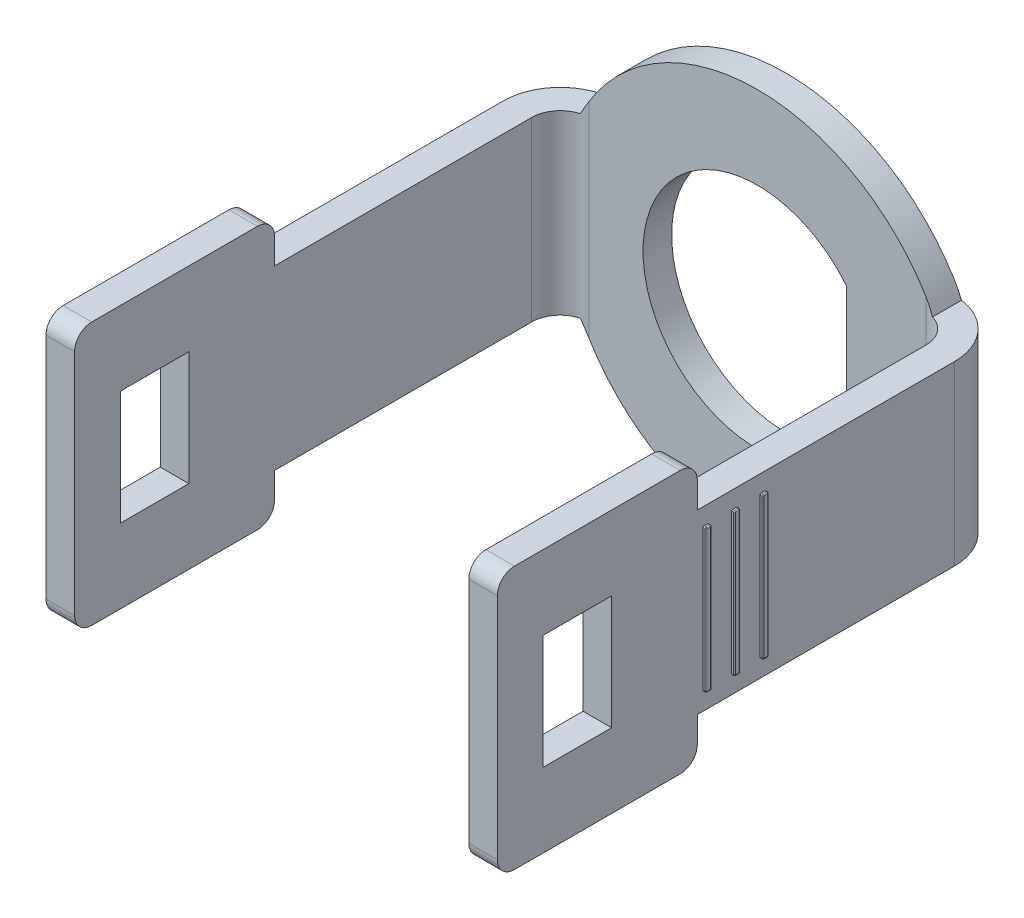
ISO-10303-21;
HEADER;
FILE_DESCRIPTION(('STEP AP214'),'2;1');
FILE_NAME('part.step','',(''),(''),'','','');
FILE_SCHEMA(('AUTOMOTIVE_DESIGN { 1 0 10303 214 1 1 1 1 }'));
ENDSEC;
DATA;
#1=APPLICATION_CONTEXT('core data for automotive mechanical design processes');
#2=APPLICATION_PROTOCOL_DEFINITION('international standard','automotive_design',2000,#1);
#3=PRODUCT_CONTEXT('',#1,'mechanical');
#4=PRODUCT('Part','Part','',(#3));
#5=PRODUCT_RELATED_PRODUCT_CATEGORY('part','',(#4));
#6=PRODUCT_DEFINITION_FORMATION('','',#4);
#7=PRODUCT_DEFINITION_CONTEXT('part definition',#1,'design');
#8=PRODUCT_DEFINITION('design','',#6,#7);
#9=PRODUCT_DEFINITION_SHAPE('','',#8);
#10=(LENGTH_UNIT() NAMED_UNIT(*) SI_UNIT(.MILLI.,.METRE.));
#11=(NAMED_UNIT(*) PLANE_ANGLE_UNIT() SI_UNIT($,.RADIAN.));
#12=(NAMED_UNIT(*) SI_UNIT($,.STERADIAN.) SOLID_ANGLE_UNIT());
#13=UNCERTAINTY_MEASURE_WITH_UNIT(LENGTH_MEASURE(1.E-05),#10,'distance_accuracy_value','');
#14=(GEOMETRIC_REPRESENTATION_CONTEXT(3) GLOBAL_UNCERTAINTY_ASSIGNED_CONTEXT((#13)) GLOBAL_UNIT_ASSIGNED_CONTEXT((#10,
#11,#12)) REPRESENTATION_CONTEXT('',''));
#15=CARTESIAN_POINT('',(0.,0.,0.));
#16=DIRECTION('',(0.,0.,1.));
#17=DIRECTION('',(1.,0.,0.));
#18=AXIS2_PLACEMENT_3D('',#15,#16,#17);
#19=CARTESIAN_POINT('',(0.,0.,1.27));
#20=DIRECTION('',(1.,0.,0.));
#21=DIRECTION('',(0.,1.,0.));
#22=AXIS2_PLACEMENT_3D('',#19,#20,#21);
#23=PLANE('',#22);
#24=DIRECTION('',(0.,-1.,0.));
#25=VECTOR('',#24,1.);
#26=CARTESIAN_POINT('',(0.,-0.762,12.192));
#27=LINE('',#26,#25);
#28=CARTESIAN_POINT('',(0.,-0.8128,12.192));
#29=VERTEX_POINT('',#28);
#30=CARTESIAN_POINT('',(0.,-7.0612,12.192));
#31=VERTEX_POINT('',#30);
#32=EDGE_CURVE('E1455',#29,#31,#27,.T.);
#33=ORIENTED_EDGE('',*,*,#32,.F.);
#34=CARTESIAN_POINT('',(0.,-0.8128,12.2428));
#35=DIRECTION('',(1.,0.,0.));
#36=DIRECTION('',(0.,1.,0.));
#37=AXIS2_PLACEMENT_3D('',#34,#35,#36);
#38=CIRCLE('',#37,0.0508);
#39=CARTESIAN_POINT('',(0.,-0.762,12.2428));
#40=VERTEX_POINT('',#39);
#41=EDGE_CURVE('E1684',#29,#40,#38,.T.);
#42=ORIENTED_EDGE('',*,*,#41,.T.);
#43=DIRECTION('',(0.,0.,-1.));
#44=VECTOR('',#43,1.);
#45=CARTESIAN_POINT('',(0.,-0.762,12.192));
#46=LINE('',#45,#44);
#47=CARTESIAN_POINT('',(0.,-0.762,12.3952));
#48=VERTEX_POINT('',#47);
#49=EDGE_CURVE('E2021',#48,#40,#46,.T.);
#50=ORIENTED_EDGE('',*,*,#49,.F.);
#51=CARTESIAN_POINT('',(0.,-0.8128,12.3952));
#52=DIRECTION('',(1.,0.,0.));
#53=DIRECTION('',(0.,1.,0.));
#54=AXIS2_PLACEMENT_3D('',#51,#52,#53);
#55=CIRCLE('',#54,0.0508);
#56=CARTESIAN_POINT('',(0.,-0.8128,12.446));
#57=VERTEX_POINT('',#56);
#58=EDGE_CURVE('E1682',#48,#57,#55,.T.);
#59=ORIENTED_EDGE('',*,*,#58,.T.);
#60=DIRECTION('',(0.,1.,0.));
#61=VECTOR('',#60,1.);
#62=CARTESIAN_POINT('',(0.,-0.762,12.446));
#63=LINE('',#62,#61);
#64=CARTESIAN_POINT('',(0.,-7.0612,12.446));
#65=VERTEX_POINT('',#64);
#66=EDGE_CURVE('E2018',#65,#57,#63,.T.);
#67=ORIENTED_EDGE('',*,*,#66,.F.);
#68=CARTESIAN_POINT('',(0.,-7.0612,12.3952));
#69=DIRECTION('',(1.,0.,0.));
#70=DIRECTION('',(0.,1.,0.));
#71=AXIS2_PLACEMENT_3D('',#68,#69,#70);
#72=CIRCLE('',#71,0.0508);
#73=CARTESIAN_POINT('',(0.,-7.112,12.3952));
#74=VERTEX_POINT('',#73);
#75=EDGE_CURVE('E1694',#65,#74,#72,.T.);
#76=ORIENTED_EDGE('',*,*,#75,.T.);
#77=DIRECTION('',(0.,0.,1.));
#78=VECTOR('',#77,1.);
#79=CARTESIAN_POINT('',(0.,-7.112,12.192));
#80=LINE('',#79,#78);
#81=CARTESIAN_POINT('',(0.,-7.112,12.2428));
#82=VERTEX_POINT('',#81);
#83=EDGE_CURVE('E2015',#82,#74,#80,.T.);
#84=ORIENTED_EDGE('',*,*,#83,.F.);
#85=CARTESIAN_POINT('',(0.,-7.0612,12.2428));
#86=DIRECTION('',(1.,0.,0.));
#87=DIRECTION('',(0.,1.,0.));
#88=AXIS2_PLACEMENT_3D('',#85,#86,#87);
#89=CIRCLE('',#88,0.0508);
#90=EDGE_CURVE('E1696',#82,#31,#89,.T.);
#91=ORIENTED_EDGE('',*,*,#90,.T.);
#92=EDGE_LOOP('',(#33,#42,#50,#59,#67,#76,#84,#91));
#93=FACE_BOUND('',#92,.T.);
#94=DIRECTION('',(0.,-1.,0.));
#95=VECTOR('',#94,1.);
#96=CARTESIAN_POINT('',(0.,1.905,13.97));
#97=LINE('',#96,#95);
#98=CARTESIAN_POINT('',(0.,-7.874,13.97));
#99=VERTEX_POINT('',#98);
#100=CARTESIAN_POINT('',(0.,-9.017,13.97));
#101=VERTEX_POINT('',#100);
#102=EDGE_CURVE('E721',#99,#101,#97,.T.);
#103=ORIENTED_EDGE('',*,*,#102,.T.);
#104=CARTESIAN_POINT('',(0.,-9.017,14.732));
#105=DIRECTION('',(1.,0.,0.));
#106=DIRECTION('',(0.,1.,0.));
#107=AXIS2_PLACEMENT_3D('',#104,#105,#106);
#108=CIRCLE('',#107,0.762);
#109=CARTESIAN_POINT('',(0.,-9.779,14.732));
#110=VERTEX_POINT('',#109);
#111=EDGE_CURVE('E743',#101,#110,#108,.F.);
#112=ORIENTED_EDGE('',*,*,#111,.T.);
#113=DIRECTION('',(0.,0.,-1.));
#114=VECTOR('',#113,1.);
#115=CARTESIAN_POINT('',(0.,-9.779,22.86));
#116=LINE('',#115,#114);
#117=CARTESIAN_POINT('',(0.,-9.779,22.098));
#118=VERTEX_POINT('',#117);
#119=EDGE_CURVE('E3177',#118,#110,#116,.T.);
#120=ORIENTED_EDGE('',*,*,#119,.F.);
#121=CARTESIAN_POINT('',(0.,-9.017,22.098));
#122=DIRECTION('',(1.,0.,0.));
#123=DIRECTION('',(0.,1.,0.));
#124=AXIS2_PLACEMENT_3D('',#121,#122,#123);
#125=CIRCLE('',#124,0.762);
#126=CARTESIAN_POINT('',(0.,-9.017,22.86));
#127=VERTEX_POINT('',#126);
#128=EDGE_CURVE('E741',#118,#127,#125,.F.);
#129=ORIENTED_EDGE('',*,*,#128,.T.);
#130=DIRECTION('',(0.,-1.,0.));
#131=VECTOR('',#130,1.);
#132=CARTESIAN_POINT('',(0.,1.905,22.86));
#133=LINE('',#132,#131);
#134=CARTESIAN_POINT('',(0.,1.143,22.86));
#135=VERTEX_POINT('',#134);
#136=EDGE_CURVE('E1482',#135,#127,#133,.T.);
#137=ORIENTED_EDGE('',*,*,#136,.F.);
#138=CARTESIAN_POINT('',(0.,1.143,22.098));
#139=DIRECTION('',(1.,0.,0.));
#140=DIRECTION('',(0.,1.,0.));
#141=AXIS2_PLACEMENT_3D('',#138,#139,#140);
#142=CIRCLE('',#141,0.762);
#143=CARTESIAN_POINT('',(0.,1.905,22.098));
#144=VERTEX_POINT('',#143);
#145=EDGE_CURVE('E737',#135,#144,#142,.F.);
#146=ORIENTED_EDGE('',*,*,#145,.T.);
#147=DIRECTION('',(0.,0.,-1.));
#148=VECTOR('',#147,1.);
#149=CARTESIAN_POINT('',(0.,1.905,22.86));
#150=LINE('',#149,#148);
#151=CARTESIAN_POINT('',(0.,1.905,14.732));
#152=VERTEX_POINT('',#151);
#153=EDGE_CURVE('E3162',#144,#152,#150,.T.);
#154=ORIENTED_EDGE('',*,*,#153,.T.);
#155=CARTESIAN_POINT('',(0.,1.143,14.732));
#156=DIRECTION('',(1.,0.,0.));
#157=DIRECTION('',(0.,1.,0.));
#158=AXIS2_PLACEMENT_3D('',#155,#156,#157);
#159=CIRCLE('',#158,0.762);
#160=CARTESIAN_POINT('',(0.,1.143,13.97));
#161=VERTEX_POINT('',#160);
#162=EDGE_CURVE('E739',#152,#161,#159,.F.);
#163=ORIENTED_EDGE('',*,*,#162,.T.);
#164=CARTESIAN_POINT('',(0.,0.,13.97));
#165=VERTEX_POINT('',#164);
#166=EDGE_CURVE('E731',#161,#165,#97,.T.);
#167=ORIENTED_EDGE('',*,*,#166,.T.);
#168=DIRECTION('',(0.,0.,-1.));
#169=VECTOR('',#168,1.);
#170=CARTESIAN_POINT('',(0.,0.,1.27));
#171=LINE('',#170,#169);
#172=CARTESIAN_POINT('',(0.,0.,2.54));
#173=VERTEX_POINT('',#172);
#174=EDGE_CURVE('E794',#165,#173,#171,.T.);
#175=ORIENTED_EDGE('',*,*,#174,.T.);
#176=DIRECTION('',(0.,-1.,0.));
#177=VECTOR('',#176,1.);
#178=CARTESIAN_POINT('',(0.,0.,2.54));
#179=LINE('',#178,#177);
#180=CARTESIAN_POINT('',(0.,-7.874,2.54));
#181=VERTEX_POINT('',#180);
#182=EDGE_CURVE('E848',#173,#181,#179,.T.);
#183=ORIENTED_EDGE('',*,*,#182,.T.);
#184=DIRECTION('',(0.,0.,-1.));
#185=VECTOR('',#184,1.);
#186=CARTESIAN_POINT('',(0.,-7.874,1.27));
#187=LINE('',#186,#185);
#188=EDGE_CURVE('E852',#99,#181,#187,.T.);
#189=ORIENTED_EDGE('',*,*,#188,.F.);
#190=EDGE_LOOP('',(#103,#112,#120,#129,#137,#146,#154,#163,#167,#175,#183,#189));
#191=FACE_BOUND('',#190,.T.);
#192=DIRECTION('',(0.,0.,1.));
#193=VECTOR('',#192,1.);
#194=CARTESIAN_POINT('',(0.,-6.477,17.78));
#195=LINE('',#194,#193);
#196=CARTESIAN_POINT('',(0.,-6.477,17.78));
#197=VERTEX_POINT('',#196);
#198=CARTESIAN_POINT('',(0.,-6.477,20.828));
#199=VERTEX_POINT('',#198);
#200=EDGE_CURVE('E678',#197,#199,#195,.T.);
#201=ORIENTED_EDGE('',*,*,#200,.F.);
#202=DIRECTION('',(0.,-1.,0.));
#203=VECTOR('',#202,1.);
#204=CARTESIAN_POINT('',(0.,-1.397,17.78));
#205=LINE('',#204,#203);
#206=CARTESIAN_POINT('',(0.,-1.397,17.78));
#207=VERTEX_POINT('',#206);
#208=EDGE_CURVE('E684',#207,#197,#205,.T.);
#209=ORIENTED_EDGE('',*,*,#208,.F.);
#210=DIRECTION('',(0.,0.,-1.));
#211=VECTOR('',#210,1.);
#212=CARTESIAN_POINT('',(0.,-1.397,17.78));
#213=LINE('',#212,#211);
#214=CARTESIAN_POINT('',(0.,-1.397,20.828));
#215=VERTEX_POINT('',#214);
#216=EDGE_CURVE('E688',#215,#207,#213,.T.);
#217=ORIENTED_EDGE('',*,*,#216,.F.);
#218=DIRECTION('',(0.,1.,0.));
#219=VECTOR('',#218,1.);
#220=CARTESIAN_POINT('',(0.,-1.397,20.828));
#221=LINE('',#220,#219);
#222=EDGE_CURVE('E667',#199,#215,#221,.T.);
#223=ORIENTED_EDGE('',*,*,#222,.F.);
#224=EDGE_LOOP('',(#201,#209,#217,#223));
#225=FACE_BOUND('',#224,.T.);
#226=DIRECTION('',(0.,-1.,0.));
#227=VECTOR('',#226,1.);
#228=CARTESIAN_POINT('',(0.,-0.762,13.462));
#229=LINE('',#228,#227);
#230=CARTESIAN_POINT('',(0.,-0.8128,13.462));
#231=VERTEX_POINT('',#230);
#232=CARTESIAN_POINT('',(0.,-7.0612,13.462));
#233=VERTEX_POINT('',#232);
#234=EDGE_CURVE('E2024',#231,#233,#229,.T.);
#235=ORIENTED_EDGE('',*,*,#234,.F.);
#236=CARTESIAN_POINT('',(0.,-0.8128,13.5128));
#237=DIRECTION('',(1.,0.,0.));
#238=DIRECTION('',(0.,1.,0.));
#239=AXIS2_PLACEMENT_3D('',#236,#237,#238);
#240=CIRCLE('',#239,0.0508);
#241=CARTESIAN_POINT('',(0.,-0.762,13.5128));
#242=VERTEX_POINT('',#241);
#243=EDGE_CURVE('E1680',#231,#242,#240,.T.);
#244=ORIENTED_EDGE('',*,*,#243,.T.);
#245=DIRECTION('',(0.,0.,-1.));
#246=VECTOR('',#245,1.);
#247=CARTESIAN_POINT('',(0.,-0.762,13.462));
#248=LINE('',#247,#246);
#249=CARTESIAN_POINT('',(0.,-0.762,13.6652));
#250=VERTEX_POINT('',#249);
#251=EDGE_CURVE('E2033',#250,#242,#248,.T.);
#252=ORIENTED_EDGE('',*,*,#251,.F.);
#253=CARTESIAN_POINT('',(0.,-0.8128,13.6652));
#254=DIRECTION('',(1.,0.,0.));
#255=DIRECTION('',(0.,1.,0.));
#256=AXIS2_PLACEMENT_3D('',#253,#254,#255);
#257=CIRCLE('',#256,0.0508);
#258=CARTESIAN_POINT('',(0.,-0.8128,13.716));
#259=VERTEX_POINT('',#258);
#260=EDGE_CURVE('E1678',#250,#259,#257,.T.);
#261=ORIENTED_EDGE('',*,*,#260,.T.);
#262=DIRECTION('',(0.,1.,0.));
#263=VECTOR('',#262,1.);
#264=CARTESIAN_POINT('',(0.,-0.762,13.716));
#265=LINE('',#264,#263);
#266=CARTESIAN_POINT('',(0.,-7.0612,13.716));
#267=VERTEX_POINT('',#266);
#268=EDGE_CURVE('E2030',#267,#259,#265,.T.);
#269=ORIENTED_EDGE('',*,*,#268,.F.);
#270=CARTESIAN_POINT('',(0.,-7.0612,13.6652));
#271=DIRECTION('',(1.,0.,0.));
#272=DIRECTION('',(0.,1.,0.));
#273=AXIS2_PLACEMENT_3D('',#270,#271,#272);
#274=CIRCLE('',#273,0.0508);
#275=CARTESIAN_POINT('',(0.,-7.112,13.6652));
#276=VERTEX_POINT('',#275);
#277=EDGE_CURVE('E1690',#267,#276,#274,.T.);
#278=ORIENTED_EDGE('',*,*,#277,.T.);
#279=DIRECTION('',(0.,0.,1.));
#280=VECTOR('',#279,1.);
#281=CARTESIAN_POINT('',(0.,-7.112,13.462));
#282=LINE('',#281,#280);
#283=CARTESIAN_POINT('',(0.,-7.112,13.5128));
#284=VERTEX_POINT('',#283);
#285=EDGE_CURVE('E2027',#284,#276,#282,.T.);
#286=ORIENTED_EDGE('',*,*,#285,.F.);
#287=CARTESIAN_POINT('',(0.,-7.0612,13.5128));
#288=DIRECTION('',(1.,0.,0.));
#289=DIRECTION('',(0.,1.,0.));
#290=AXIS2_PLACEMENT_3D('',#287,#288,#289);
#291=CIRCLE('',#290,0.0508);
#292=EDGE_CURVE('E1692',#284,#233,#291,.T.);
#293=ORIENTED_EDGE('',*,*,#292,.T.);
#294=EDGE_LOOP('',(#235,#244,#252,#261,#269,#278,#286,#293));
#295=FACE_BOUND('',#294,.T.);
#296=DIRECTION('',(0.,-1.,0.));
#297=VECTOR('',#296,1.);
#298=CARTESIAN_POINT('',(0.,-0.762,10.922));
#299=LINE('',#298,#297);
#300=CARTESIAN_POINT('',(0.,-0.8128,10.922));
#301=VERTEX_POINT('',#300);
#302=CARTESIAN_POINT('',(0.,-7.0612,10.922));
#303=VERTEX_POINT('',#302);
#304=EDGE_CURVE('E2002',#301,#303,#299,.T.);
#305=ORIENTED_EDGE('',*,*,#304,.F.);
#306=CARTESIAN_POINT('',(0.,-0.8128,10.9728));
#307=DIRECTION('',(1.,0.,0.));
#308=DIRECTION('',(0.,1.,0.));
#309=AXIS2_PLACEMENT_3D('',#306,#307,#308);
#310=CIRCLE('',#309,0.0508);
#311=CARTESIAN_POINT('',(0.,-0.762,10.9728));
#312=VERTEX_POINT('',#311);
#313=EDGE_CURVE('E1688',#301,#312,#310,.T.);
#314=ORIENTED_EDGE('',*,*,#313,.T.);
#315=DIRECTION('',(0.,0.,-1.));
#316=VECTOR('',#315,1.);
#317=CARTESIAN_POINT('',(0.,-0.762,10.922));
#318=LINE('',#317,#316);
#319=CARTESIAN_POINT('',(0.,-0.762,11.1252));
#320=VERTEX_POINT('',#319);
#321=EDGE_CURVE('E2011',#320,#312,#318,.T.);
#322=ORIENTED_EDGE('',*,*,#321,.F.);
#323=CARTESIAN_POINT('',(0.,-0.8128,11.1252));
#324=DIRECTION('',(1.,0.,0.));
#325=DIRECTION('',(0.,1.,0.));
#326=AXIS2_PLACEMENT_3D('',#323,#324,#325);
#327=CIRCLE('',#326,0.0508);
#328=CARTESIAN_POINT('',(0.,-0.8128,11.176));
#329=VERTEX_POINT('',#328);
#330=EDGE_CURVE('E1686',#320,#329,#327,.T.);
#331=ORIENTED_EDGE('',*,*,#330,.T.);
#332=DIRECTION('',(0.,1.,0.));
#333=VECTOR('',#332,1.);
#334=CARTESIAN_POINT('',(0.,-0.762,11.176));
#335=LINE('',#334,#333);
#336=CARTESIAN_POINT('',(0.,-7.0612,11.176));
#337=VERTEX_POINT('',#336);
#338=EDGE_CURVE('E2008',#337,#329,#335,.T.);
#339=ORIENTED_EDGE('',*,*,#338,.F.);
#340=CARTESIAN_POINT('',(0.,-7.0612,11.1252));
#341=DIRECTION('',(1.,0.,0.));
#342=DIRECTION('',(0.,1.,0.));
#343=AXIS2_PLACEMENT_3D('',#340,#341,#342);
#344=CIRCLE('',#343,0.0508);
#345=CARTESIAN_POINT('',(0.,-7.112,11.1252));
#346=VERTEX_POINT('',#345);
#347=EDGE_CURVE('E1698',#337,#346,#344,.T.);
#348=ORIENTED_EDGE('',*,*,#347,.T.);
#349=DIRECTION('',(0.,0.,1.));
#350=VECTOR('',#349,1.);
#351=CARTESIAN_POINT('',(0.,-7.112,10.922));
#352=LINE('',#351,#350);
#353=CARTESIAN_POINT('',(0.,-7.112,10.9728));
#354=VERTEX_POINT('',#353);
#355=EDGE_CURVE('E2005',#354,#346,#352,.T.);
#356=ORIENTED_EDGE('',*,*,#355,.F.);
#357=CARTESIAN_POINT('',(0.,-7.0612,10.9728));
#358=DIRECTION('',(1.,0.,0.));
#359=DIRECTION('',(0.,1.,0.));
#360=AXIS2_PLACEMENT_3D('',#357,#358,#359);
#361=CIRCLE('',#360,0.0508);
#362=EDGE_CURVE('E1700',#354,#303,#361,.T.);
#363=ORIENTED_EDGE('',*,*,#362,.T.);
#364=EDGE_LOOP('',(#305,#314,#322,#331,#339,#348,#356,#363));
#365=FACE_BOUND('',#364,.T.);
#366=ADVANCED_FACE('F35',(#93,#191,#225,#295,#365),#23,.F.);
#367=CARTESIAN_POINT('',(0.,-7.874,1.27));
#368=DIRECTION('',(0.,0.,1.));
#369=DIRECTION('',(1.,0.,0.));
#370=AXIS2_PLACEMENT_3D('',#367,#368,#369);
#371=PLANE('',#370);
#372=CARTESIAN_POINT('',(10.033,-3.937,1.27));
#373=DIRECTION('',(0.,0.,1.));
#374=DIRECTION('',(1.,0.,0.));
#375=AXIS2_PLACEMENT_3D('',#372,#373,#374);
#376=CIRCLE('',#375,5.08);
#377=CARTESIAN_POINT('',(13.998573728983,-0.762,1.27));
#378=VERTEX_POINT('',#377);
#379=CARTESIAN_POINT('',(13.998573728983,-7.112,1.27));
#380=VERTEX_POINT('',#379);
#381=EDGE_CURVE('E819',#378,#380,#376,.T.);
#382=ORIENTED_EDGE('',*,*,#381,.F.);
#383=DIRECTION('',(0.,1.,0.));
#384=VECTOR('',#383,1.);
#385=CARTESIAN_POINT('',(13.998573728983,-7.874,1.27));
#386=LINE('',#385,#384);
#387=EDGE_CURVE('E815',#380,#378,#386,.T.);
#388=ORIENTED_EDGE('',*,*,#387,.F.);
#389=EDGE_LOOP('',(#382,#388));
#390=FACE_BOUND('',#389,.T.);
#391=CARTESIAN_POINT('',(10.033,-3.937,1.27));
#392=DIRECTION('',(0.,0.,-1.));
#393=DIRECTION('',(-1.,0.,0.));
#394=AXIS2_PLACEMENT_3D('',#391,#392,#393);
#395=CIRCLE('',#394,8.763);
#396=CARTESIAN_POINT('',(17.526,-8.48069013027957,1.27));
#397=VERTEX_POINT('',#396);
#398=CARTESIAN_POINT('',(2.54,-8.48069013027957,1.27));
#399=VERTEX_POINT('',#398);
#400=EDGE_CURVE('E826',#397,#399,#395,.T.);
#401=ORIENTED_EDGE('',*,*,#400,.F.);
#402=DIRECTION('',(0.,-1.,0.));
#403=VECTOR('',#402,1.);
#404=CARTESIAN_POINT('',(17.526,-7.874,1.27));
#405=LINE('',#404,#403);
#406=CARTESIAN_POINT('',(17.526,0.606690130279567,1.27));
#407=VERTEX_POINT('',#406);
#408=EDGE_CURVE('E910',#397,#407,#405,.F.);
#409=ORIENTED_EDGE('',*,*,#408,.T.);
#410=CARTESIAN_POINT('',(2.54,0.606690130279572,1.27));
#411=VERTEX_POINT('',#410);
#412=EDGE_CURVE('E829',#411,#407,#395,.T.);
#413=ORIENTED_EDGE('',*,*,#412,.F.);
#414=DIRECTION('',(0.,1.,0.));
#415=VECTOR('',#414,1.);
#416=CARTESIAN_POINT('',(2.54,-7.874,1.27));
#417=LINE('',#416,#415);
#418=EDGE_CURVE('E908',#411,#399,#417,.F.);
#419=ORIENTED_EDGE('',*,*,#418,.T.);
#420=EDGE_LOOP('',(#401,#409,#413,#419));
#421=FACE_BOUND('',#420,.T.);
#422=ADVANCED_FACE('F1444',(#390,#421),#371,.T.);
#423=CARTESIAN_POINT('',(0.,-7.874,1.27));
#424=DIRECTION('',(0.,1.,0.));
#425=DIRECTION('',(0.,0.,1.));
#426=AXIS2_PLACEMENT_3D('',#423,#424,#425);
#427=PLANE('',#426);
#428=DIRECTION('',(0.,0.,-1.));
#429=VECTOR('',#428,1.);
#430=CARTESIAN_POINT('',(17.8618057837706,-7.874,1.27));
#431=LINE('',#430,#429);
#432=CARTESIAN_POINT('',(17.8618057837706,-7.874,1.31520023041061));
#433=VERTEX_POINT('',#432);
#434=CARTESIAN_POINT('',(17.8618057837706,-7.874,0.0222957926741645));
#435=VERTEX_POINT('',#434);
#436=EDGE_CURVE('E837',#433,#435,#431,.T.);
#437=ORIENTED_EDGE('',*,*,#436,.T.);
#438=CARTESIAN_POINT('',(17.526,-7.874,2.54));
#439=DIRECTION('',(0.,1.,0.));
#440=DIRECTION('',(0.,0.,1.));
#441=AXIS2_PLACEMENT_3D('',#438,#439,#440);
#442=CIRCLE('',#441,2.54);
#443=CARTESIAN_POINT('',(20.066,-7.874,2.54));
#444=VERTEX_POINT('',#443);
#445=EDGE_CURVE('E903',#435,#444,#442,.F.);
#446=ORIENTED_EDGE('',*,*,#445,.T.);
#447=DIRECTION('',(0.,0.,-1.));
#448=VECTOR('',#447,1.);
#449=CARTESIAN_POINT('',(20.066,-7.874,1.27));
#450=LINE('',#449,#448);
#451=CARTESIAN_POINT('',(20.066,-7.874,13.97));
#452=VERTEX_POINT('',#451);
#453=EDGE_CURVE('E793',#452,#444,#450,.T.);
#454=ORIENTED_EDGE('',*,*,#453,.F.);
#455=DIRECTION('',(1.,0.,0.));
#456=VECTOR('',#455,1.);
#457=CARTESIAN_POINT('',(20.066,-7.874,13.97));
#458=LINE('',#457,#456);
#459=CARTESIAN_POINT('',(18.796,-7.874,13.97));
#460=VERTEX_POINT('',#459);
#461=EDGE_CURVE('E779',#460,#452,#458,.T.);
#462=ORIENTED_EDGE('',*,*,#461,.F.);
#463=DIRECTION('',(0.,0.,-1.));
#464=VECTOR('',#463,1.);
#465=CARTESIAN_POINT('',(18.796,-7.874,13.97));
#466=LINE('',#465,#464);
#467=CARTESIAN_POINT('',(18.796,-7.874,2.54));
#468=VERTEX_POINT('',#467);
#469=EDGE_CURVE('E787',#460,#468,#466,.T.);
#470=ORIENTED_EDGE('',*,*,#469,.T.);
#471=CARTESIAN_POINT('',(17.526,-7.874,2.54));
#472=DIRECTION('',(0.,1.,0.));
#473=DIRECTION('',(0.,0.,1.));
#474=AXIS2_PLACEMENT_3D('',#471,#472,#473);
#475=CIRCLE('',#474,1.27);
#476=EDGE_CURVE('E915',#468,#433,#475,.T.);
#477=ORIENTED_EDGE('',*,*,#476,.T.);
#478=EDGE_LOOP('',(#437,#446,#454,#462,#470,#477));
#479=FACE_BOUND('',#478,.T.);
#480=ADVANCED_FACE('F1449',(#479),#427,.F.);
#481=CARTESIAN_POINT('',(0.,0.,1.27));
#482=DIRECTION('',(0.,-1.,0.));
#483=DIRECTION('',(0.,0.,-1.));
#484=AXIS2_PLACEMENT_3D('',#481,#482,#483);
#485=PLANE('',#484);
#486=DIRECTION('',(0.,0.,-1.));
#487=VECTOR('',#486,1.);
#488=CARTESIAN_POINT('',(2.2041942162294,0.,1.27));
#489=LINE('',#488,#487);
#490=CARTESIAN_POINT('',(2.2041942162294,0.,1.31520023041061));
#491=VERTEX_POINT('',#490);
#492=CARTESIAN_POINT('',(2.2041942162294,0.,0.0222957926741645));
#493=VERTEX_POINT('',#492);
#494=EDGE_CURVE('E832',#491,#493,#489,.T.);
#495=ORIENTED_EDGE('',*,*,#494,.T.);
#496=CARTESIAN_POINT('',(2.54,0.,2.54));
#497=DIRECTION('',(0.,-1.,0.));
#498=DIRECTION('',(0.,0.,-1.));
#499=AXIS2_PLACEMENT_3D('',#496,#497,#498);
#500=CIRCLE('',#499,2.54);
#501=EDGE_CURVE('E896',#493,#173,#500,.F.);
#502=ORIENTED_EDGE('',*,*,#501,.T.);
#503=ORIENTED_EDGE('',*,*,#174,.F.);
#504=DIRECTION('',(-1.,0.,0.));
#505=VECTOR('',#504,1.);
#506=CARTESIAN_POINT('',(0.,0.,13.97));
#507=LINE('',#506,#505);
#508=CARTESIAN_POINT('',(1.27,0.,13.97));
#509=VERTEX_POINT('',#508);
#510=EDGE_CURVE('E797',#509,#165,#507,.T.);
#511=ORIENTED_EDGE('',*,*,#510,.F.);
#512=DIRECTION('',(0.,0.,-1.));
#513=VECTOR('',#512,1.);
#514=CARTESIAN_POINT('',(1.27,0.,13.97));
#515=LINE('',#514,#513);
#516=CARTESIAN_POINT('',(1.27,0.,2.54));
#517=VERTEX_POINT('',#516);
#518=EDGE_CURVE('E801',#509,#517,#515,.T.);
#519=ORIENTED_EDGE('',*,*,#518,.T.);
#520=CARTESIAN_POINT('',(2.54,0.,2.54));
#521=DIRECTION('',(0.,-1.,0.));
#522=DIRECTION('',(0.,0.,-1.));
#523=AXIS2_PLACEMENT_3D('',#520,#521,#522);
#524=CIRCLE('',#523,1.27);
#525=EDGE_CURVE('E931',#517,#491,#524,.T.);
#526=ORIENTED_EDGE('',*,*,#525,.T.);
#527=EDGE_LOOP('',(#495,#502,#503,#511,#519,#526));
#528=FACE_BOUND('',#527,.T.);
#529=ADVANCED_FACE('F1546',(#528),#485,.F.);
#530=ORIENTED_EDGE('',*,*,#188,.T.);
#531=CARTESIAN_POINT('',(2.54,-7.874,2.54));
#532=DIRECTION('',(0.,1.,0.));
#533=DIRECTION('',(0.,0.,1.));
#534=AXIS2_PLACEMENT_3D('',#531,#532,#533);
#535=CIRCLE('',#534,2.54);
#536=CARTESIAN_POINT('',(2.2041942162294,-7.874,0.0222957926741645));
#537=VERTEX_POINT('',#536);
#538=EDGE_CURVE('E851',#181,#537,#535,.F.);
#539=ORIENTED_EDGE('',*,*,#538,.T.);
#540=DIRECTION('',(0.,0.,-1.));
#541=VECTOR('',#540,1.);
#542=CARTESIAN_POINT('',(2.2041942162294,-7.874,1.27));
#543=LINE('',#542,#541);
#544=CARTESIAN_POINT('',(2.2041942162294,-7.874,1.31520023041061));
#545=VERTEX_POINT('',#544);
#546=EDGE_CURVE('E835',#537,#545,#543,.F.);
#547=ORIENTED_EDGE('',*,*,#546,.T.);
#548=CARTESIAN_POINT('',(2.54,-7.874,2.54));
#549=DIRECTION('',(0.,1.,0.));
#550=DIRECTION('',(0.,0.,1.));
#551=AXIS2_PLACEMENT_3D('',#548,#549,#550);
#552=CIRCLE('',#551,1.27);
#553=CARTESIAN_POINT('',(1.27,-7.874,2.54));
#554=VERTEX_POINT('',#553);
#555=EDGE_CURVE('E1477',#545,#554,#552,.T.);
#556=ORIENTED_EDGE('',*,*,#555,.T.);
#557=DIRECTION('',(0.,0.,-1.));
#558=VECTOR('',#557,1.);
#559=CARTESIAN_POINT('',(1.27,-7.874,13.97));
#560=LINE('',#559,#558);
#561=CARTESIAN_POINT('',(1.27,-7.874,13.97));
#562=VERTEX_POINT('',#561);
#563=EDGE_CURVE('E809',#562,#554,#560,.T.);
#564=ORIENTED_EDGE('',*,*,#563,.F.);
#565=DIRECTION('',(1.,0.,0.));
#566=VECTOR('',#565,1.);
#567=CARTESIAN_POINT('',(0.,-7.874,13.97));
#568=LINE('',#567,#566);
#569=EDGE_CURVE('E786',#99,#562,#568,.T.);
#570=ORIENTED_EDGE('',*,*,#569,.F.);
#571=EDGE_LOOP('',(#530,#539,#547,#556,#564,#570));
#572=FACE_BOUND('',#571,.T.);
#573=ADVANCED_FACE('F1492',(#572),#427,.F.);
#574=CARTESIAN_POINT('',(20.066,0.,1.27));
#575=DIRECTION('',(-1.,0.,0.));
#576=DIRECTION('',(0.,0.,1.));
#577=AXIS2_PLACEMENT_3D('',#574,#575,#576);
#578=PLANE('',#577);
#579=DIRECTION('',(0.,1.,0.));
#580=VECTOR('',#579,1.);
#581=CARTESIAN_POINT('',(20.066,-0.762000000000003,11.176));
#582=LINE('',#581,#580);
#583=CARTESIAN_POINT('',(20.066,-7.0612,11.176));
#584=VERTEX_POINT('',#583);
#585=CARTESIAN_POINT('',(20.066,-0.812800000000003,11.176));
#586=VERTEX_POINT('',#585);
#587=EDGE_CURVE('E1828',#584,#586,#582,.T.);
#588=ORIENTED_EDGE('',*,*,#587,.T.);
#589=CARTESIAN_POINT('',(20.066,-0.812800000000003,11.1252));
#590=DIRECTION('',(-1.,0.,0.));
#591=DIRECTION('',(0.,0.,1.));
#592=AXIS2_PLACEMENT_3D('',#589,#590,#591);
#593=CIRCLE('',#592,0.0508);
#594=CARTESIAN_POINT('',(20.066,-0.762000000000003,11.1252));
#595=VERTEX_POINT('',#594);
#596=EDGE_CURVE('E1810',#586,#595,#593,.T.);
#597=ORIENTED_EDGE('',*,*,#596,.T.);
#598=DIRECTION('',(0.,0.,-1.));
#599=VECTOR('',#598,1.);
#600=CARTESIAN_POINT('',(20.066,-0.762000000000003,10.922));
#601=LINE('',#600,#599);
#602=CARTESIAN_POINT('',(20.066,-0.762000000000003,10.9728));
#603=VERTEX_POINT('',#602);
#604=EDGE_CURVE('E1835',#595,#603,#601,.T.);
#605=ORIENTED_EDGE('',*,*,#604,.T.);
#606=CARTESIAN_POINT('',(20.066,-0.812800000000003,10.9728));
#607=DIRECTION('',(-1.,0.,0.));
#608=DIRECTION('',(0.,0.,1.));
#609=AXIS2_PLACEMENT_3D('',#606,#607,#608);
#610=CIRCLE('',#609,0.0508);
#611=CARTESIAN_POINT('',(20.066,-0.812800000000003,10.922));
#612=VERTEX_POINT('',#611);
#613=EDGE_CURVE('E1812',#603,#612,#610,.T.);
#614=ORIENTED_EDGE('',*,*,#613,.T.);
#615=DIRECTION('',(0.,-1.,0.));
#616=VECTOR('',#615,1.);
#617=CARTESIAN_POINT('',(20.066,-0.762000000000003,10.922));
#618=LINE('',#617,#616);
#619=CARTESIAN_POINT('',(20.066,-7.0612,10.922));
#620=VERTEX_POINT('',#619);
#621=EDGE_CURVE('E1865',#612,#620,#618,.T.);
#622=ORIENTED_EDGE('',*,*,#621,.T.);
#623=CARTESIAN_POINT('',(20.066,-7.0612,10.9728));
#624=DIRECTION('',(-1.,0.,0.));
#625=DIRECTION('',(0.,0.,1.));
#626=AXIS2_PLACEMENT_3D('',#623,#624,#625);
#627=CIRCLE('',#626,0.0508);
#628=CARTESIAN_POINT('',(20.066,-7.112,10.9728));
#629=VERTEX_POINT('',#628);
#630=EDGE_CURVE('E11',#620,#629,#627,.T.);
#631=ORIENTED_EDGE('',*,*,#630,.T.);
#632=DIRECTION('',(0.,0.,1.));
#633=VECTOR('',#632,1.);
#634=CARTESIAN_POINT('',(20.066,-7.112,10.922));
#635=LINE('',#634,#633);
#636=CARTESIAN_POINT('',(20.066,-7.112,11.1252));
#637=VERTEX_POINT('',#636);
#638=EDGE_CURVE('E1830',#629,#637,#635,.T.);
#639=ORIENTED_EDGE('',*,*,#638,.T.);
#640=CARTESIAN_POINT('',(20.066,-7.0612,11.1252));
#641=DIRECTION('',(-1.,0.,0.));
#642=DIRECTION('',(0.,0.,1.));
#643=AXIS2_PLACEMENT_3D('',#640,#641,#642);
#644=CIRCLE('',#643,0.0508);
#645=EDGE_CURVE('E42',#637,#584,#644,.T.);
#646=ORIENTED_EDGE('',*,*,#645,.T.);
#647=EDGE_LOOP('',(#588,#597,#605,#614,#622,#631,#639,#646));
#648=FACE_BOUND('',#647,.T.);
#649=DIRECTION('',(0.,1.,0.));
#650=VECTOR('',#649,1.);
#651=CARTESIAN_POINT('',(20.066,-0.762000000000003,12.446));
#652=LINE('',#651,#650);
#653=CARTESIAN_POINT('',(20.066,-7.0612,12.446));
#654=VERTEX_POINT('',#653);
#655=CARTESIAN_POINT('',(20.066,-0.812800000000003,12.446));
#656=VERTEX_POINT('',#655);
#657=EDGE_CURVE('E1879',#654,#656,#652,.T.);
#658=ORIENTED_EDGE('',*,*,#657,.T.);
#659=CARTESIAN_POINT('',(20.066,-0.812800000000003,12.3952));
#660=DIRECTION('',(-1.,0.,0.));
#661=DIRECTION('',(0.,0.,1.));
#662=AXIS2_PLACEMENT_3D('',#659,#660,#661);
#663=CIRCLE('',#662,0.0508);
#664=CARTESIAN_POINT('',(20.066,-0.762000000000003,12.3952));
#665=VERTEX_POINT('',#664);
#666=EDGE_CURVE('E1806',#656,#665,#663,.T.);
#667=ORIENTED_EDGE('',*,*,#666,.T.);
#668=DIRECTION('',(0.,0.,-1.));
#669=VECTOR('',#668,1.);
#670=CARTESIAN_POINT('',(20.066,-0.762000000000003,12.192));
#671=LINE('',#670,#669);
#672=CARTESIAN_POINT('',(20.066,-0.762000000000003,12.2428));
#673=VERTEX_POINT('',#672);
#674=EDGE_CURVE('E1876',#665,#673,#671,.T.);
#675=ORIENTED_EDGE('',*,*,#674,.T.);
#676=CARTESIAN_POINT('',(20.066,-0.812800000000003,12.2428));
#677=DIRECTION('',(-1.,0.,0.));
#678=DIRECTION('',(0.,0.,1.));
#679=AXIS2_PLACEMENT_3D('',#676,#677,#678);
#680=CIRCLE('',#679,0.0508);
#681=CARTESIAN_POINT('',(20.066,-0.812800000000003,12.192));
#682=VERTEX_POINT('',#681);
#683=EDGE_CURVE('E1808',#673,#682,#680,.T.);
#684=ORIENTED_EDGE('',*,*,#683,.T.);
#685=DIRECTION('',(0.,-1.,0.));
#686=VECTOR('',#685,1.);
#687=CARTESIAN_POINT('',(20.066,-0.762000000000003,12.192));
#688=LINE('',#687,#686);
#689=CARTESIAN_POINT('',(20.066,-7.0612,12.192));
#690=VERTEX_POINT('',#689);
#691=EDGE_CURVE('E1873',#682,#690,#688,.T.);
#692=ORIENTED_EDGE('',*,*,#691,.T.);
#693=CARTESIAN_POINT('',(20.066,-7.0612,12.2428));
#694=DIRECTION('',(-1.,0.,0.));
#695=DIRECTION('',(0.,0.,1.));
#696=AXIS2_PLACEMENT_3D('',#693,#694,#695);
#697=CIRCLE('',#696,0.0508);
#698=CARTESIAN_POINT('',(20.066,-7.112,12.2428));
#699=VERTEX_POINT('',#698);
#700=EDGE_CURVE('E1820',#690,#699,#697,.T.);
#701=ORIENTED_EDGE('',*,*,#700,.T.);
#702=DIRECTION('',(0.,0.,1.));
#703=VECTOR('',#702,1.);
#704=CARTESIAN_POINT('',(20.066,-7.112,12.192));
#705=LINE('',#704,#703);
#706=CARTESIAN_POINT('',(20.066,-7.112,12.3952));
#707=VERTEX_POINT('',#706);
#708=EDGE_CURVE('E1882',#699,#707,#705,.T.);
#709=ORIENTED_EDGE('',*,*,#708,.T.);
#710=CARTESIAN_POINT('',(20.066,-7.0612,12.3952));
#711=DIRECTION('',(-1.,0.,0.));
#712=DIRECTION('',(0.,0.,1.));
#713=AXIS2_PLACEMENT_3D('',#710,#711,#712);
#714=CIRCLE('',#713,0.0508);
#715=EDGE_CURVE('E1818',#707,#654,#714,.T.);
#716=ORIENTED_EDGE('',*,*,#715,.T.);
#717=EDGE_LOOP('',(#658,#667,#675,#684,#692,#701,#709,#716));
#718=FACE_BOUND('',#717,.T.);
#719=DIRECTION('',(0.,1.,0.));
#720=VECTOR('',#719,1.);
#721=CARTESIAN_POINT('',(20.066,-0.762000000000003,13.716));
#722=LINE('',#721,#720);
#723=CARTESIAN_POINT('',(20.066,-7.0612,13.716));
#724=VERTEX_POINT('',#723);
#725=CARTESIAN_POINT('',(20.066,-0.812800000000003,13.716));
#726=VERTEX_POINT('',#725);
#727=EDGE_CURVE('E1891',#724,#726,#722,.T.);
#728=ORIENTED_EDGE('',*,*,#727,.T.);
#729=CARTESIAN_POINT('',(20.066,-0.812800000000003,13.6652));
#730=DIRECTION('',(-1.,0.,0.));
#731=DIRECTION('',(0.,0.,1.));
#732=AXIS2_PLACEMENT_3D('',#729,#730,#731);
#733=CIRCLE('',#732,0.0508);
#734=CARTESIAN_POINT('',(20.066,-0.762000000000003,13.6652));
#735=VERTEX_POINT('',#734);
#736=EDGE_CURVE('E1802',#726,#735,#733,.T.);
#737=ORIENTED_EDGE('',*,*,#736,.T.);
#738=DIRECTION('',(0.,0.,-1.));
#739=VECTOR('',#738,1.);
#740=CARTESIAN_POINT('',(20.066,-0.762000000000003,13.462));
#741=LINE('',#740,#739);
#742=CARTESIAN_POINT('',(20.066,-0.762000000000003,13.5128));
#743=VERTEX_POINT('',#742);
#744=EDGE_CURVE('E1888',#735,#743,#741,.T.);
#745=ORIENTED_EDGE('',*,*,#744,.T.);
#746=CARTESIAN_POINT('',(20.066,-0.812800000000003,13.5128));
#747=DIRECTION('',(-1.,0.,0.));
#748=DIRECTION('',(0.,0.,1.));
#749=AXIS2_PLACEMENT_3D('',#746,#747,#748);
#750=CIRCLE('',#749,0.0508);
#751=CARTESIAN_POINT('',(20.066,-0.812800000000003,13.462));
#752=VERTEX_POINT('',#751);
#753=EDGE_CURVE('E1804',#743,#752,#750,.T.);
#754=ORIENTED_EDGE('',*,*,#753,.T.);
#755=DIRECTION('',(0.,-1.,0.));
#756=VECTOR('',#755,1.);
#757=CARTESIAN_POINT('',(20.066,-0.762000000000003,13.462));
#758=LINE('',#757,#756);
#759=CARTESIAN_POINT('',(20.066,-7.0612,13.462));
#760=VERTEX_POINT('',#759);
#761=EDGE_CURVE('E1885',#752,#760,#758,.T.);
#762=ORIENTED_EDGE('',*,*,#761,.T.);
#763=CARTESIAN_POINT('',(20.066,-7.0612,13.5128));
#764=DIRECTION('',(-1.,0.,0.));
#765=DIRECTION('',(0.,0.,1.));
#766=AXIS2_PLACEMENT_3D('',#763,#764,#765);
#767=CIRCLE('',#766,0.0508);
#768=CARTESIAN_POINT('',(20.066,-7.112,13.5128));
#769=VERTEX_POINT('',#768);
#770=EDGE_CURVE('E1816',#760,#769,#767,.T.);
#771=ORIENTED_EDGE('',*,*,#770,.T.);
#772=DIRECTION('',(0.,0.,1.));
#773=VECTOR('',#772,1.);
#774=CARTESIAN_POINT('',(20.066,-7.112,13.462));
#775=LINE('',#774,#773);
#776=CARTESIAN_POINT('',(20.066,-7.112,13.6652));
#777=VERTEX_POINT('',#776);
#778=EDGE_CURVE('E1894',#769,#777,#775,.T.);
#779=ORIENTED_EDGE('',*,*,#778,.T.);
#780=CARTESIAN_POINT('',(20.066,-7.0612,13.6652));
#781=DIRECTION('',(-1.,0.,0.));
#782=DIRECTION('',(0.,0.,1.));
#783=AXIS2_PLACEMENT_3D('',#780,#781,#782);
#784=CIRCLE('',#783,0.0508);
#785=EDGE_CURVE('E1814',#777,#724,#784,.T.);
#786=ORIENTED_EDGE('',*,*,#785,.T.);
#787=EDGE_LOOP('',(#728,#737,#745,#754,#762,#771,#779,#786));
#788=FACE_BOUND('',#787,.T.);
#789=DIRECTION('',(0.,0.,-1.));
#790=VECTOR('',#789,1.);
#791=CARTESIAN_POINT('',(20.066,-1.397,1.27));
#792=LINE('',#791,#790);
#793=CARTESIAN_POINT('',(20.066,-1.397,20.828));
#794=VERTEX_POINT('',#793);
#795=CARTESIAN_POINT('',(20.066,-1.397,17.78));
#796=VERTEX_POINT('',#795);
#797=EDGE_CURVE('E712',#794,#796,#792,.T.);
#798=ORIENTED_EDGE('',*,*,#797,.T.);
#799=DIRECTION('',(0.,-1.,0.));
#800=VECTOR('',#799,1.);
#801=CARTESIAN_POINT('',(20.066,0.,17.78));
#802=LINE('',#801,#800);
#803=CARTESIAN_POINT('',(20.066,-6.477,17.78));
#804=VERTEX_POINT('',#803);
#805=EDGE_CURVE('E718',#796,#804,#802,.T.);
#806=ORIENTED_EDGE('',*,*,#805,.T.);
#807=DIRECTION('',(0.,0.,1.));
#808=VECTOR('',#807,1.);
#809=CARTESIAN_POINT('',(20.066,-6.477,1.27));
#810=LINE('',#809,#808);
#811=CARTESIAN_POINT('',(20.066,-6.477,20.828));
#812=VERTEX_POINT('',#811);
#813=EDGE_CURVE('E702',#804,#812,#810,.T.);
#814=ORIENTED_EDGE('',*,*,#813,.T.);
#815=DIRECTION('',(0.,1.,0.));
#816=VECTOR('',#815,1.);
#817=CARTESIAN_POINT('',(20.066,0.,20.828));
#818=LINE('',#817,#816);
#819=EDGE_CURVE('E706',#812,#794,#818,.T.);
#820=ORIENTED_EDGE('',*,*,#819,.T.);
#821=EDGE_LOOP('',(#798,#806,#814,#820));
#822=FACE_BOUND('',#821,.T.);
#823=DIRECTION('',(0.,0.,-1.));
#824=VECTOR('',#823,1.);
#825=CARTESIAN_POINT('',(20.066,-9.779,22.86));
#826=LINE('',#825,#824);
#827=CARTESIAN_POINT('',(20.066,-9.779,22.098));
#828=VERTEX_POINT('',#827);
#829=CARTESIAN_POINT('',(20.066,-9.779,14.732));
#830=VERTEX_POINT('',#829);
#831=EDGE_CURVE('E3197',#828,#830,#826,.T.);
#832=ORIENTED_EDGE('',*,*,#831,.T.);
#833=CARTESIAN_POINT('',(20.066,-9.017,14.732));
#834=DIRECTION('',(-1.,0.,0.));
#835=DIRECTION('',(0.,0.,1.));
#836=AXIS2_PLACEMENT_3D('',#833,#834,#835);
#837=CIRCLE('',#836,0.762);
#838=CARTESIAN_POINT('',(20.066,-9.017,13.97));
#839=VERTEX_POINT('',#838);
#840=EDGE_CURVE('E3124',#830,#839,#837,.F.);
#841=ORIENTED_EDGE('',*,*,#840,.T.);
#842=DIRECTION('',(0.,1.,0.));
#843=VECTOR('',#842,1.);
#844=CARTESIAN_POINT('',(20.066,1.905,13.97));
#845=LINE('',#844,#843);
#846=EDGE_CURVE('E751',#839,#452,#845,.T.);
#847=ORIENTED_EDGE('',*,*,#846,.T.);
#848=ORIENTED_EDGE('',*,*,#453,.T.);
#849=DIRECTION('',(0.,1.,0.));
#850=VECTOR('',#849,1.);
#851=CARTESIAN_POINT('',(20.066,0.,2.54));
#852=LINE('',#851,#850);
#853=CARTESIAN_POINT('',(20.066,0.,2.54));
#854=VERTEX_POINT('',#853);
#855=EDGE_CURVE('E898',#444,#854,#852,.T.);
#856=ORIENTED_EDGE('',*,*,#855,.T.);
#857=DIRECTION('',(0.,0.,-1.));
#858=VECTOR('',#857,1.);
#859=CARTESIAN_POINT('',(20.066,0.,1.27));
#860=LINE('',#859,#858);
#861=CARTESIAN_POINT('',(20.066,0.,13.97));
#862=VERTEX_POINT('',#861);
#863=EDGE_CURVE('E790',#862,#854,#860,.T.);
#864=ORIENTED_EDGE('',*,*,#863,.F.);
#865=CARTESIAN_POINT('',(20.066,1.143,13.97));
#866=VERTEX_POINT('',#865);
#867=EDGE_CURVE('E755',#862,#866,#845,.T.);
#868=ORIENTED_EDGE('',*,*,#867,.T.);
#869=CARTESIAN_POINT('',(20.066,1.143,14.732));
#870=DIRECTION('',(-1.,0.,0.));
#871=DIRECTION('',(0.,0.,1.));
#872=AXIS2_PLACEMENT_3D('',#869,#870,#871);
#873=CIRCLE('',#872,0.762);
#874=CARTESIAN_POINT('',(20.066,1.905,14.732));
#875=VERTEX_POINT('',#874);
#876=EDGE_CURVE('E3130',#866,#875,#873,.F.);
#877=ORIENTED_EDGE('',*,*,#876,.T.);
#878=DIRECTION('',(0.,0.,-1.));
#879=VECTOR('',#878,1.);
#880=CARTESIAN_POINT('',(20.066,1.905,22.86));
#881=LINE('',#880,#879);
#882=CARTESIAN_POINT('',(20.066,1.905,22.098));
#883=VERTEX_POINT('',#882);
#884=EDGE_CURVE('E3192',#883,#875,#881,.T.);
#885=ORIENTED_EDGE('',*,*,#884,.F.);
#886=CARTESIAN_POINT('',(20.066,1.143,22.098));
#887=DIRECTION('',(-1.,0.,0.));
#888=DIRECTION('',(0.,0.,1.));
#889=AXIS2_PLACEMENT_3D('',#886,#887,#888);
#890=CIRCLE('',#889,0.762);
#891=CARTESIAN_POINT('',(20.066,1.143,22.86));
#892=VERTEX_POINT('',#891);
#893=EDGE_CURVE('E3203',#883,#892,#890,.F.);
#894=ORIENTED_EDGE('',*,*,#893,.T.);
#895=DIRECTION('',(0.,1.,0.));
#896=VECTOR('',#895,1.);
#897=CARTESIAN_POINT('',(20.066,1.905,22.86));
#898=LINE('',#897,#896);
#899=CARTESIAN_POINT('',(20.066,-9.017,22.86));
#900=VERTEX_POINT('',#899);
#901=EDGE_CURVE('E3185',#900,#892,#898,.T.);
#902=ORIENTED_EDGE('',*,*,#901,.F.);
#903=CARTESIAN_POINT('',(20.066,-9.017,22.098));
#904=DIRECTION('',(-1.,0.,0.));
#905=DIRECTION('',(0.,0.,1.));
#906=AXIS2_PLACEMENT_3D('',#903,#904,#905);
#907=CIRCLE('',#906,0.762);
#908=EDGE_CURVE('E750',#900,#828,#907,.F.);
#909=ORIENTED_EDGE('',*,*,#908,.T.);
#910=EDGE_LOOP('',(#832,#841,#847,#848,#856,#864,#868,#877,#885,#894,#902,#909));
#911=FACE_BOUND('',#910,.T.);
#912=ADVANCED_FACE('F1826',(#648,#718,#788,#822,#911),#578,.F.);
#913=ORIENTED_EDGE('',*,*,#863,.T.);
#914=CARTESIAN_POINT('',(17.526,0.,2.54));
#915=DIRECTION('',(0.,-1.,0.));
#916=DIRECTION('',(0.,0.,-1.));
#917=AXIS2_PLACEMENT_3D('',#914,#915,#916);
#918=CIRCLE('',#917,2.54);
#919=CARTESIAN_POINT('',(17.8618057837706,0.,0.0222957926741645));
#920=VERTEX_POINT('',#919);
#921=EDGE_CURVE('E901',#854,#920,#918,.F.);
#922=ORIENTED_EDGE('',*,*,#921,.T.);
#923=DIRECTION('',(0.,0.,-1.));
#924=VECTOR('',#923,1.);
#925=CARTESIAN_POINT('',(17.8618057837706,0.,1.27));
#926=LINE('',#925,#924);
#927=CARTESIAN_POINT('',(17.8618057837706,0.,1.31520023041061));
#928=VERTEX_POINT('',#927);
#929=EDGE_CURVE('E830',#920,#928,#926,.F.);
#930=ORIENTED_EDGE('',*,*,#929,.T.);
#931=CARTESIAN_POINT('',(17.526,0.,2.54));
#932=DIRECTION('',(0.,-1.,0.));
#933=DIRECTION('',(0.,0.,-1.));
#934=AXIS2_PLACEMENT_3D('',#931,#932,#933);
#935=CIRCLE('',#934,1.27);
#936=CARTESIAN_POINT('',(18.796,0.,2.54));
#937=VERTEX_POINT('',#936);
#938=EDGE_CURVE('E929',#928,#937,#935,.T.);
#939=ORIENTED_EDGE('',*,*,#938,.T.);
#940=DIRECTION('',(0.,0.,-1.));
#941=VECTOR('',#940,1.);
#942=CARTESIAN_POINT('',(18.796,0.,13.97));
#943=LINE('',#942,#941);
#944=CARTESIAN_POINT('',(18.796,0.,13.97));
#945=VERTEX_POINT('',#944);
#946=EDGE_CURVE('E783',#945,#937,#943,.T.);
#947=ORIENTED_EDGE('',*,*,#946,.F.);
#948=DIRECTION('',(-1.,0.,0.));
#949=VECTOR('',#948,1.);
#950=CARTESIAN_POINT('',(20.066,0.,13.97));
#951=LINE('',#950,#949);
#952=EDGE_CURVE('E775',#862,#945,#951,.T.);
#953=ORIENTED_EDGE('',*,*,#952,.F.);
#954=EDGE_LOOP('',(#913,#922,#930,#939,#947,#953));
#955=FACE_BOUND('',#954,.T.);
#956=ADVANCED_FACE('F2062',(#955),#485,.F.);
#957=CARTESIAN_POINT('',(0.,-7.874,0.));
#958=DIRECTION('',(0.,0.,1.));
#959=DIRECTION('',(1.,0.,0.));
#960=AXIS2_PLACEMENT_3D('',#957,#958,#959);
#961=PLANE('',#960);
#962=DIRECTION('',(0.,-1.,0.));
#963=VECTOR('',#962,1.);
#964=CARTESIAN_POINT('',(13.998573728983,-0.762,0.));
#965=LINE('',#964,#963);
#966=CARTESIAN_POINT('',(13.998573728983,-0.762000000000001,0.));
#967=VERTEX_POINT('',#966);
#968=CARTESIAN_POINT('',(13.998573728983,-7.112,0.));
#969=VERTEX_POINT('',#968);
#970=EDGE_CURVE('E808',#967,#969,#965,.T.);
#971=ORIENTED_EDGE('',*,*,#970,.F.);
#972=CARTESIAN_POINT('',(10.033,-3.937,0.));
#973=DIRECTION('',(0.,0.,-1.));
#974=DIRECTION('',(1.,0.,0.));
#975=AXIS2_PLACEMENT_3D('',#972,#973,#974);
#976=CIRCLE('',#975,5.08);
#977=EDGE_CURVE('E806',#969,#967,#976,.T.);
#978=ORIENTED_EDGE('',*,*,#977,.F.);
#979=EDGE_LOOP('',(#971,#978));
#980=FACE_BOUND('',#979,.T.);
#981=CARTESIAN_POINT('',(10.033,-3.937,0.));
#982=DIRECTION('',(0.,0.,-1.));
#983=DIRECTION('',(-1.,0.,0.));
#984=AXIS2_PLACEMENT_3D('',#981,#982,#983);
#985=CIRCLE('',#984,8.763);
#986=CARTESIAN_POINT('',(17.526,-8.48069013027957,0.));
#987=VERTEX_POINT('',#986);
#988=CARTESIAN_POINT('',(2.54,-8.48069013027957,0.));
#989=VERTEX_POINT('',#988);
#990=EDGE_CURVE('E822',#987,#989,#985,.T.);
#991=ORIENTED_EDGE('',*,*,#990,.T.);
#992=DIRECTION('',(0.,-1.,0.));
#993=VECTOR('',#992,1.);
#994=CARTESIAN_POINT('',(2.54,-7.874,0.));
#995=LINE('',#994,#993);
#996=CARTESIAN_POINT('',(2.54,0.606690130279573,0.));
#997=VERTEX_POINT('',#996);
#998=EDGE_CURVE('E891',#989,#997,#995,.F.);
#999=ORIENTED_EDGE('',*,*,#998,.T.);
#1000=CARTESIAN_POINT('',(17.526,0.606690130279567,0.));
#1001=VERTEX_POINT('',#1000);
#1002=EDGE_CURVE('E823',#997,#1001,#985,.T.);
#1003=ORIENTED_EDGE('',*,*,#1002,.T.);
#1004=DIRECTION('',(0.,1.,0.));
#1005=VECTOR('',#1004,1.);
#1006=CARTESIAN_POINT('',(17.526,-7.874,0.));
#1007=LINE('',#1006,#1005);
#1008=EDGE_CURVE('E1533',#1001,#987,#1007,.F.);
#1009=ORIENTED_EDGE('',*,*,#1008,.T.);
#1010=EDGE_LOOP('',(#991,#999,#1003,#1009));
#1011=FACE_BOUND('',#1010,.T.);
#1012=ADVANCED_FACE('F1537',(#980,#1011),#961,.F.);
#1013=CARTESIAN_POINT('',(10.033,-3.937,1.27));
#1014=DIRECTION('',(0.,0.,-1.));
#1015=DIRECTION('',(-1.,0.,0.));
#1016=AXIS2_PLACEMENT_3D('',#1013,#1014,#1015);
#1017=CYLINDRICAL_SURFACE('',#1016,8.763);
#1018=ORIENTED_EDGE('',*,*,#1002,.F.);
#1019=CARTESIAN_POINT('',(2.54,0.606690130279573,0.));
#1020=CARTESIAN_POINT('',(2.50999977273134,0.557217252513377,6.84985784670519E-07));
#1021=CARTESIAN_POINT('',(2.48049088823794,0.507448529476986,0.00053147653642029));
#1022=CARTESIAN_POINT('',(2.42249030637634,0.407381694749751,0.00255367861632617));
#1023=CARTESIAN_POINT('',(2.39399799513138,0.3570839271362,0.0040444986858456));
#1024=CARTESIAN_POINT('',(2.33802850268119,0.255961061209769,0.00788738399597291));
#1025=CARTESIAN_POINT('',(2.31055130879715,0.205135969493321,0.0102394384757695));
#1026=CARTESIAN_POINT('',(2.25660706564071,0.102953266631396,0.015713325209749));
#1027=CARTESIAN_POINT('',(2.23014064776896,0.0515953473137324,0.0188356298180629));
#1028=CARTESIAN_POINT('',(2.2041942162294,0.,0.0222957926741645));
#1029=B_SPLINE_CURVE_WITH_KNOTS('',3,(#1019,#1020,#1021,#1022,#1023,#1024,#1025,#1026,#1027,
#1028),.UNSPECIFIED.,.F.,.F.,(4,2,2,2,4),(0.,0.173566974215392,0.347027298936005,
0.520485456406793,0.694050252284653),.UNSPECIFIED.);
#1030=EDGE_CURVE('E890',#997,#493,#1029,.T.);
#1031=ORIENTED_EDGE('',*,*,#1030,.T.);
#1032=ORIENTED_EDGE('',*,*,#494,.F.);
#1033=CARTESIAN_POINT('',(2.2041942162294,0.,1.31520023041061));
#1034=CARTESIAN_POINT('',(2.23005354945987,0.051422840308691,1.3081126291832));
#1035=CARTESIAN_POINT('',(2.25646239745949,0.102674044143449,1.30175038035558));
#1036=CARTESIAN_POINT('',(2.31032505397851,0.204712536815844,1.29063773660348));
#1037=CARTESIAN_POINT('',(2.33777743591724,0.255500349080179,1.28588522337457));
#1038=CARTESIAN_POINT('',(2.39374274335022,0.356629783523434,1.27813349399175));
#1039=CARTESIAN_POINT('',(2.42225571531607,0.406971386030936,1.27513435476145));
#1040=CARTESIAN_POINT('',(2.48034578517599,0.507203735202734,1.27106814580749));
#1041=CARTESIAN_POINT('',(2.5099242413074,0.55709379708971,1.27000363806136));
#1042=CARTESIAN_POINT('',(2.54,0.606690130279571,1.27));
#1043=B_SPLINE_CURVE_WITH_KNOTS('',3,(#1033,#1034,#1035,#1036,#1037,#1038,#1039,#1040,#1041,
#1042),.UNSPECIFIED.,.F.,.F.,(4,2,2,2,4),(0.,0.173979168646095,0.347728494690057,
0.52148544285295,0.695472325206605),.UNSPECIFIED.);
#1044=EDGE_CURVE('E934',#491,#411,#1043,.T.);
#1045=ORIENTED_EDGE('',*,*,#1044,.T.);
#1046=ORIENTED_EDGE('',*,*,#412,.T.);
#1047=CARTESIAN_POINT('',(17.526,0.606690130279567,1.27));
#1048=CARTESIAN_POINT('',(17.5560757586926,0.557093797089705,1.27000363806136));
#1049=CARTESIAN_POINT('',(17.585654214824,0.507203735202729,1.27106814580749));
#1050=CARTESIAN_POINT('',(17.6437442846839,0.406971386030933,1.27513435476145));
#1051=CARTESIAN_POINT('',(17.6722572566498,0.356629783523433,1.27813349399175));
#1052=CARTESIAN_POINT('',(17.7282225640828,0.255500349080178,1.28588522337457));
#1053=CARTESIAN_POINT('',(17.7556749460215,0.204712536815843,1.29063773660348));
#1054=CARTESIAN_POINT('',(17.8095376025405,0.102674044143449,1.30175038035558));
#1055=CARTESIAN_POINT('',(17.8359464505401,0.0514228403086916,1.30811262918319));
#1056=CARTESIAN_POINT('',(17.8618057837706,0.,1.31520023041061));
#1057=B_SPLINE_CURVE_WITH_KNOTS('',3,(#1047,#1048,#1049,#1050,#1051,#1052,#1053,#1054,#1055,
#1056),.UNSPECIFIED.,.F.,.F.,(4,2,2,2,4),(0.,0.173986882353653,0.347743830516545,
0.521493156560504,0.695472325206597),.UNSPECIFIED.);
#1058=EDGE_CURVE('E923',#407,#928,#1057,.T.);
#1059=ORIENTED_EDGE('',*,*,#1058,.T.);
#1060=ORIENTED_EDGE('',*,*,#929,.F.);
#1061=CARTESIAN_POINT('',(17.8618057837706,0.,0.0222957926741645));
#1062=CARTESIAN_POINT('',(17.835859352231,0.0515953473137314,0.0188356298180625));
#1063=CARTESIAN_POINT('',(17.8093929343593,0.102953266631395,0.0157133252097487));
#1064=CARTESIAN_POINT('',(17.7554486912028,0.20513596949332,0.0102394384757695));
#1065=CARTESIAN_POINT('',(17.7279714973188,0.255961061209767,0.00788738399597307));
#1066=CARTESIAN_POINT('',(17.6720020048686,0.357083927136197,0.0040444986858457));
#1067=CARTESIAN_POINT('',(17.6435096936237,0.407381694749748,0.00255367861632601));
#1068=CARTESIAN_POINT('',(17.5855091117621,0.507448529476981,0.000531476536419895));
#1069=CARTESIAN_POINT('',(17.5560002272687,0.557217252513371,6.84985784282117E-07));
#1070=CARTESIAN_POINT('',(17.526,0.606690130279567,0.));
#1071=B_SPLINE_CURVE_WITH_KNOTS('',3,(#1061,#1062,#1063,#1064,#1065,#1066,#1067,#1068,#1069,
#1070),.UNSPECIFIED.,.F.,.F.,(4,2,2,2,4),(0.,0.173564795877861,0.347022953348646,
0.520483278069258,0.694050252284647),.UNSPECIFIED.);
#1072=EDGE_CURVE('E884',#920,#1001,#1071,.T.);
#1073=ORIENTED_EDGE('',*,*,#1072,.T.);
#1074=EDGE_LOOP('',(#1018,#1031,#1032,#1045,#1046,#1059,#1060,#1073));
#1075=FACE_BOUND('',#1074,.T.);
#1076=ADVANCED_FACE('F1539',(#1075),#1017,.T.);
#1077=ORIENTED_EDGE('',*,*,#546,.F.);
#1078=CARTESIAN_POINT('',(2.2041942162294,-7.874,0.0222957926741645));
#1079=CARTESIAN_POINT('',(2.23014064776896,-7.92559534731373,0.0188356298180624));
#1080=CARTESIAN_POINT('',(2.25660706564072,-7.97695326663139,0.0157133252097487));
#1081=CARTESIAN_POINT('',(2.31055130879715,-8.07913596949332,0.0102394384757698));
#1082=CARTESIAN_POINT('',(2.33802850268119,-8.12996106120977,0.00788738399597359));
#1083=CARTESIAN_POINT('',(2.39399799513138,-8.2310839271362,0.00404449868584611));
#1084=CARTESIAN_POINT('',(2.42249030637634,-8.28138169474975,0.00255367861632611));
#1085=CARTESIAN_POINT('',(2.48049088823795,-8.38144852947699,0.000531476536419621));
#1086=CARTESIAN_POINT('',(2.50999977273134,-8.43121725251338,6.84985783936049E-07));
#1087=CARTESIAN_POINT('',(2.54,-8.48069013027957,0.));
#1088=B_SPLINE_CURVE_WITH_KNOTS('',3,(#1078,#1079,#1080,#1081,#1082,#1083,#1084,#1085,#1086,
#1087),.UNSPECIFIED.,.F.,.F.,(4,2,2,2,4),(0.,0.173564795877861,0.347022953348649,
0.520483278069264,0.694050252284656),.UNSPECIFIED.);
#1089=EDGE_CURVE('E861',#537,#989,#1088,.T.);
#1090=ORIENTED_EDGE('',*,*,#1089,.T.);
#1091=ORIENTED_EDGE('',*,*,#990,.F.);
#1092=CARTESIAN_POINT('',(17.526,-8.48069013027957,0.));
#1093=CARTESIAN_POINT('',(17.5560002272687,-8.43121725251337,6.84985784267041E-07));
#1094=CARTESIAN_POINT('',(17.5855091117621,-8.38144852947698,0.000531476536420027));
#1095=CARTESIAN_POINT('',(17.6435096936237,-8.28138169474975,0.00255367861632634));
#1096=CARTESIAN_POINT('',(17.6720020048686,-8.2310839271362,0.00404449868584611));
#1097=CARTESIAN_POINT('',(17.7279714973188,-8.12996106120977,0.00788738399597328));
#1098=CARTESIAN_POINT('',(17.7554486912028,-8.07913596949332,0.0102394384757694));
#1099=CARTESIAN_POINT('',(17.8093929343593,-7.97695326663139,0.0157133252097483));
#1100=CARTESIAN_POINT('',(17.835859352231,-7.92559534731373,0.0188356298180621));
#1101=CARTESIAN_POINT('',(17.8618057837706,-7.874,0.0222957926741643));
#1102=B_SPLINE_CURVE_WITH_KNOTS('',3,(#1092,#1093,#1094,#1095,#1096,#1097,#1098,#1099,#1100,
#1101),.UNSPECIFIED.,.F.,.F.,(4,2,2,2,4),(0.,0.173566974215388,0.347027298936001,
0.520485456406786,0.694050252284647),.UNSPECIFIED.);
#1103=EDGE_CURVE('E854',#987,#435,#1102,.T.);
#1104=ORIENTED_EDGE('',*,*,#1103,.T.);
#1105=ORIENTED_EDGE('',*,*,#436,.F.);
#1106=CARTESIAN_POINT('',(17.8618057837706,-7.874,1.31520023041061));
#1107=CARTESIAN_POINT('',(17.8359464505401,-7.92542284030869,1.30811262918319));
#1108=CARTESIAN_POINT('',(17.8095376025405,-7.97667404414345,1.30175038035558));
#1109=CARTESIAN_POINT('',(17.7556749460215,-8.07871253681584,1.29063773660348));
#1110=CARTESIAN_POINT('',(17.7282225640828,-8.12950034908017,1.28588522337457));
#1111=CARTESIAN_POINT('',(17.6722572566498,-8.23062978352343,1.27813349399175));
#1112=CARTESIAN_POINT('',(17.6437442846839,-8.28097138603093,1.27513435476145));
#1113=CARTESIAN_POINT('',(17.585654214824,-8.38120373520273,1.27106814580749));
#1114=CARTESIAN_POINT('',(17.5560757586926,-8.43109379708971,1.27000363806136));
#1115=CARTESIAN_POINT('',(17.526,-8.48069013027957,1.27));
#1116=B_SPLINE_CURVE_WITH_KNOTS('',3,(#1106,#1107,#1108,#1109,#1110,#1111,#1112,#1113,#1114,
#1115),.UNSPECIFIED.,.F.,.F.,(4,2,2,2,4),(0.,0.173979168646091,0.347728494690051,
0.521485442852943,0.695472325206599),.UNSPECIFIED.);
#1117=EDGE_CURVE('E918',#433,#397,#1116,.T.);
#1118=ORIENTED_EDGE('',*,*,#1117,.T.);
#1119=ORIENTED_EDGE('',*,*,#400,.T.);
#1120=CARTESIAN_POINT('',(2.54,-8.48069013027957,1.27));
#1121=CARTESIAN_POINT('',(2.5099242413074,-8.43109379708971,1.27000363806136));
#1122=CARTESIAN_POINT('',(2.48034578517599,-8.38120373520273,1.27106814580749));
#1123=CARTESIAN_POINT('',(2.42225571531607,-8.28097138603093,1.27513435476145));
#1124=CARTESIAN_POINT('',(2.39374274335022,-8.23062978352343,1.27813349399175));
#1125=CARTESIAN_POINT('',(2.33777743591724,-8.12950034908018,1.28588522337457));
#1126=CARTESIAN_POINT('',(2.31032505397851,-8.07871253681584,1.29063773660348));
#1127=CARTESIAN_POINT('',(2.2564623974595,-7.97667404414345,1.30175038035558));
#1128=CARTESIAN_POINT('',(2.23005354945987,-7.92542284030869,1.3081126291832));
#1129=CARTESIAN_POINT('',(2.2041942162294,-7.874,1.31520023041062));
#1130=B_SPLINE_CURVE_WITH_KNOTS('',3,(#1120,#1121,#1122,#1123,#1124,#1125,#1126,#1127,#1128,
#1129),.UNSPECIFIED.,.F.,.F.,(4,2,2,2,4),(0.,0.173986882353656,0.347743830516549,
0.52149315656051,0.695472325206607),.UNSPECIFIED.);
#1131=EDGE_CURVE('E939',#399,#545,#1130,.T.);
#1132=ORIENTED_EDGE('',*,*,#1131,.T.);
#1133=EDGE_LOOP('',(#1077,#1090,#1091,#1104,#1105,#1118,#1119,#1132));
#1134=FACE_BOUND('',#1133,.T.);
#1135=ADVANCED_FACE('F867',(#1134),#1017,.T.);
#1136=CARTESIAN_POINT('',(10.033,-3.937,2.54));
#1137=DIRECTION('',(0.,0.,-1.));
#1138=DIRECTION('',(-1.,0.,0.));
#1139=AXIS2_PLACEMENT_3D('',#1136,#1137,#1138);
#1140=CYLINDRICAL_SURFACE('',#1139,5.08);
#1141=ORIENTED_EDGE('',*,*,#381,.T.);
#1142=DIRECTION('',(0.,0.,-1.));
#1143=VECTOR('',#1142,1.);
#1144=CARTESIAN_POINT('',(13.998573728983,-7.112,2.54));
#1145=LINE('',#1144,#1143);
#1146=EDGE_CURVE('E813',#380,#969,#1145,.T.);
#1147=ORIENTED_EDGE('',*,*,#1146,.T.);
#1148=ORIENTED_EDGE('',*,*,#977,.T.);
#1149=DIRECTION('',(0.,0.,-1.));
#1150=VECTOR('',#1149,1.);
#1151=CARTESIAN_POINT('',(13.998573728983,-0.762,2.54));
#1152=LINE('',#1151,#1150);
#1153=EDGE_CURVE('E812',#378,#967,#1152,.T.);
#1154=ORIENTED_EDGE('',*,*,#1153,.F.);
#1155=EDGE_LOOP('',(#1141,#1147,#1148,#1154));
#1156=FACE_BOUND('',#1155,.T.);
#1157=ADVANCED_FACE('F2047',(#1156),#1140,.F.);
#1158=CARTESIAN_POINT('',(13.998573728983,-0.762,2.54));
#1159=DIRECTION('',(1.,0.,0.));
#1160=DIRECTION('',(0.,0.,-1.));
#1161=AXIS2_PLACEMENT_3D('',#1158,#1159,#1160);
#1162=PLANE('',#1161);
#1163=ORIENTED_EDGE('',*,*,#387,.T.);
#1164=ORIENTED_EDGE('',*,*,#1153,.T.);
#1165=ORIENTED_EDGE('',*,*,#970,.T.);
#1166=ORIENTED_EDGE('',*,*,#1146,.F.);
#1167=EDGE_LOOP('',(#1163,#1164,#1165,#1166));
#1168=FACE_BOUND('',#1167,.T.);
#1169=ADVANCED_FACE('F2040',(#1168),#1162,.F.);
#1170=CARTESIAN_POINT('',(1.27,0.,13.97));
#1171=DIRECTION('',(-1.,0.,0.));
#1172=DIRECTION('',(0.,-1.,0.));
#1173=AXIS2_PLACEMENT_3D('',#1170,#1171,#1172);
#1174=PLANE('',#1173);
#1175=DIRECTION('',(0.,0.,-1.));
#1176=VECTOR('',#1175,1.);
#1177=CARTESIAN_POINT('',(1.27,-1.397,13.97));
#1178=LINE('',#1177,#1176);
#1179=CARTESIAN_POINT('',(1.27,-1.397,20.828));
#1180=VERTEX_POINT('',#1179);
#1181=CARTESIAN_POINT('',(1.27,-1.397,17.78));
#1182=VERTEX_POINT('',#1181);
#1183=EDGE_CURVE('E709',#1180,#1182,#1178,.T.);
#1184=ORIENTED_EDGE('',*,*,#1183,.T.);
#1185=DIRECTION('',(0.,-1.,0.));
#1186=VECTOR('',#1185,1.);
#1187=CARTESIAN_POINT('',(1.27,0.,17.78));
#1188=LINE('',#1187,#1186);
#1189=CARTESIAN_POINT('',(1.27,-6.477,17.78));
#1190=VERTEX_POINT('',#1189);
#1191=EDGE_CURVE('E715',#1182,#1190,#1188,.T.);
#1192=ORIENTED_EDGE('',*,*,#1191,.T.);
#1193=DIRECTION('',(0.,0.,1.));
#1194=VECTOR('',#1193,1.);
#1195=CARTESIAN_POINT('',(1.27,-6.477,13.97));
#1196=LINE('',#1195,#1194);
#1197=CARTESIAN_POINT('',(1.27,-6.477,20.828));
#1198=VERTEX_POINT('',#1197);
#1199=EDGE_CURVE('E700',#1190,#1198,#1196,.T.);
#1200=ORIENTED_EDGE('',*,*,#1199,.T.);
#1201=DIRECTION('',(0.,1.,0.));
#1202=VECTOR('',#1201,1.);
#1203=CARTESIAN_POINT('',(1.27,0.,20.828));
#1204=LINE('',#1203,#1202);
#1205=EDGE_CURVE('E670',#1198,#1180,#1204,.T.);
#1206=ORIENTED_EDGE('',*,*,#1205,.T.);
#1207=EDGE_LOOP('',(#1184,#1192,#1200,#1206));
#1208=FACE_BOUND('',#1207,.T.);
#1209=DIRECTION('',(0.,0.,-1.));
#1210=VECTOR('',#1209,1.);
#1211=CARTESIAN_POINT('',(1.27,-9.779,22.86));
#1212=LINE('',#1211,#1210);
#1213=CARTESIAN_POINT('',(1.27,-9.779,22.098));
#1214=VERTEX_POINT('',#1213);
#1215=CARTESIAN_POINT('',(1.27,-9.779,14.732));
#1216=VERTEX_POINT('',#1215);
#1217=EDGE_CURVE('E3166',#1214,#1216,#1212,.T.);
#1218=ORIENTED_EDGE('',*,*,#1217,.T.);
#1219=CARTESIAN_POINT('',(1.27,-9.017,14.732));
#1220=DIRECTION('',(-1.,0.,0.));
#1221=DIRECTION('',(0.,-1.,0.));
#1222=AXIS2_PLACEMENT_3D('',#1219,#1220,#1221);
#1223=CIRCLE('',#1222,0.762);
#1224=CARTESIAN_POINT('',(1.27,-9.017,13.97));
#1225=VERTEX_POINT('',#1224);
#1226=EDGE_CURVE('E1469',#1216,#1225,#1223,.F.);
#1227=ORIENTED_EDGE('',*,*,#1226,.T.);
#1228=DIRECTION('',(0.,1.,0.));
#1229=VECTOR('',#1228,1.);
#1230=CARTESIAN_POINT('',(1.27,1.905,13.97));
#1231=LINE('',#1230,#1229);
#1232=EDGE_CURVE('E1481',#1225,#562,#1231,.T.);
#1233=ORIENTED_EDGE('',*,*,#1232,.T.);
#1234=ORIENTED_EDGE('',*,*,#563,.T.);
#1235=DIRECTION('',(0.,1.,0.));
#1236=VECTOR('',#1235,1.);
#1237=CARTESIAN_POINT('',(1.27,0.,2.54));
#1238=LINE('',#1237,#1236);
#1239=EDGE_CURVE('E912',#554,#517,#1238,.T.);
#1240=ORIENTED_EDGE('',*,*,#1239,.T.);
#1241=ORIENTED_EDGE('',*,*,#518,.F.);
#1242=CARTESIAN_POINT('',(1.27,1.143,13.97));
#1243=VERTEX_POINT('',#1242);
#1244=EDGE_CURVE('E734',#509,#1243,#1231,.T.);
#1245=ORIENTED_EDGE('',*,*,#1244,.T.);
#1246=CARTESIAN_POINT('',(1.27,1.143,14.732));
#1247=DIRECTION('',(-1.,0.,0.));
#1248=DIRECTION('',(0.,-1.,0.));
#1249=AXIS2_PLACEMENT_3D('',#1246,#1247,#1248);
#1250=CIRCLE('',#1249,0.762);
#1251=CARTESIAN_POINT('',(1.27,1.905,14.732));
#1252=VERTEX_POINT('',#1251);
#1253=EDGE_CURVE('E1475',#1243,#1252,#1250,.F.);
#1254=ORIENTED_EDGE('',*,*,#1253,.T.);
#1255=DIRECTION('',(0.,0.,-1.));
#1256=VECTOR('',#1255,1.);
#1257=CARTESIAN_POINT('',(1.27,1.905,22.86));
#1258=LINE('',#1257,#1256);
#1259=CARTESIAN_POINT('',(1.27,1.905,22.098));
#1260=VERTEX_POINT('',#1259);
#1261=EDGE_CURVE('E3161',#1260,#1252,#1258,.T.);
#1262=ORIENTED_EDGE('',*,*,#1261,.F.);
#1263=CARTESIAN_POINT('',(1.27,1.143,22.098));
#1264=DIRECTION('',(-1.,0.,0.));
#1265=DIRECTION('',(0.,-1.,0.));
#1266=AXIS2_PLACEMENT_3D('',#1263,#1264,#1265);
#1267=CIRCLE('',#1266,0.762);
#1268=CARTESIAN_POINT('',(1.27,1.143,22.86));
#1269=VERTEX_POINT('',#1268);
#1270=EDGE_CURVE('E1472',#1260,#1269,#1267,.F.);
#1271=ORIENTED_EDGE('',*,*,#1270,.T.);
#1272=DIRECTION('',(0.,1.,0.));
#1273=VECTOR('',#1272,1.);
#1274=CARTESIAN_POINT('',(1.27,1.905,22.86));
#1275=LINE('',#1274,#1273);
#1276=CARTESIAN_POINT('',(1.27,-9.017,22.86));
#1277=VERTEX_POINT('',#1276);
#1278=EDGE_CURVE('E3172',#1277,#1269,#1275,.T.);
#1279=ORIENTED_EDGE('',*,*,#1278,.F.);
#1280=CARTESIAN_POINT('',(1.27,-9.017,22.098));
#1281=DIRECTION('',(-1.,0.,0.));
#1282=DIRECTION('',(0.,-1.,0.));
#1283=AXIS2_PLACEMENT_3D('',#1280,#1281,#1282);
#1284=CIRCLE('',#1283,0.762);
#1285=EDGE_CURVE('E1485',#1277,#1214,#1284,.F.);
#1286=ORIENTED_EDGE('',*,*,#1285,.T.);
#1287=EDGE_LOOP('',(#1218,#1227,#1233,#1234,#1240,#1241,#1245,#1254,#1262,#1271,#1279,#1286));
#1288=FACE_BOUND('',#1287,.T.);
#1289=ADVANCED_FACE('F1489',(#1208,#1288),#1174,.F.);
#1290=CARTESIAN_POINT('',(18.796,0.,13.97));
#1291=DIRECTION('',(1.,0.,0.));
#1292=DIRECTION('',(0.,0.,-1.));
#1293=AXIS2_PLACEMENT_3D('',#1290,#1291,#1292);
#1294=PLANE('',#1293);
#1295=DIRECTION('',(0.,0.,-1.));
#1296=VECTOR('',#1295,1.);
#1297=CARTESIAN_POINT('',(18.796,-6.477,13.97));
#1298=LINE('',#1297,#1296);
#1299=CARTESIAN_POINT('',(18.796,-6.477,20.828));
#1300=VERTEX_POINT('',#1299);
#1301=CARTESIAN_POINT('',(18.796,-6.477,17.78));
#1302=VERTEX_POINT('',#1301);
#1303=EDGE_CURVE('E1558',#1300,#1302,#1298,.T.);
#1304=ORIENTED_EDGE('',*,*,#1303,.T.);
#1305=DIRECTION('',(0.,1.,0.));
#1306=VECTOR('',#1305,1.);
#1307=CARTESIAN_POINT('',(18.796,0.,17.78));
#1308=LINE('',#1307,#1306);
#1309=CARTESIAN_POINT('',(18.796,-1.397,17.78));
#1310=VERTEX_POINT('',#1309);
#1311=EDGE_CURVE('E1573',#1302,#1310,#1308,.T.);
#1312=ORIENTED_EDGE('',*,*,#1311,.T.);
#1313=DIRECTION('',(0.,0.,1.));
#1314=VECTOR('',#1313,1.);
#1315=CARTESIAN_POINT('',(18.796,-1.397,13.97));
#1316=LINE('',#1315,#1314);
#1317=CARTESIAN_POINT('',(18.796,-1.397,20.828));
#1318=VERTEX_POINT('',#1317);
#1319=EDGE_CURVE('E1570',#1310,#1318,#1316,.T.);
#1320=ORIENTED_EDGE('',*,*,#1319,.T.);
#1321=DIRECTION('',(0.,-1.,0.));
#1322=VECTOR('',#1321,1.);
#1323=CARTESIAN_POINT('',(18.796,0.,20.828));
#1324=LINE('',#1323,#1322);
#1325=EDGE_CURVE('E1562',#1318,#1300,#1324,.T.);
#1326=ORIENTED_EDGE('',*,*,#1325,.T.);
#1327=EDGE_LOOP('',(#1304,#1312,#1320,#1326));
#1328=FACE_BOUND('',#1327,.T.);
#1329=DIRECTION('',(0.,-1.,0.));
#1330=VECTOR('',#1329,1.);
#1331=CARTESIAN_POINT('',(18.796,1.905,13.97));
#1332=LINE('',#1331,#1330);
#1333=CARTESIAN_POINT('',(18.796,-9.017,13.97));
#1334=VERTEX_POINT('',#1333);
#1335=EDGE_CURVE('E768',#460,#1334,#1332,.T.);
#1336=ORIENTED_EDGE('',*,*,#1335,.T.);
#1337=CARTESIAN_POINT('',(18.796,-9.017,14.732));
#1338=DIRECTION('',(1.,0.,0.));
#1339=DIRECTION('',(0.,0.,-1.));
#1340=AXIS2_PLACEMENT_3D('',#1337,#1338,#1339);
#1341=CIRCLE('',#1340,0.762);
#1342=CARTESIAN_POINT('',(18.796,-9.779,14.732));
#1343=VERTEX_POINT('',#1342);
#1344=EDGE_CURVE('E3125',#1334,#1343,#1341,.F.);
#1345=ORIENTED_EDGE('',*,*,#1344,.T.);
#1346=DIRECTION('',(0.,0.,-1.));
#1347=VECTOR('',#1346,1.);
#1348=CARTESIAN_POINT('',(18.796,-9.779,22.86));
#1349=LINE('',#1348,#1347);
#1350=CARTESIAN_POINT('',(18.796,-9.779,22.098));
#1351=VERTEX_POINT('',#1350);
#1352=EDGE_CURVE('E780',#1351,#1343,#1349,.T.);
#1353=ORIENTED_EDGE('',*,*,#1352,.F.);
#1354=CARTESIAN_POINT('',(18.796,-9.017,22.098));
#1355=DIRECTION('',(1.,0.,0.));
#1356=DIRECTION('',(0.,0.,-1.));
#1357=AXIS2_PLACEMENT_3D('',#1354,#1355,#1356);
#1358=CIRCLE('',#1357,0.762);
#1359=CARTESIAN_POINT('',(18.796,-9.017,22.86));
#1360=VERTEX_POINT('',#1359);
#1361=EDGE_CURVE('E3126',#1351,#1360,#1358,.F.);
#1362=ORIENTED_EDGE('',*,*,#1361,.T.);
#1363=DIRECTION('',(0.,-1.,0.));
#1364=VECTOR('',#1363,1.);
#1365=CARTESIAN_POINT('',(18.796,1.905,22.86));
#1366=LINE('',#1365,#1364);
#1367=CARTESIAN_POINT('',(18.796,1.143,22.86));
#1368=VERTEX_POINT('',#1367);
#1369=EDGE_CURVE('E754',#1368,#1360,#1366,.T.);
#1370=ORIENTED_EDGE('',*,*,#1369,.F.);
#1371=CARTESIAN_POINT('',(18.796,1.143,22.098));
#1372=DIRECTION('',(1.,0.,0.));
#1373=DIRECTION('',(0.,0.,-1.));
#1374=AXIS2_PLACEMENT_3D('',#1371,#1372,#1373);
#1375=CIRCLE('',#1374,0.762);
#1376=CARTESIAN_POINT('',(18.796,1.905,22.098));
#1377=VERTEX_POINT('',#1376);
#1378=EDGE_CURVE('E3128',#1368,#1377,#1375,.F.);
#1379=ORIENTED_EDGE('',*,*,#1378,.T.);
#1380=DIRECTION('',(0.,0.,-1.));
#1381=VECTOR('',#1380,1.);
#1382=CARTESIAN_POINT('',(18.796,1.905,22.86));
#1383=LINE('',#1382,#1381);
#1384=CARTESIAN_POINT('',(18.796,1.905,14.732));
#1385=VERTEX_POINT('',#1384);
#1386=EDGE_CURVE('E3191',#1377,#1385,#1383,.T.);
#1387=ORIENTED_EDGE('',*,*,#1386,.T.);
#1388=CARTESIAN_POINT('',(18.796,1.143,14.732));
#1389=DIRECTION('',(1.,0.,0.));
#1390=DIRECTION('',(0.,0.,-1.));
#1391=AXIS2_PLACEMENT_3D('',#1388,#1389,#1390);
#1392=CIRCLE('',#1391,0.762);
#1393=CARTESIAN_POINT('',(18.796,1.143,13.97));
#1394=VERTEX_POINT('',#1393);
#1395=EDGE_CURVE('E3136',#1385,#1394,#1392,.F.);
#1396=ORIENTED_EDGE('',*,*,#1395,.T.);
#1397=EDGE_CURVE('E767',#1394,#945,#1332,.T.);
#1398=ORIENTED_EDGE('',*,*,#1397,.T.);
#1399=ORIENTED_EDGE('',*,*,#946,.T.);
#1400=DIRECTION('',(0.,-1.,0.));
#1401=VECTOR('',#1400,1.);
#1402=CARTESIAN_POINT('',(18.796,0.,2.54));
#1403=LINE('',#1402,#1401);
#1404=EDGE_CURVE('E905',#937,#468,#1403,.T.);
#1405=ORIENTED_EDGE('',*,*,#1404,.T.);
#1406=ORIENTED_EDGE('',*,*,#469,.F.);
#1407=EDGE_LOOP('',(#1336,#1345,#1353,#1362,#1370,#1379,#1387,#1396,#1398,#1399,#1405,#1406));
#1408=FACE_BOUND('',#1407,.T.);
#1409=ADVANCED_FACE('F1511',(#1328,#1408),#1294,.F.);
#1410=CARTESIAN_POINT('',(2.54,0.,2.54));
#1411=DIRECTION('',(0.,-1.,0.));
#1412=DIRECTION('',(1.,0.,0.));
#1413=AXIS2_PLACEMENT_3D('',#1410,#1411,#1412);
#1414=CYLINDRICAL_SURFACE('',#1413,2.54);
#1415=ORIENTED_EDGE('',*,*,#1030,.F.);
#1416=ORIENTED_EDGE('',*,*,#998,.F.);
#1417=ORIENTED_EDGE('',*,*,#1089,.F.);
#1418=ORIENTED_EDGE('',*,*,#538,.F.);
#1419=ORIENTED_EDGE('',*,*,#182,.F.);
#1420=ORIENTED_EDGE('',*,*,#501,.F.);
#1421=EDGE_LOOP('',(#1415,#1416,#1417,#1418,#1419,#1420));
#1422=FACE_BOUND('',#1421,.T.);
#1423=ADVANCED_FACE('F876',(#1422),#1414,.T.);
#1424=CARTESIAN_POINT('',(17.526,0.,2.54));
#1425=DIRECTION('',(0.,1.,0.));
#1426=DIRECTION('',(0.,0.,1.));
#1427=AXIS2_PLACEMENT_3D('',#1424,#1425,#1426);
#1428=CYLINDRICAL_SURFACE('',#1427,2.54);
#1429=ORIENTED_EDGE('',*,*,#1103,.F.);
#1430=ORIENTED_EDGE('',*,*,#1008,.F.);
#1431=ORIENTED_EDGE('',*,*,#1072,.F.);
#1432=ORIENTED_EDGE('',*,*,#921,.F.);
#1433=ORIENTED_EDGE('',*,*,#855,.F.);
#1434=ORIENTED_EDGE('',*,*,#445,.F.);
#1435=EDGE_LOOP('',(#1429,#1430,#1431,#1432,#1433,#1434));
#1436=FACE_BOUND('',#1435,.T.);
#1437=ADVANCED_FACE('F871',(#1436),#1428,.T.);
#1438=CARTESIAN_POINT('',(17.526,0.,2.54));
#1439=DIRECTION('',(0.,-1.,0.));
#1440=DIRECTION('',(0.,0.,-1.));
#1441=AXIS2_PLACEMENT_3D('',#1438,#1439,#1440);
#1442=CYLINDRICAL_SURFACE('',#1441,1.27);
#1443=ORIENTED_EDGE('',*,*,#1058,.F.);
#1444=ORIENTED_EDGE('',*,*,#408,.F.);
#1445=ORIENTED_EDGE('',*,*,#1117,.F.);
#1446=ORIENTED_EDGE('',*,*,#476,.F.);
#1447=ORIENTED_EDGE('',*,*,#1404,.F.);
#1448=ORIENTED_EDGE('',*,*,#938,.F.);
#1449=EDGE_LOOP('',(#1443,#1444,#1445,#1446,#1447,#1448));
#1450=FACE_BOUND('',#1449,.T.);
#1451=ADVANCED_FACE('F875',(#1450),#1442,.F.);
#1452=CARTESIAN_POINT('',(2.54,0.,2.54));
#1453=DIRECTION('',(0.,1.,0.));
#1454=DIRECTION('',(-1.,0.,0.));
#1455=AXIS2_PLACEMENT_3D('',#1452,#1453,#1454);
#1456=CYLINDRICAL_SURFACE('',#1455,1.27);
#1457=ORIENTED_EDGE('',*,*,#1131,.F.);
#1458=ORIENTED_EDGE('',*,*,#418,.F.);
#1459=ORIENTED_EDGE('',*,*,#1044,.F.);
#1460=ORIENTED_EDGE('',*,*,#525,.F.);
#1461=ORIENTED_EDGE('',*,*,#1239,.F.);
#1462=ORIENTED_EDGE('',*,*,#555,.F.);
#1463=EDGE_LOOP('',(#1457,#1458,#1459,#1460,#1461,#1462));
#1464=FACE_BOUND('',#1463,.T.);
#1465=ADVANCED_FACE('F944',(#1464),#1456,.F.);
#1466=CARTESIAN_POINT('',(18.796,-9.779,13.97));
#1467=DIRECTION('',(0.,0.,1.));
#1468=DIRECTION('',(1.,0.,0.));
#1469=AXIS2_PLACEMENT_3D('',#1466,#1467,#1468);
#1470=PLANE('',#1469);
#1471=ORIENTED_EDGE('',*,*,#1397,.F.);
#1472=DIRECTION('',(-1.,0.,0.));
#1473=VECTOR('',#1472,1.);
#1474=CARTESIAN_POINT('',(18.796,1.143,13.97));
#1475=LINE('',#1474,#1473);
#1476=EDGE_CURVE('E3144',#1394,#866,#1475,.F.);
#1477=ORIENTED_EDGE('',*,*,#1476,.T.);
#1478=ORIENTED_EDGE('',*,*,#867,.F.);
#1479=ORIENTED_EDGE('',*,*,#952,.T.);
#1480=EDGE_LOOP('',(#1471,#1477,#1478,#1479));
#1481=FACE_BOUND('',#1480,.T.);
#1482=ADVANCED_FACE('F948',(#1481),#1470,.F.);
#1483=ORIENTED_EDGE('',*,*,#846,.F.);
#1484=DIRECTION('',(1.,0.,0.));
#1485=VECTOR('',#1484,1.);
#1486=CARTESIAN_POINT('',(18.796,-9.017,13.97));
#1487=LINE('',#1486,#1485);
#1488=EDGE_CURVE('E3121',#839,#1334,#1487,.F.);
#1489=ORIENTED_EDGE('',*,*,#1488,.T.);
#1490=ORIENTED_EDGE('',*,*,#1335,.F.);
#1491=ORIENTED_EDGE('',*,*,#461,.T.);
#1492=EDGE_LOOP('',(#1483,#1489,#1490,#1491));
#1493=FACE_BOUND('',#1492,.T.);
#1494=ADVANCED_FACE('F955',(#1493),#1470,.F.);
#1495=CARTESIAN_POINT('',(18.796,-9.779,22.86));
#1496=DIRECTION('',(0.,1.,0.));
#1497=DIRECTION('',(0.,0.,1.));
#1498=AXIS2_PLACEMENT_3D('',#1495,#1496,#1497);
#1499=PLANE('',#1498);
#1500=ORIENTED_EDGE('',*,*,#1352,.T.);
#1501=DIRECTION('',(1.,0.,0.));
#1502=VECTOR('',#1501,1.);
#1503=CARTESIAN_POINT('',(18.796,-9.779,14.732));
#1504=LINE('',#1503,#1502);
#1505=EDGE_CURVE('E747',#1343,#830,#1504,.T.);
#1506=ORIENTED_EDGE('',*,*,#1505,.T.);
#1507=ORIENTED_EDGE('',*,*,#831,.F.);
#1508=DIRECTION('',(1.,0.,0.));
#1509=VECTOR('',#1508,1.);
#1510=CARTESIAN_POINT('',(18.796,-9.779,22.098));
#1511=LINE('',#1510,#1509);
#1512=EDGE_CURVE('E745',#828,#1351,#1511,.F.);
#1513=ORIENTED_EDGE('',*,*,#1512,.T.);
#1514=EDGE_LOOP('',(#1500,#1506,#1507,#1513));
#1515=FACE_BOUND('',#1514,.T.);
#1516=ADVANCED_FACE('F950',(#1515),#1499,.F.);
#1517=CARTESIAN_POINT('',(18.796,1.905,22.86));
#1518=DIRECTION('',(0.,-1.,0.));
#1519=DIRECTION('',(0.,0.,-1.));
#1520=AXIS2_PLACEMENT_3D('',#1517,#1518,#1519);
#1521=PLANE('',#1520);
#1522=ORIENTED_EDGE('',*,*,#884,.T.);
#1523=DIRECTION('',(-1.,0.,0.));
#1524=VECTOR('',#1523,1.);
#1525=CARTESIAN_POINT('',(18.796,1.905,14.732));
#1526=LINE('',#1525,#1524);
#1527=EDGE_CURVE('E3141',#875,#1385,#1526,.T.);
#1528=ORIENTED_EDGE('',*,*,#1527,.T.);
#1529=ORIENTED_EDGE('',*,*,#1386,.F.);
#1530=DIRECTION('',(-1.,0.,0.));
#1531=VECTOR('',#1530,1.);
#1532=CARTESIAN_POINT('',(20.066,1.905,22.098));
#1533=LINE('',#1532,#1531);
#1534=EDGE_CURVE('E3139',#1377,#883,#1533,.F.);
#1535=ORIENTED_EDGE('',*,*,#1534,.T.);
#1536=EDGE_LOOP('',(#1522,#1528,#1529,#1535));
#1537=FACE_BOUND('',#1536,.T.);
#1538=ADVANCED_FACE('F954',(#1537),#1521,.F.);
#1539=CARTESIAN_POINT('',(18.796,-9.779,22.86));
#1540=DIRECTION('',(0.,0.,1.));
#1541=DIRECTION('',(1.,0.,0.));
#1542=AXIS2_PLACEMENT_3D('',#1539,#1540,#1541);
#1543=PLANE('',#1542);
#1544=ORIENTED_EDGE('',*,*,#901,.T.);
#1545=DIRECTION('',(-1.,0.,0.));
#1546=VECTOR('',#1545,1.);
#1547=CARTESIAN_POINT('',(18.796,1.143,22.86));
#1548=LINE('',#1547,#1546);
#1549=EDGE_CURVE('E3149',#892,#1368,#1548,.T.);
#1550=ORIENTED_EDGE('',*,*,#1549,.T.);
#1551=ORIENTED_EDGE('',*,*,#1369,.T.);
#1552=DIRECTION('',(1.,0.,0.));
#1553=VECTOR('',#1552,1.);
#1554=CARTESIAN_POINT('',(20.066,-9.017,22.86));
#1555=LINE('',#1554,#1553);
#1556=EDGE_CURVE('E3146',#1360,#900,#1555,.T.);
#1557=ORIENTED_EDGE('',*,*,#1556,.T.);
#1558=EDGE_LOOP('',(#1544,#1550,#1551,#1557));
#1559=FACE_BOUND('',#1558,.T.);
#1560=ADVANCED_FACE('F959',(#1559),#1543,.T.);
#1561=CARTESIAN_POINT('',(0.,-9.779,13.97));
#1562=DIRECTION('',(0.,0.,1.));
#1563=DIRECTION('',(1.,0.,0.));
#1564=AXIS2_PLACEMENT_3D('',#1561,#1562,#1563);
#1565=PLANE('',#1564);
#1566=ORIENTED_EDGE('',*,*,#1232,.F.);
#1567=DIRECTION('',(1.,0.,0.));
#1568=VECTOR('',#1567,1.);
#1569=CARTESIAN_POINT('',(0.,-9.017,13.97));
#1570=LINE('',#1569,#1568);
#1571=EDGE_CURVE('E735',#1225,#101,#1570,.F.);
#1572=ORIENTED_EDGE('',*,*,#1571,.T.);
#1573=ORIENTED_EDGE('',*,*,#102,.F.);
#1574=ORIENTED_EDGE('',*,*,#569,.T.);
#1575=EDGE_LOOP('',(#1566,#1572,#1573,#1574));
#1576=FACE_BOUND('',#1575,.T.);
#1577=ADVANCED_FACE('F963',(#1576),#1565,.F.);
#1578=ORIENTED_EDGE('',*,*,#166,.F.);
#1579=DIRECTION('',(-1.,0.,0.));
#1580=VECTOR('',#1579,1.);
#1581=CARTESIAN_POINT('',(0.,1.143,13.97));
#1582=LINE('',#1581,#1580);
#1583=EDGE_CURVE('E1553',#161,#1243,#1582,.F.);
#1584=ORIENTED_EDGE('',*,*,#1583,.T.);
#1585=ORIENTED_EDGE('',*,*,#1244,.F.);
#1586=ORIENTED_EDGE('',*,*,#510,.T.);
#1587=EDGE_LOOP('',(#1578,#1584,#1585,#1586));
#1588=FACE_BOUND('',#1587,.T.);
#1589=ADVANCED_FACE('F972',(#1588),#1565,.F.);
#1590=CARTESIAN_POINT('',(0.,-9.779,22.86));
#1591=DIRECTION('',(0.,1.,0.));
#1592=DIRECTION('',(0.,0.,1.));
#1593=AXIS2_PLACEMENT_3D('',#1590,#1591,#1592);
#1594=PLANE('',#1593);
#1595=ORIENTED_EDGE('',*,*,#119,.T.);
#1596=DIRECTION('',(1.,0.,0.));
#1597=VECTOR('',#1596,1.);
#1598=CARTESIAN_POINT('',(0.,-9.779,14.732));
#1599=LINE('',#1598,#1597);
#1600=EDGE_CURVE('E1468',#110,#1216,#1599,.T.);
#1601=ORIENTED_EDGE('',*,*,#1600,.T.);
#1602=ORIENTED_EDGE('',*,*,#1217,.F.);
#1603=DIRECTION('',(1.,0.,0.));
#1604=VECTOR('',#1603,1.);
#1605=CARTESIAN_POINT('',(0.,-9.779,22.098));
#1606=LINE('',#1605,#1604);
#1607=EDGE_CURVE('E1473',#1214,#118,#1606,.F.);
#1608=ORIENTED_EDGE('',*,*,#1607,.T.);
#1609=EDGE_LOOP('',(#1595,#1601,#1602,#1608));
#1610=FACE_BOUND('',#1609,.T.);
#1611=ADVANCED_FACE('F968',(#1610),#1594,.F.);
#1612=CARTESIAN_POINT('',(0.,1.905,22.86));
#1613=DIRECTION('',(0.,-1.,0.));
#1614=DIRECTION('',(0.,0.,-1.));
#1615=AXIS2_PLACEMENT_3D('',#1612,#1613,#1614);
#1616=PLANE('',#1615);
#1617=ORIENTED_EDGE('',*,*,#1261,.T.);
#1618=DIRECTION('',(-1.,0.,0.));
#1619=VECTOR('',#1618,1.);
#1620=CARTESIAN_POINT('',(0.,1.905,14.732));
#1621=LINE('',#1620,#1619);
#1622=EDGE_CURVE('E1559',#1252,#152,#1621,.T.);
#1623=ORIENTED_EDGE('',*,*,#1622,.T.);
#1624=ORIENTED_EDGE('',*,*,#153,.F.);
#1625=DIRECTION('',(-1.,0.,0.));
#1626=VECTOR('',#1625,1.);
#1627=CARTESIAN_POINT('',(1.27,1.905,22.098));
#1628=LINE('',#1627,#1626);
#1629=EDGE_CURVE('E1564',#144,#1260,#1628,.F.);
#1630=ORIENTED_EDGE('',*,*,#1629,.T.);
#1631=EDGE_LOOP('',(#1617,#1623,#1624,#1630));
#1632=FACE_BOUND('',#1631,.T.);
#1633=ADVANCED_FACE('F971',(#1632),#1616,.F.);
#1634=CARTESIAN_POINT('',(0.,-9.779,22.86));
#1635=DIRECTION('',(0.,0.,1.));
#1636=DIRECTION('',(1.,0.,0.));
#1637=AXIS2_PLACEMENT_3D('',#1634,#1635,#1636);
#1638=PLANE('',#1637);
#1639=ORIENTED_EDGE('',*,*,#136,.T.);
#1640=DIRECTION('',(1.,0.,0.));
#1641=VECTOR('',#1640,1.);
#1642=CARTESIAN_POINT('',(1.27,-9.017,22.86));
#1643=LINE('',#1642,#1641);
#1644=EDGE_CURVE('E3155',#127,#1277,#1643,.T.);
#1645=ORIENTED_EDGE('',*,*,#1644,.T.);
#1646=ORIENTED_EDGE('',*,*,#1278,.T.);
#1647=DIRECTION('',(-1.,0.,0.));
#1648=VECTOR('',#1647,1.);
#1649=CARTESIAN_POINT('',(0.,1.143,22.86));
#1650=LINE('',#1649,#1648);
#1651=EDGE_CURVE('E3152',#1269,#135,#1650,.T.);
#1652=ORIENTED_EDGE('',*,*,#1651,.T.);
#1653=EDGE_LOOP('',(#1639,#1645,#1646,#1652));
#1654=FACE_BOUND('',#1653,.T.);
#1655=ADVANCED_FACE('F976',(#1654),#1638,.T.);
#1656=CARTESIAN_POINT('',(0.,-9.017,14.732));
#1657=DIRECTION('',(1.,0.,0.));
#1658=DIRECTION('',(0.,0.,-1.));
#1659=AXIS2_PLACEMENT_3D('',#1656,#1657,#1658);
#1660=CYLINDRICAL_SURFACE('',#1659,0.762);
#1661=ORIENTED_EDGE('',*,*,#111,.F.);
#1662=ORIENTED_EDGE('',*,*,#1571,.F.);
#1663=ORIENTED_EDGE('',*,*,#1226,.F.);
#1664=ORIENTED_EDGE('',*,*,#1600,.F.);
#1665=EDGE_LOOP('',(#1661,#1662,#1663,#1664));
#1666=FACE_BOUND('',#1665,.T.);
#1667=ADVANCED_FACE('F980',(#1666),#1660,.T.);
#1668=CARTESIAN_POINT('',(18.796,-9.017,14.732));
#1669=DIRECTION('',(1.,0.,0.));
#1670=DIRECTION('',(0.,0.,-1.));
#1671=AXIS2_PLACEMENT_3D('',#1668,#1669,#1670);
#1672=CYLINDRICAL_SURFACE('',#1671,0.762);
#1673=ORIENTED_EDGE('',*,*,#1344,.F.);
#1674=ORIENTED_EDGE('',*,*,#1488,.F.);
#1675=ORIENTED_EDGE('',*,*,#840,.F.);
#1676=ORIENTED_EDGE('',*,*,#1505,.F.);
#1677=EDGE_LOOP('',(#1673,#1674,#1675,#1676));
#1678=FACE_BOUND('',#1677,.T.);
#1679=ADVANCED_FACE('F987',(#1678),#1672,.T.);
#1680=CARTESIAN_POINT('',(18.796,1.143,14.732));
#1681=DIRECTION('',(-1.,0.,0.));
#1682=DIRECTION('',(0.,0.,1.));
#1683=AXIS2_PLACEMENT_3D('',#1680,#1681,#1682);
#1684=CYLINDRICAL_SURFACE('',#1683,0.762);
#1685=ORIENTED_EDGE('',*,*,#876,.F.);
#1686=ORIENTED_EDGE('',*,*,#1476,.F.);
#1687=ORIENTED_EDGE('',*,*,#1395,.F.);
#1688=ORIENTED_EDGE('',*,*,#1527,.F.);
#1689=EDGE_LOOP('',(#1685,#1686,#1687,#1688));
#1690=FACE_BOUND('',#1689,.T.);
#1691=ADVANCED_FACE('F991',(#1690),#1684,.T.);
#1692=CARTESIAN_POINT('',(18.796,1.143,22.098));
#1693=DIRECTION('',(1.,0.,0.));
#1694=DIRECTION('',(0.,0.,-1.));
#1695=AXIS2_PLACEMENT_3D('',#1692,#1693,#1694);
#1696=CYLINDRICAL_SURFACE('',#1695,0.762);
#1697=ORIENTED_EDGE('',*,*,#893,.F.);
#1698=ORIENTED_EDGE('',*,*,#1534,.F.);
#1699=ORIENTED_EDGE('',*,*,#1378,.F.);
#1700=ORIENTED_EDGE('',*,*,#1549,.F.);
#1701=EDGE_LOOP('',(#1697,#1698,#1699,#1700));
#1702=FACE_BOUND('',#1701,.T.);
#1703=ADVANCED_FACE('F995',(#1702),#1696,.T.);
#1704=CARTESIAN_POINT('',(18.796,-9.017,22.098));
#1705=DIRECTION('',(-1.,0.,0.));
#1706=DIRECTION('',(0.,0.,1.));
#1707=AXIS2_PLACEMENT_3D('',#1704,#1705,#1706);
#1708=CYLINDRICAL_SURFACE('',#1707,0.762);
#1709=ORIENTED_EDGE('',*,*,#1361,.F.);
#1710=ORIENTED_EDGE('',*,*,#1512,.F.);
#1711=ORIENTED_EDGE('',*,*,#908,.F.);
#1712=ORIENTED_EDGE('',*,*,#1556,.F.);
#1713=EDGE_LOOP('',(#1709,#1710,#1711,#1712));
#1714=FACE_BOUND('',#1713,.T.);
#1715=ADVANCED_FACE('F999',(#1714),#1708,.T.);
#1716=CARTESIAN_POINT('',(0.,-9.017,22.098));
#1717=DIRECTION('',(-1.,0.,0.));
#1718=DIRECTION('',(0.,0.,1.));
#1719=AXIS2_PLACEMENT_3D('',#1716,#1717,#1718);
#1720=CYLINDRICAL_SURFACE('',#1719,0.762);
#1721=ORIENTED_EDGE('',*,*,#128,.F.);
#1722=ORIENTED_EDGE('',*,*,#1607,.F.);
#1723=ORIENTED_EDGE('',*,*,#1285,.F.);
#1724=ORIENTED_EDGE('',*,*,#1644,.F.);
#1725=EDGE_LOOP('',(#1721,#1722,#1723,#1724));
#1726=FACE_BOUND('',#1725,.T.);
#1727=ADVANCED_FACE('F1003',(#1726),#1720,.T.);
#1728=CARTESIAN_POINT('',(0.,1.143,14.732));
#1729=DIRECTION('',(-1.,0.,0.));
#1730=DIRECTION('',(0.,0.,1.));
#1731=AXIS2_PLACEMENT_3D('',#1728,#1729,#1730);
#1732=CYLINDRICAL_SURFACE('',#1731,0.762);
#1733=ORIENTED_EDGE('',*,*,#1253,.F.);
#1734=ORIENTED_EDGE('',*,*,#1583,.F.);
#1735=ORIENTED_EDGE('',*,*,#162,.F.);
#1736=ORIENTED_EDGE('',*,*,#1622,.F.);
#1737=EDGE_LOOP('',(#1733,#1734,#1735,#1736));
#1738=FACE_BOUND('',#1737,.T.);
#1739=ADVANCED_FACE('F1007',(#1738),#1732,.T.);
#1740=CARTESIAN_POINT('',(0.,1.143,22.098));
#1741=DIRECTION('',(1.,0.,0.));
#1742=DIRECTION('',(0.,0.,-1.));
#1743=AXIS2_PLACEMENT_3D('',#1740,#1741,#1742);
#1744=CYLINDRICAL_SURFACE('',#1743,0.762);
#1745=ORIENTED_EDGE('',*,*,#1270,.F.);
#1746=ORIENTED_EDGE('',*,*,#1629,.F.);
#1747=ORIENTED_EDGE('',*,*,#145,.F.);
#1748=ORIENTED_EDGE('',*,*,#1651,.F.);
#1749=EDGE_LOOP('',(#1745,#1746,#1747,#1748));
#1750=FACE_BOUND('',#1749,.T.);
#1751=ADVANCED_FACE('F1011',(#1750),#1744,.T.);
#1752=CARTESIAN_POINT('',(23.114,-6.477,17.78));
#1753=DIRECTION('',(0.,-1.,0.));
#1754=DIRECTION('',(1.,0.,0.));
#1755=AXIS2_PLACEMENT_3D('',#1752,#1753,#1754);
#1756=PLANE('',#1755);
#1757=DIRECTION('',(-1.,0.,0.));
#1758=VECTOR('',#1757,1.);
#1759=CARTESIAN_POINT('',(23.114,-6.477,17.78));
#1760=LINE('',#1759,#1758);
#1761=EDGE_CURVE('E674',#804,#1302,#1760,.T.);
#1762=ORIENTED_EDGE('',*,*,#1761,.T.);
#1763=ORIENTED_EDGE('',*,*,#1303,.F.);
#1764=DIRECTION('',(-1.,0.,0.));
#1765=VECTOR('',#1764,1.);
#1766=CARTESIAN_POINT('',(23.114,-6.477,20.828));
#1767=LINE('',#1766,#1765);
#1768=EDGE_CURVE('E673',#812,#1300,#1767,.T.);
#1769=ORIENTED_EDGE('',*,*,#1768,.F.);
#1770=ORIENTED_EDGE('',*,*,#813,.F.);
#1771=EDGE_LOOP('',(#1762,#1763,#1769,#1770));
#1772=FACE_BOUND('',#1771,.T.);
#1773=ADVANCED_FACE('F1015',(#1772),#1756,.F.);
#1774=CARTESIAN_POINT('',(23.114,-1.397,20.828));
#1775=DIRECTION('',(0.,0.,1.));
#1776=DIRECTION('',(1.,0.,0.));
#1777=AXIS2_PLACEMENT_3D('',#1774,#1775,#1776);
#1778=PLANE('',#1777);
#1779=ORIENTED_EDGE('',*,*,#1768,.T.);
#1780=ORIENTED_EDGE('',*,*,#1325,.F.);
#1781=DIRECTION('',(-1.,0.,0.));
#1782=VECTOR('',#1781,1.);
#1783=CARTESIAN_POINT('',(23.114,-1.397,20.828));
#1784=LINE('',#1783,#1782);
#1785=EDGE_CURVE('E696',#794,#1318,#1784,.T.);
#1786=ORIENTED_EDGE('',*,*,#1785,.F.);
#1787=ORIENTED_EDGE('',*,*,#819,.F.);
#1788=EDGE_LOOP('',(#1779,#1780,#1786,#1787));
#1789=FACE_BOUND('',#1788,.T.);
#1790=ADVANCED_FACE('F1025',(#1789),#1778,.F.);
#1791=CARTESIAN_POINT('',(23.114,-1.397,17.78));
#1792=DIRECTION('',(0.,1.,0.));
#1793=DIRECTION('',(-1.,0.,0.));
#1794=AXIS2_PLACEMENT_3D('',#1791,#1792,#1793);
#1795=PLANE('',#1794);
#1796=ORIENTED_EDGE('',*,*,#1785,.T.);
#1797=ORIENTED_EDGE('',*,*,#1319,.F.);
#1798=DIRECTION('',(-1.,0.,0.));
#1799=VECTOR('',#1798,1.);
#1800=CARTESIAN_POINT('',(23.114,-1.397,17.78));
#1801=LINE('',#1800,#1799);
#1802=EDGE_CURVE('E695',#796,#1310,#1801,.T.);
#1803=ORIENTED_EDGE('',*,*,#1802,.F.);
#1804=ORIENTED_EDGE('',*,*,#797,.F.);
#1805=EDGE_LOOP('',(#1796,#1797,#1803,#1804));
#1806=FACE_BOUND('',#1805,.T.);
#1807=ADVANCED_FACE('F1021',(#1806),#1795,.F.);
#1808=CARTESIAN_POINT('',(23.114,-1.397,17.78));
#1809=DIRECTION('',(0.,0.,-1.));
#1810=DIRECTION('',(-1.,0.,0.));
#1811=AXIS2_PLACEMENT_3D('',#1808,#1809,#1810);
#1812=PLANE('',#1811);
#1813=ORIENTED_EDGE('',*,*,#1802,.T.);
#1814=ORIENTED_EDGE('',*,*,#1311,.F.);
#1815=ORIENTED_EDGE('',*,*,#1761,.F.);
#1816=ORIENTED_EDGE('',*,*,#805,.F.);
#1817=EDGE_LOOP('',(#1813,#1814,#1815,#1816));
#1818=FACE_BOUND('',#1817,.T.);
#1819=ADVANCED_FACE('F1017',(#1818),#1812,.F.);
#1820=EDGE_CURVE('E693',#1182,#207,#1801,.T.);
#1821=ORIENTED_EDGE('',*,*,#1820,.T.);
#1822=ORIENTED_EDGE('',*,*,#208,.T.);
#1823=EDGE_CURVE('E681',#1190,#197,#1760,.T.);
#1824=ORIENTED_EDGE('',*,*,#1823,.F.);
#1825=ORIENTED_EDGE('',*,*,#1191,.F.);
#1826=EDGE_LOOP('',(#1821,#1822,#1824,#1825));
#1827=FACE_BOUND('',#1826,.T.);
#1828=ADVANCED_FACE('F1020',(#1827),#1812,.F.);
#1829=EDGE_CURVE('E697',#1180,#215,#1784,.T.);
#1830=ORIENTED_EDGE('',*,*,#1829,.T.);
#1831=ORIENTED_EDGE('',*,*,#216,.T.);
#1832=ORIENTED_EDGE('',*,*,#1820,.F.);
#1833=ORIENTED_EDGE('',*,*,#1183,.F.);
#1834=EDGE_LOOP('',(#1830,#1831,#1832,#1833));
#1835=FACE_BOUND('',#1834,.T.);
#1836=ADVANCED_FACE('F1033',(#1835),#1795,.F.);
#1837=EDGE_CURVE('E662',#1198,#199,#1767,.T.);
#1838=ORIENTED_EDGE('',*,*,#1837,.T.);
#1839=ORIENTED_EDGE('',*,*,#222,.T.);
#1840=ORIENTED_EDGE('',*,*,#1829,.F.);
#1841=ORIENTED_EDGE('',*,*,#1205,.F.);
#1842=EDGE_LOOP('',(#1838,#1839,#1840,#1841));
#1843=FACE_BOUND('',#1842,.T.);
#1844=ADVANCED_FACE('F664',(#1843),#1778,.F.);
#1845=ORIENTED_EDGE('',*,*,#1823,.T.);
#1846=ORIENTED_EDGE('',*,*,#200,.T.);
#1847=ORIENTED_EDGE('',*,*,#1837,.F.);
#1848=ORIENTED_EDGE('',*,*,#1199,.F.);
#1849=EDGE_LOOP('',(#1845,#1846,#1847,#1848));
#1850=FACE_BOUND('',#1849,.T.);
#1851=ADVANCED_FACE('F679',(#1850),#1756,.F.);
#1852=CARTESIAN_POINT('',(-0.127,-0.762,13.462));
#1853=DIRECTION('',(0.,0.,1.));
#1854=DIRECTION('',(1.,0.,0.));
#1855=AXIS2_PLACEMENT_3D('',#1852,#1853,#1854);
#1856=PLANE('',#1855);
#1857=DIRECTION('',(0.,-1.,0.));
#1858=VECTOR('',#1857,1.);
#1859=CARTESIAN_POINT('',(-0.0761999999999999,-0.762,13.462));
#1860=LINE('',#1859,#1858);
#1861=CARTESIAN_POINT('',(-0.0761999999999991,-7.0612,13.462));
#1862=VERTEX_POINT('',#1861);
#1863=CARTESIAN_POINT('',(-0.0761999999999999,-0.8128,13.462));
#1864=VERTEX_POINT('',#1863);
#1865=EDGE_CURVE('E1600',#1862,#1864,#1860,.F.);
#1866=ORIENTED_EDGE('',*,*,#1865,.T.);
#1867=DIRECTION('',(1.,0.,0.));
#1868=VECTOR('',#1867,1.);
#1869=CARTESIAN_POINT('',(-0.127,-0.8128,13.462));
#1870=LINE('',#1869,#1868);
#1871=EDGE_CURVE('E1602',#1864,#231,#1870,.T.);
#1872=ORIENTED_EDGE('',*,*,#1871,.T.);
#1873=ORIENTED_EDGE('',*,*,#234,.T.);
#1874=DIRECTION('',(1.,0.,0.));
#1875=VECTOR('',#1874,1.);
#1876=CARTESIAN_POINT('',(-0.126999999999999,-7.0612,13.462));
#1877=LINE('',#1876,#1875);
#1878=EDGE_CURVE('E1598',#233,#1862,#1877,.F.);
#1879=ORIENTED_EDGE('',*,*,#1878,.T.);
#1880=EDGE_LOOP('',(#1866,#1872,#1873,#1879));
#1881=FACE_BOUND('',#1880,.T.);
#1882=ADVANCED_FACE('F1034',(#1881),#1856,.F.);
#1883=CARTESIAN_POINT('',(-0.126999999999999,-7.112,13.462));
#1884=DIRECTION('',(0.,1.,0.));
#1885=DIRECTION('',(-1.,0.,0.));
#1886=AXIS2_PLACEMENT_3D('',#1883,#1884,#1885);
#1887=PLANE('',#1886);
#1888=ORIENTED_EDGE('',*,*,#285,.T.);
#1889=DIRECTION('',(1.,0.,0.));
#1890=VECTOR('',#1889,1.);
#1891=CARTESIAN_POINT('',(-0.126999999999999,-7.112,13.6652));
#1892=LINE('',#1891,#1890);
#1893=CARTESIAN_POINT('',(-0.0761999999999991,-7.112,13.6652));
#1894=VERTEX_POINT('',#1893);
#1895=EDGE_CURVE('E1676',#276,#1894,#1892,.F.);
#1896=ORIENTED_EDGE('',*,*,#1895,.T.);
#1897=DIRECTION('',(0.,0.,1.));
#1898=VECTOR('',#1897,1.);
#1899=CARTESIAN_POINT('',(-0.0761999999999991,-7.112,13.462));
#1900=LINE('',#1899,#1898);
#1901=CARTESIAN_POINT('',(-0.0761999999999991,-7.112,13.5128));
#1902=VERTEX_POINT('',#1901);
#1903=EDGE_CURVE('E1674',#1894,#1902,#1900,.F.);
#1904=ORIENTED_EDGE('',*,*,#1903,.T.);
#1905=DIRECTION('',(1.,0.,0.));
#1906=VECTOR('',#1905,1.);
#1907=CARTESIAN_POINT('',(-0.126999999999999,-7.112,13.5128));
#1908=LINE('',#1907,#1906);
#1909=EDGE_CURVE('E1672',#1902,#284,#1908,.T.);
#1910=ORIENTED_EDGE('',*,*,#1909,.T.);
#1911=EDGE_LOOP('',(#1888,#1896,#1904,#1910));
#1912=FACE_BOUND('',#1911,.T.);
#1913=ADVANCED_FACE('F1037',(#1912),#1887,.F.);
#1914=CARTESIAN_POINT('',(-0.127,-0.762,13.716));
#1915=DIRECTION('',(0.,0.,-1.));
#1916=DIRECTION('',(-1.,0.,0.));
#1917=AXIS2_PLACEMENT_3D('',#1914,#1915,#1916);
#1918=PLANE('',#1917);
#1919=ORIENTED_EDGE('',*,*,#268,.T.);
#1920=DIRECTION('',(1.,0.,0.));
#1921=VECTOR('',#1920,1.);
#1922=CARTESIAN_POINT('',(-0.127,-0.8128,13.716));
#1923=LINE('',#1922,#1921);
#1924=CARTESIAN_POINT('',(-0.0761999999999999,-0.8128,13.716));
#1925=VERTEX_POINT('',#1924);
#1926=EDGE_CURVE('E1587',#259,#1925,#1923,.F.);
#1927=ORIENTED_EDGE('',*,*,#1926,.T.);
#1928=DIRECTION('',(0.,1.,0.));
#1929=VECTOR('',#1928,1.);
#1930=CARTESIAN_POINT('',(-0.0761999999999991,-7.112,13.716));
#1931=LINE('',#1930,#1929);
#1932=CARTESIAN_POINT('',(-0.0761999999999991,-7.0612,13.716));
#1933=VERTEX_POINT('',#1932);
#1934=EDGE_CURVE('E1585',#1925,#1933,#1931,.F.);
#1935=ORIENTED_EDGE('',*,*,#1934,.T.);
#1936=DIRECTION('',(1.,0.,0.));
#1937=VECTOR('',#1936,1.);
#1938=CARTESIAN_POINT('',(-0.126999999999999,-7.0612,13.716));
#1939=LINE('',#1938,#1937);
#1940=EDGE_CURVE('E1583',#1933,#267,#1939,.T.);
#1941=ORIENTED_EDGE('',*,*,#1940,.T.);
#1942=EDGE_LOOP('',(#1919,#1927,#1935,#1941));
#1943=FACE_BOUND('',#1942,.T.);
#1944=ADVANCED_FACE('F1041',(#1943),#1918,.F.);
#1945=CARTESIAN_POINT('',(-0.127,-0.762,13.462));
#1946=DIRECTION('',(0.,-1.,0.));
#1947=DIRECTION('',(1.,0.,0.));
#1948=AXIS2_PLACEMENT_3D('',#1945,#1946,#1947);
#1949=PLANE('',#1948);
#1950=DIRECTION('',(0.,0.,-1.));
#1951=VECTOR('',#1950,1.);
#1952=CARTESIAN_POINT('',(-0.0761999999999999,-0.762,13.716));
#1953=LINE('',#1952,#1951);
#1954=CARTESIAN_POINT('',(-0.0761999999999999,-0.762,13.5128));
#1955=VERTEX_POINT('',#1954);
#1956=CARTESIAN_POINT('',(-0.0761999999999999,-0.762,13.6652));
#1957=VERTEX_POINT('',#1956);
#1958=EDGE_CURVE('E1578',#1955,#1957,#1953,.F.);
#1959=ORIENTED_EDGE('',*,*,#1958,.T.);
#1960=DIRECTION('',(1.,0.,0.));
#1961=VECTOR('',#1960,1.);
#1962=CARTESIAN_POINT('',(-0.127,-0.762,13.6652));
#1963=LINE('',#1962,#1961);
#1964=EDGE_CURVE('E1580',#1957,#250,#1963,.T.);
#1965=ORIENTED_EDGE('',*,*,#1964,.T.);
#1966=ORIENTED_EDGE('',*,*,#251,.T.);
#1967=DIRECTION('',(1.,0.,0.));
#1968=VECTOR('',#1967,1.);
#1969=CARTESIAN_POINT('',(-0.127,-0.762,13.5128));
#1970=LINE('',#1969,#1968);
#1971=EDGE_CURVE('E1576',#242,#1955,#1970,.F.);
#1972=ORIENTED_EDGE('',*,*,#1971,.T.);
#1973=EDGE_LOOP('',(#1959,#1965,#1966,#1972));
#1974=FACE_BOUND('',#1973,.T.);
#1975=ADVANCED_FACE('F1045',(#1974),#1949,.F.);
#1976=CARTESIAN_POINT('',(-0.126999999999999,-7.112,13.462));
#1977=DIRECTION('',(-1.,0.,0.));
#1978=DIRECTION('',(0.,-1.,0.));
#1979=AXIS2_PLACEMENT_3D('',#1976,#1977,#1978);
#1980=PLANE('',#1979);
#1981=DIRECTION('',(0.,1.,0.));
#1982=VECTOR('',#1981,1.);
#1983=CARTESIAN_POINT('',(-0.127,-0.762,13.6652));
#1984=LINE('',#1983,#1982);
#1985=CARTESIAN_POINT('',(-0.126999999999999,-7.0612,13.6652));
#1986=VERTEX_POINT('',#1985);
#1987=CARTESIAN_POINT('',(-0.127,-0.8128,13.6652));
#1988=VERTEX_POINT('',#1987);
#1989=EDGE_CURVE('E1593',#1986,#1988,#1984,.T.);
#1990=ORIENTED_EDGE('',*,*,#1989,.T.);
#1991=DIRECTION('',(0.,0.,-1.));
#1992=VECTOR('',#1991,1.);
#1993=CARTESIAN_POINT('',(-0.127,-0.8128,13.462));
#1994=LINE('',#1993,#1992);
#1995=CARTESIAN_POINT('',(-0.127,-0.8128,13.5128));
#1996=VERTEX_POINT('',#1995);
#1997=EDGE_CURVE('E1595',#1988,#1996,#1994,.T.);
#1998=ORIENTED_EDGE('',*,*,#1997,.T.);
#1999=DIRECTION('',(0.,-1.,0.));
#2000=VECTOR('',#1999,1.);
#2001=CARTESIAN_POINT('',(-0.126999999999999,-7.112,13.5128));
#2002=LINE('',#2001,#2000);
#2003=CARTESIAN_POINT('',(-0.126999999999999,-7.0612,13.5128));
#2004=VERTEX_POINT('',#2003);
#2005=EDGE_CURVE('E1591',#1996,#2004,#2002,.T.);
#2006=ORIENTED_EDGE('',*,*,#2005,.T.);
#2007=DIRECTION('',(0.,0.,1.));
#2008=VECTOR('',#2007,1.);
#2009=CARTESIAN_POINT('',(-0.126999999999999,-7.0612,13.716));
#2010=LINE('',#2009,#2008);
#2011=EDGE_CURVE('E1589',#2004,#1986,#2010,.T.);
#2012=ORIENTED_EDGE('',*,*,#2011,.T.);
#2013=EDGE_LOOP('',(#1990,#1998,#2006,#2012));
#2014=FACE_BOUND('',#2013,.T.);
#2015=ADVANCED_FACE('F1049',(#2014),#1980,.T.);
#2016=CARTESIAN_POINT('',(-0.127,-0.762,12.192));
#2017=DIRECTION('',(0.,0.,1.));
#2018=DIRECTION('',(1.,0.,0.));
#2019=AXIS2_PLACEMENT_3D('',#2016,#2017,#2018);
#2020=PLANE('',#2019);
#2021=DIRECTION('',(0.,-1.,0.));
#2022=VECTOR('',#2021,1.);
#2023=CARTESIAN_POINT('',(-0.0761999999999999,-0.762,12.192));
#2024=LINE('',#2023,#2022);
#2025=CARTESIAN_POINT('',(-0.0761999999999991,-7.0612,12.192));
#2026=VERTEX_POINT('',#2025);
#2027=CARTESIAN_POINT('',(-0.0761999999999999,-0.8128,12.192));
#2028=VERTEX_POINT('',#2027);
#2029=EDGE_CURVE('E1628',#2026,#2028,#2024,.F.);
#2030=ORIENTED_EDGE('',*,*,#2029,.T.);
#2031=DIRECTION('',(1.,0.,0.));
#2032=VECTOR('',#2031,1.);
#2033=CARTESIAN_POINT('',(-0.127,-0.8128,12.192));
#2034=LINE('',#2033,#2032);
#2035=EDGE_CURVE('E1630',#2028,#29,#2034,.T.);
#2036=ORIENTED_EDGE('',*,*,#2035,.T.);
#2037=ORIENTED_EDGE('',*,*,#32,.T.);
#2038=DIRECTION('',(1.,0.,0.));
#2039=VECTOR('',#2038,1.);
#2040=CARTESIAN_POINT('',(-0.126999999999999,-7.0612,12.192));
#2041=LINE('',#2040,#2039);
#2042=EDGE_CURVE('E1626',#31,#2026,#2041,.F.);
#2043=ORIENTED_EDGE('',*,*,#2042,.T.);
#2044=EDGE_LOOP('',(#2030,#2036,#2037,#2043));
#2045=FACE_BOUND('',#2044,.T.);
#2046=ADVANCED_FACE('F1053',(#2045),#2020,.F.);
#2047=CARTESIAN_POINT('',(-0.126999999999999,-7.112,12.192));
#2048=DIRECTION('',(0.,1.,0.));
#2049=DIRECTION('',(-1.,0.,0.));
#2050=AXIS2_PLACEMENT_3D('',#2047,#2048,#2049);
#2051=PLANE('',#2050);
#2052=ORIENTED_EDGE('',*,*,#83,.T.);
#2053=DIRECTION('',(1.,0.,0.));
#2054=VECTOR('',#2053,1.);
#2055=CARTESIAN_POINT('',(-0.126999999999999,-7.112,12.3952));
#2056=LINE('',#2055,#2054);
#2057=CARTESIAN_POINT('',(-0.0761999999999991,-7.112,12.3952));
#2058=VERTEX_POINT('',#2057);
#2059=EDGE_CURVE('E1670',#74,#2058,#2056,.F.);
#2060=ORIENTED_EDGE('',*,*,#2059,.T.);
#2061=DIRECTION('',(0.,0.,1.));
#2062=VECTOR('',#2061,1.);
#2063=CARTESIAN_POINT('',(-0.0761999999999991,-7.112,12.192));
#2064=LINE('',#2063,#2062);
#2065=CARTESIAN_POINT('',(-0.0761999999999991,-7.112,12.2428));
#2066=VERTEX_POINT('',#2065);
#2067=EDGE_CURVE('E1668',#2058,#2066,#2064,.F.);
#2068=ORIENTED_EDGE('',*,*,#2067,.T.);
#2069=DIRECTION('',(1.,0.,0.));
#2070=VECTOR('',#2069,1.);
#2071=CARTESIAN_POINT('',(-0.126999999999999,-7.112,12.2428));
#2072=LINE('',#2071,#2070);
#2073=EDGE_CURVE('E1666',#2066,#82,#2072,.T.);
#2074=ORIENTED_EDGE('',*,*,#2073,.T.);
#2075=EDGE_LOOP('',(#2052,#2060,#2068,#2074));
#2076=FACE_BOUND('',#2075,.T.);
#2077=ADVANCED_FACE('F1057',(#2076),#2051,.F.);
#2078=CARTESIAN_POINT('',(-0.127,-0.762,12.446));
#2079=DIRECTION('',(0.,0.,-1.));
#2080=DIRECTION('',(-1.,0.,0.));
#2081=AXIS2_PLACEMENT_3D('',#2078,#2079,#2080);
#2082=PLANE('',#2081);
#2083=ORIENTED_EDGE('',*,*,#66,.T.);
#2084=DIRECTION('',(1.,0.,0.));
#2085=VECTOR('',#2084,1.);
#2086=CARTESIAN_POINT('',(-0.127,-0.8128,12.446));
#2087=LINE('',#2086,#2085);
#2088=CARTESIAN_POINT('',(-0.0761999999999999,-0.8128,12.446));
#2089=VERTEX_POINT('',#2088);
#2090=EDGE_CURVE('E1615',#57,#2089,#2087,.F.);
#2091=ORIENTED_EDGE('',*,*,#2090,.T.);
#2092=DIRECTION('',(0.,1.,0.));
#2093=VECTOR('',#2092,1.);
#2094=CARTESIAN_POINT('',(-0.0761999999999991,-7.112,12.446));
#2095=LINE('',#2094,#2093);
#2096=CARTESIAN_POINT('',(-0.0761999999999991,-7.0612,12.446));
#2097=VERTEX_POINT('',#2096);
#2098=EDGE_CURVE('E1613',#2089,#2097,#2095,.F.);
#2099=ORIENTED_EDGE('',*,*,#2098,.T.);
#2100=DIRECTION('',(1.,0.,0.));
#2101=VECTOR('',#2100,1.);
#2102=CARTESIAN_POINT('',(-0.126999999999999,-7.0612,12.446));
#2103=LINE('',#2102,#2101);
#2104=EDGE_CURVE('E1611',#2097,#65,#2103,.T.);
#2105=ORIENTED_EDGE('',*,*,#2104,.T.);
#2106=EDGE_LOOP('',(#2083,#2091,#2099,#2105));
#2107=FACE_BOUND('',#2106,.T.);
#2108=ADVANCED_FACE('F1061',(#2107),#2082,.F.);
#2109=CARTESIAN_POINT('',(-0.127,-0.762,12.192));
#2110=DIRECTION('',(0.,-1.,0.));
#2111=DIRECTION('',(1.,0.,0.));
#2112=AXIS2_PLACEMENT_3D('',#2109,#2110,#2111);
#2113=PLANE('',#2112);
#2114=DIRECTION('',(0.,0.,-1.));
#2115=VECTOR('',#2114,1.);
#2116=CARTESIAN_POINT('',(-0.0761999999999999,-0.762,12.446));
#2117=LINE('',#2116,#2115);
#2118=CARTESIAN_POINT('',(-0.0761999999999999,-0.762,12.2428));
#2119=VERTEX_POINT('',#2118);
#2120=CARTESIAN_POINT('',(-0.0761999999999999,-0.762,12.3952));
#2121=VERTEX_POINT('',#2120);
#2122=EDGE_CURVE('E1606',#2119,#2121,#2117,.F.);
#2123=ORIENTED_EDGE('',*,*,#2122,.T.);
#2124=DIRECTION('',(1.,0.,0.));
#2125=VECTOR('',#2124,1.);
#2126=CARTESIAN_POINT('',(-0.127,-0.762,12.3952));
#2127=LINE('',#2126,#2125);
#2128=EDGE_CURVE('E1608',#2121,#48,#2127,.T.);
#2129=ORIENTED_EDGE('',*,*,#2128,.T.);
#2130=ORIENTED_EDGE('',*,*,#49,.T.);
#2131=DIRECTION('',(1.,0.,0.));
#2132=VECTOR('',#2131,1.);
#2133=CARTESIAN_POINT('',(-0.127,-0.762,12.2428));
#2134=LINE('',#2133,#2132);
#2135=EDGE_CURVE('E1604',#40,#2119,#2134,.F.);
#2136=ORIENTED_EDGE('',*,*,#2135,.T.);
#2137=EDGE_LOOP('',(#2123,#2129,#2130,#2136));
#2138=FACE_BOUND('',#2137,.T.);
#2139=ADVANCED_FACE('F1065',(#2138),#2113,.F.);
#2140=CARTESIAN_POINT('',(-0.126999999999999,-7.112,12.192));
#2141=DIRECTION('',(-1.,0.,0.));
#2142=DIRECTION('',(0.,-1.,0.));
#2143=AXIS2_PLACEMENT_3D('',#2140,#2141,#2142);
#2144=PLANE('',#2143);
#2145=DIRECTION('',(0.,1.,0.));
#2146=VECTOR('',#2145,1.);
#2147=CARTESIAN_POINT('',(-0.127,-0.762,12.3952));
#2148=LINE('',#2147,#2146);
#2149=CARTESIAN_POINT('',(-0.126999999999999,-7.0612,12.3952));
#2150=VERTEX_POINT('',#2149);
#2151=CARTESIAN_POINT('',(-0.127,-0.8128,12.3952));
#2152=VERTEX_POINT('',#2151);
#2153=EDGE_CURVE('E1621',#2150,#2152,#2148,.T.);
#2154=ORIENTED_EDGE('',*,*,#2153,.T.);
#2155=DIRECTION('',(0.,0.,-1.));
#2156=VECTOR('',#2155,1.);
#2157=CARTESIAN_POINT('',(-0.127,-0.8128,12.192));
#2158=LINE('',#2157,#2156);
#2159=CARTESIAN_POINT('',(-0.127,-0.8128,12.2428));
#2160=VERTEX_POINT('',#2159);
#2161=EDGE_CURVE('E1623',#2152,#2160,#2158,.T.);
#2162=ORIENTED_EDGE('',*,*,#2161,.T.);
#2163=DIRECTION('',(0.,-1.,0.));
#2164=VECTOR('',#2163,1.);
#2165=CARTESIAN_POINT('',(-0.126999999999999,-7.112,12.2428));
#2166=LINE('',#2165,#2164);
#2167=CARTESIAN_POINT('',(-0.126999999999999,-7.0612,12.2428));
#2168=VERTEX_POINT('',#2167);
#2169=EDGE_CURVE('E1619',#2160,#2168,#2166,.T.);
#2170=ORIENTED_EDGE('',*,*,#2169,.T.);
#2171=DIRECTION('',(0.,0.,1.));
#2172=VECTOR('',#2171,1.);
#2173=CARTESIAN_POINT('',(-0.126999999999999,-7.0612,12.446));
#2174=LINE('',#2173,#2172);
#2175=EDGE_CURVE('E1617',#2168,#2150,#2174,.T.);
#2176=ORIENTED_EDGE('',*,*,#2175,.T.);
#2177=EDGE_LOOP('',(#2154,#2162,#2170,#2176));
#2178=FACE_BOUND('',#2177,.T.);
#2179=ADVANCED_FACE('F1069',(#2178),#2144,.T.);
#2180=CARTESIAN_POINT('',(-0.127,-0.762,10.922));
#2181=DIRECTION('',(0.,0.,1.));
#2182=DIRECTION('',(1.,0.,0.));
#2183=AXIS2_PLACEMENT_3D('',#2180,#2181,#2182);
#2184=PLANE('',#2183);
#2185=DIRECTION('',(0.,-1.,0.));
#2186=VECTOR('',#2185,1.);
#2187=CARTESIAN_POINT('',(-0.0761999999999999,-0.762,10.922));
#2188=LINE('',#2187,#2186);
#2189=CARTESIAN_POINT('',(-0.0761999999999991,-7.0612,10.922));
#2190=VERTEX_POINT('',#2189);
#2191=CARTESIAN_POINT('',(-0.0761999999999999,-0.8128,10.922));
#2192=VERTEX_POINT('',#2191);
#2193=EDGE_CURVE('E1656',#2190,#2192,#2188,.F.);
#2194=ORIENTED_EDGE('',*,*,#2193,.T.);
#2195=DIRECTION('',(1.,0.,0.));
#2196=VECTOR('',#2195,1.);
#2197=CARTESIAN_POINT('',(-0.127,-0.8128,10.922));
#2198=LINE('',#2197,#2196);
#2199=EDGE_CURVE('E1658',#2192,#301,#2198,.T.);
#2200=ORIENTED_EDGE('',*,*,#2199,.T.);
#2201=ORIENTED_EDGE('',*,*,#304,.T.);
#2202=DIRECTION('',(1.,0.,0.));
#2203=VECTOR('',#2202,1.);
#2204=CARTESIAN_POINT('',(-0.126999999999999,-7.0612,10.922));
#2205=LINE('',#2204,#2203);
#2206=EDGE_CURVE('E1654',#303,#2190,#2205,.F.);
#2207=ORIENTED_EDGE('',*,*,#2206,.T.);
#2208=EDGE_LOOP('',(#2194,#2200,#2201,#2207));
#2209=FACE_BOUND('',#2208,.T.);
#2210=ADVANCED_FACE('F1073',(#2209),#2184,.F.);
#2211=CARTESIAN_POINT('',(-0.126999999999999,-7.112,10.922));
#2212=DIRECTION('',(0.,1.,0.));
#2213=DIRECTION('',(-1.,0.,0.));
#2214=AXIS2_PLACEMENT_3D('',#2211,#2212,#2213);
#2215=PLANE('',#2214);
#2216=ORIENTED_EDGE('',*,*,#355,.T.);
#2217=DIRECTION('',(1.,0.,0.));
#2218=VECTOR('',#2217,1.);
#2219=CARTESIAN_POINT('',(-0.126999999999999,-7.112,11.1252));
#2220=LINE('',#2219,#2218);
#2221=CARTESIAN_POINT('',(-0.0761999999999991,-7.112,11.1252));
#2222=VERTEX_POINT('',#2221);
#2223=EDGE_CURVE('E1664',#346,#2222,#2220,.F.);
#2224=ORIENTED_EDGE('',*,*,#2223,.T.);
#2225=DIRECTION('',(0.,0.,1.));
#2226=VECTOR('',#2225,1.);
#2227=CARTESIAN_POINT('',(-0.0761999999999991,-7.112,10.922));
#2228=LINE('',#2227,#2226);
#2229=CARTESIAN_POINT('',(-0.0761999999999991,-7.112,10.9728));
#2230=VERTEX_POINT('',#2229);
#2231=EDGE_CURVE('E1662',#2222,#2230,#2228,.F.);
#2232=ORIENTED_EDGE('',*,*,#2231,.T.);
#2233=DIRECTION('',(1.,0.,0.));
#2234=VECTOR('',#2233,1.);
#2235=CARTESIAN_POINT('',(-0.126999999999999,-7.112,10.9728));
#2236=LINE('',#2235,#2234);
#2237=EDGE_CURVE('E1660',#2230,#354,#2236,.T.);
#2238=ORIENTED_EDGE('',*,*,#2237,.T.);
#2239=EDGE_LOOP('',(#2216,#2224,#2232,#2238));
#2240=FACE_BOUND('',#2239,.T.);
#2241=ADVANCED_FACE('F1077',(#2240),#2215,.F.);
#2242=CARTESIAN_POINT('',(-0.127,-0.762,11.176));
#2243=DIRECTION('',(0.,0.,-1.));
#2244=DIRECTION('',(-1.,0.,0.));
#2245=AXIS2_PLACEMENT_3D('',#2242,#2243,#2244);
#2246=PLANE('',#2245);
#2247=ORIENTED_EDGE('',*,*,#338,.T.);
#2248=DIRECTION('',(1.,0.,0.));
#2249=VECTOR('',#2248,1.);
#2250=CARTESIAN_POINT('',(-0.127,-0.8128,11.176));
#2251=LINE('',#2250,#2249);
#2252=CARTESIAN_POINT('',(-0.0761999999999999,-0.8128,11.176));
#2253=VERTEX_POINT('',#2252);
#2254=EDGE_CURVE('E1643',#329,#2253,#2251,.F.);
#2255=ORIENTED_EDGE('',*,*,#2254,.T.);
#2256=DIRECTION('',(0.,1.,0.));
#2257=VECTOR('',#2256,1.);
#2258=CARTESIAN_POINT('',(-0.0761999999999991,-7.112,11.176));
#2259=LINE('',#2258,#2257);
#2260=CARTESIAN_POINT('',(-0.0761999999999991,-7.0612,11.176));
#2261=VERTEX_POINT('',#2260);
#2262=EDGE_CURVE('E1641',#2253,#2261,#2259,.F.);
#2263=ORIENTED_EDGE('',*,*,#2262,.T.);
#2264=DIRECTION('',(1.,0.,0.));
#2265=VECTOR('',#2264,1.);
#2266=CARTESIAN_POINT('',(-0.126999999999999,-7.0612,11.176));
#2267=LINE('',#2266,#2265);
#2268=EDGE_CURVE('E1639',#2261,#337,#2267,.T.);
#2269=ORIENTED_EDGE('',*,*,#2268,.T.);
#2270=EDGE_LOOP('',(#2247,#2255,#2263,#2269));
#2271=FACE_BOUND('',#2270,.T.);
#2272=ADVANCED_FACE('F1081',(#2271),#2246,.F.);
#2273=CARTESIAN_POINT('',(-0.127,-0.762,10.922));
#2274=DIRECTION('',(0.,-1.,0.));
#2275=DIRECTION('',(1.,0.,0.));
#2276=AXIS2_PLACEMENT_3D('',#2273,#2274,#2275);
#2277=PLANE('',#2276);
#2278=DIRECTION('',(0.,0.,-1.));
#2279=VECTOR('',#2278,1.);
#2280=CARTESIAN_POINT('',(-0.0761999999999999,-0.762,11.176));
#2281=LINE('',#2280,#2279);
#2282=CARTESIAN_POINT('',(-0.0761999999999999,-0.762,10.9728));
#2283=VERTEX_POINT('',#2282);
#2284=CARTESIAN_POINT('',(-0.0761999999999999,-0.762,11.1252));
#2285=VERTEX_POINT('',#2284);
#2286=EDGE_CURVE('E1634',#2283,#2285,#2281,.F.);
#2287=ORIENTED_EDGE('',*,*,#2286,.T.);
#2288=DIRECTION('',(1.,0.,0.));
#2289=VECTOR('',#2288,1.);
#2290=CARTESIAN_POINT('',(-0.127,-0.762,11.1252));
#2291=LINE('',#2290,#2289);
#2292=EDGE_CURVE('E1636',#2285,#320,#2291,.T.);
#2293=ORIENTED_EDGE('',*,*,#2292,.T.);
#2294=ORIENTED_EDGE('',*,*,#321,.T.);
#2295=DIRECTION('',(1.,0.,0.));
#2296=VECTOR('',#2295,1.);
#2297=CARTESIAN_POINT('',(-0.127,-0.762,10.9728));
#2298=LINE('',#2297,#2296);
#2299=EDGE_CURVE('E1632',#312,#2283,#2298,.F.);
#2300=ORIENTED_EDGE('',*,*,#2299,.T.);
#2301=EDGE_LOOP('',(#2287,#2293,#2294,#2300));
#2302=FACE_BOUND('',#2301,.T.);
#2303=ADVANCED_FACE('F1085',(#2302),#2277,.F.);
#2304=CARTESIAN_POINT('',(-0.126999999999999,-7.112,10.922));
#2305=DIRECTION('',(-1.,0.,0.));
#2306=DIRECTION('',(0.,-1.,0.));
#2307=AXIS2_PLACEMENT_3D('',#2304,#2305,#2306);
#2308=PLANE('',#2307);
#2309=DIRECTION('',(0.,1.,0.));
#2310=VECTOR('',#2309,1.);
#2311=CARTESIAN_POINT('',(-0.127,-0.762,11.1252));
#2312=LINE('',#2311,#2310);
#2313=CARTESIAN_POINT('',(-0.126999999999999,-7.0612,11.1252));
#2314=VERTEX_POINT('',#2313);
#2315=CARTESIAN_POINT('',(-0.127,-0.8128,11.1252));
#2316=VERTEX_POINT('',#2315);
#2317=EDGE_CURVE('E1649',#2314,#2316,#2312,.T.);
#2318=ORIENTED_EDGE('',*,*,#2317,.T.);
#2319=DIRECTION('',(0.,0.,-1.));
#2320=VECTOR('',#2319,1.);
#2321=CARTESIAN_POINT('',(-0.127,-0.8128,10.922));
#2322=LINE('',#2321,#2320);
#2323=CARTESIAN_POINT('',(-0.127,-0.8128,10.9728));
#2324=VERTEX_POINT('',#2323);
#2325=EDGE_CURVE('E1651',#2316,#2324,#2322,.T.);
#2326=ORIENTED_EDGE('',*,*,#2325,.T.);
#2327=DIRECTION('',(0.,-1.,0.));
#2328=VECTOR('',#2327,1.);
#2329=CARTESIAN_POINT('',(-0.126999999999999,-7.112,10.9728));
#2330=LINE('',#2329,#2328);
#2331=CARTESIAN_POINT('',(-0.126999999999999,-7.0612,10.9728));
#2332=VERTEX_POINT('',#2331);
#2333=EDGE_CURVE('E1647',#2324,#2332,#2330,.T.);
#2334=ORIENTED_EDGE('',*,*,#2333,.T.);
#2335=DIRECTION('',(0.,0.,1.));
#2336=VECTOR('',#2335,1.);
#2337=CARTESIAN_POINT('',(-0.126999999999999,-7.0612,11.176));
#2338=LINE('',#2337,#2336);
#2339=EDGE_CURVE('E1645',#2332,#2314,#2338,.T.);
#2340=ORIENTED_EDGE('',*,*,#2339,.T.);
#2341=EDGE_LOOP('',(#2318,#2326,#2334,#2340));
#2342=FACE_BOUND('',#2341,.T.);
#2343=ADVANCED_FACE('F1089',(#2342),#2308,.T.);
#2344=CARTESIAN_POINT('',(-0.126999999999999,-7.0612,13.5128));
#2345=DIRECTION('',(1.,0.,0.));
#2346=DIRECTION('',(0.,1.,0.));
#2347=AXIS2_PLACEMENT_3D('',#2344,#2345,#2346);
#2348=CYLINDRICAL_SURFACE('',#2347,0.0508);
#2349=CARTESIAN_POINT('',(-0.0761999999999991,-7.0612,13.5128));
#2350=DIRECTION('',(-1.,0.,0.));
#2351=DIRECTION('',(0.,0.,1.));
#2352=AXIS2_PLACEMENT_3D('',#2349,#2350,#2351);
#2353=CIRCLE('',#2352,0.0508);
#2354=EDGE_CURVE('E1999',#1862,#1902,#2353,.T.);
#2355=ORIENTED_EDGE('',*,*,#2354,.F.);
#2356=ORIENTED_EDGE('',*,*,#1878,.F.);
#2357=ORIENTED_EDGE('',*,*,#292,.F.);
#2358=ORIENTED_EDGE('',*,*,#1909,.F.);
#2359=EDGE_LOOP('',(#2355,#2356,#2357,#2358));
#2360=FACE_BOUND('',#2359,.T.);
#2361=ADVANCED_FACE('F1093',(#2360),#2348,.T.);
#2362=CARTESIAN_POINT('',(-0.0761999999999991,-7.0612,13.5128));
#2363=DIRECTION('',(0.,0.,1.));
#2364=DIRECTION('',(1.,0.,0.));
#2365=AXIS2_PLACEMENT_3D('',#2362,#2363,#2364);
#2366=SPHERICAL_SURFACE('',#2365,0.0508);
#2367=CARTESIAN_POINT('',(-0.0761999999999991,-7.0612,13.5128));
#2368=DIRECTION('',(0.,-1.,0.));
#2369=DIRECTION('',(0.,0.,-1.));
#2370=AXIS2_PLACEMENT_3D('',#2367,#2368,#2369);
#2371=CIRCLE('',#2370,0.0508);
#2372=EDGE_CURVE('E1993',#1862,#2004,#2371,.F.);
#2373=ORIENTED_EDGE('',*,*,#2372,.F.);
#2374=ORIENTED_EDGE('',*,*,#2354,.T.);
#2375=CARTESIAN_POINT('',(-0.0761999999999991,-7.0612,13.5128));
#2376=DIRECTION('',(0.,0.,-1.));
#2377=DIRECTION('',(-1.,0.,0.));
#2378=AXIS2_PLACEMENT_3D('',#2375,#2376,#2377);
#2379=CIRCLE('',#2378,0.0508);
#2380=EDGE_CURVE('E1996',#2004,#1902,#2379,.F.);
#2381=ORIENTED_EDGE('',*,*,#2380,.F.);
#2382=EDGE_LOOP('',(#2373,#2374,#2381));
#2383=FACE_BOUND('',#2382,.T.);
#2384=ADVANCED_FACE('F1097',(#2383),#2366,.T.);
#2385=CARTESIAN_POINT('',(-0.126999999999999,-7.0612,13.6652));
#2386=DIRECTION('',(1.,0.,0.));
#2387=DIRECTION('',(0.,1.,0.));
#2388=AXIS2_PLACEMENT_3D('',#2385,#2386,#2387);
#2389=CYLINDRICAL_SURFACE('',#2388,0.0508);
#2390=ORIENTED_EDGE('',*,*,#277,.F.);
#2391=ORIENTED_EDGE('',*,*,#1940,.F.);
#2392=CARTESIAN_POINT('',(-0.0761999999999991,-7.0612,13.6652));
#2393=DIRECTION('',(-1.,0.,0.));
#2394=DIRECTION('',(0.,0.,1.));
#2395=AXIS2_PLACEMENT_3D('',#2392,#2393,#2394);
#2396=CIRCLE('',#2395,0.0508);
#2397=EDGE_CURVE('E1990',#1894,#1933,#2396,.T.);
#2398=ORIENTED_EDGE('',*,*,#2397,.F.);
#2399=ORIENTED_EDGE('',*,*,#1895,.F.);
#2400=EDGE_LOOP('',(#2390,#2391,#2398,#2399));
#2401=FACE_BOUND('',#2400,.T.);
#2402=ADVANCED_FACE('F1101',(#2401),#2389,.T.);
#2403=CARTESIAN_POINT('',(-0.0761999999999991,-7.0612,13.462));
#2404=DIRECTION('',(0.,0.,-1.));
#2405=DIRECTION('',(-1.,0.,0.));
#2406=AXIS2_PLACEMENT_3D('',#2403,#2404,#2405);
#2407=CYLINDRICAL_SURFACE('',#2406,0.0508);
#2408=ORIENTED_EDGE('',*,*,#2380,.T.);
#2409=ORIENTED_EDGE('',*,*,#1903,.F.);
#2410=CARTESIAN_POINT('',(-0.0761999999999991,-7.0612,13.6652));
#2411=DIRECTION('',(0.,0.,1.));
#2412=DIRECTION('',(1.,0.,0.));
#2413=AXIS2_PLACEMENT_3D('',#2410,#2411,#2412);
#2414=CIRCLE('',#2413,0.0508);
#2415=EDGE_CURVE('E1987',#1986,#1894,#2414,.T.);
#2416=ORIENTED_EDGE('',*,*,#2415,.F.);
#2417=ORIENTED_EDGE('',*,*,#2011,.F.);
#2418=EDGE_LOOP('',(#2408,#2409,#2416,#2417));
#2419=FACE_BOUND('',#2418,.T.);
#2420=ADVANCED_FACE('F1105',(#2419),#2407,.T.);
#2421=CARTESIAN_POINT('',(-0.0761999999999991,-7.112,13.5128));
#2422=DIRECTION('',(0.,1.,0.));
#2423=DIRECTION('',(-1.,0.,0.));
#2424=AXIS2_PLACEMENT_3D('',#2421,#2422,#2423);
#2425=CYLINDRICAL_SURFACE('',#2424,0.0508);
#2426=ORIENTED_EDGE('',*,*,#2372,.T.);
#2427=ORIENTED_EDGE('',*,*,#2005,.F.);
#2428=CARTESIAN_POINT('',(-0.0761999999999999,-0.8128,13.5128));
#2429=DIRECTION('',(0.,1.,0.));
#2430=DIRECTION('',(-1.,0.,0.));
#2431=AXIS2_PLACEMENT_3D('',#2428,#2429,#2430);
#2432=CIRCLE('',#2431,0.0508);
#2433=EDGE_CURVE('E1984',#1864,#1996,#2432,.T.);
#2434=ORIENTED_EDGE('',*,*,#2433,.F.);
#2435=ORIENTED_EDGE('',*,*,#1865,.F.);
#2436=EDGE_LOOP('',(#2426,#2427,#2434,#2435));
#2437=FACE_BOUND('',#2436,.T.);
#2438=ADVANCED_FACE('F1109',(#2437),#2425,.T.);
#2439=CARTESIAN_POINT('',(-0.127,-0.8128,13.5128));
#2440=DIRECTION('',(1.,0.,0.));
#2441=DIRECTION('',(0.,1.,0.));
#2442=AXIS2_PLACEMENT_3D('',#2439,#2440,#2441);
#2443=CYLINDRICAL_SURFACE('',#2442,0.0508);
#2444=ORIENTED_EDGE('',*,*,#243,.F.);
#2445=ORIENTED_EDGE('',*,*,#1871,.F.);
#2446=CARTESIAN_POINT('',(-0.0761999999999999,-0.8128,13.5128));
#2447=DIRECTION('',(-1.,0.,0.));
#2448=DIRECTION('',(0.,0.,1.));
#2449=AXIS2_PLACEMENT_3D('',#2446,#2447,#2448);
#2450=CIRCLE('',#2449,0.0508);
#2451=EDGE_CURVE('E1981',#1955,#1864,#2450,.T.);
#2452=ORIENTED_EDGE('',*,*,#2451,.F.);
#2453=ORIENTED_EDGE('',*,*,#1971,.F.);
#2454=EDGE_LOOP('',(#2444,#2445,#2452,#2453));
#2455=FACE_BOUND('',#2454,.T.);
#2456=ADVANCED_FACE('F1113',(#2455),#2443,.T.);
#2457=CARTESIAN_POINT('',(-0.0761999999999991,-7.0612,13.6652));
#2458=DIRECTION('',(0.,0.,1.));
#2459=DIRECTION('',(1.,0.,0.));
#2460=AXIS2_PLACEMENT_3D('',#2457,#2458,#2459);
#2461=SPHERICAL_SURFACE('',#2460,0.0508);
#2462=ORIENTED_EDGE('',*,*,#2415,.T.);
#2463=ORIENTED_EDGE('',*,*,#2397,.T.);
#2464=CARTESIAN_POINT('',(-0.0761999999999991,-7.0612,13.6652));
#2465=DIRECTION('',(0.,-1.,0.));
#2466=DIRECTION('',(0.,0.,-1.));
#2467=AXIS2_PLACEMENT_3D('',#2464,#2465,#2466);
#2468=CIRCLE('',#2467,0.0508);
#2469=EDGE_CURVE('E1978',#1986,#1933,#2468,.F.);
#2470=ORIENTED_EDGE('',*,*,#2469,.F.);
#2471=EDGE_LOOP('',(#2462,#2463,#2470));
#2472=FACE_BOUND('',#2471,.T.);
#2473=ADVANCED_FACE('F1117',(#2472),#2461,.T.);
#2474=CARTESIAN_POINT('',(-0.0761999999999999,-0.8128,13.5128));
#2475=DIRECTION('',(0.,0.,1.));
#2476=DIRECTION('',(1.,0.,0.));
#2477=AXIS2_PLACEMENT_3D('',#2474,#2475,#2476);
#2478=SPHERICAL_SURFACE('',#2477,0.0508);
#2479=ORIENTED_EDGE('',*,*,#2451,.T.);
#2480=ORIENTED_EDGE('',*,*,#2433,.T.);
#2481=CARTESIAN_POINT('',(-0.0761999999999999,-0.8128,13.5128));
#2482=DIRECTION('',(0.,0.,-1.));
#2483=DIRECTION('',(-1.,0.,0.));
#2484=AXIS2_PLACEMENT_3D('',#2481,#2482,#2483);
#2485=CIRCLE('',#2484,0.0508);
#2486=EDGE_CURVE('E1976',#1955,#1996,#2485,.F.);
#2487=ORIENTED_EDGE('',*,*,#2486,.F.);
#2488=EDGE_LOOP('',(#2479,#2480,#2487));
#2489=FACE_BOUND('',#2488,.T.);
#2490=ADVANCED_FACE('F1121',(#2489),#2478,.T.);
#2491=CARTESIAN_POINT('',(-0.0761999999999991,-7.112,13.6652));
#2492=DIRECTION('',(0.,-1.,0.));
#2493=DIRECTION('',(1.,0.,0.));
#2494=AXIS2_PLACEMENT_3D('',#2491,#2492,#2493);
#2495=CYLINDRICAL_SURFACE('',#2494,0.0508);
#2496=ORIENTED_EDGE('',*,*,#2469,.T.);
#2497=ORIENTED_EDGE('',*,*,#1934,.F.);
#2498=CARTESIAN_POINT('',(-0.0761999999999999,-0.8128,13.6652));
#2499=DIRECTION('',(0.,1.,0.));
#2500=DIRECTION('',(0.,0.,1.));
#2501=AXIS2_PLACEMENT_3D('',#2498,#2499,#2500);
#2502=CIRCLE('',#2501,0.0508);
#2503=EDGE_CURVE('E1973',#1988,#1925,#2502,.T.);
#2504=ORIENTED_EDGE('',*,*,#2503,.F.);
#2505=ORIENTED_EDGE('',*,*,#1989,.F.);
#2506=EDGE_LOOP('',(#2496,#2497,#2504,#2505));
#2507=FACE_BOUND('',#2506,.T.);
#2508=ADVANCED_FACE('F1125',(#2507),#2495,.T.);
#2509=CARTESIAN_POINT('',(-0.0761999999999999,-0.8128,13.462));
#2510=DIRECTION('',(0.,0.,1.));
#2511=DIRECTION('',(1.,0.,0.));
#2512=AXIS2_PLACEMENT_3D('',#2509,#2510,#2511);
#2513=CYLINDRICAL_SURFACE('',#2512,0.0508);
#2514=ORIENTED_EDGE('',*,*,#2486,.T.);
#2515=ORIENTED_EDGE('',*,*,#1997,.F.);
#2516=CARTESIAN_POINT('',(-0.0761999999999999,-0.8128,13.6652));
#2517=DIRECTION('',(0.,0.,1.));
#2518=DIRECTION('',(1.,0.,0.));
#2519=AXIS2_PLACEMENT_3D('',#2516,#2517,#2518);
#2520=CIRCLE('',#2519,0.0508);
#2521=EDGE_CURVE('E1970',#1957,#1988,#2520,.T.);
#2522=ORIENTED_EDGE('',*,*,#2521,.F.);
#2523=ORIENTED_EDGE('',*,*,#1958,.F.);
#2524=EDGE_LOOP('',(#2514,#2515,#2522,#2523));
#2525=FACE_BOUND('',#2524,.T.);
#2526=ADVANCED_FACE('F1129',(#2525),#2513,.T.);
#2527=CARTESIAN_POINT('',(-0.0761999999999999,-0.8128,13.6652));
#2528=DIRECTION('',(0.,0.,1.));
#2529=DIRECTION('',(1.,0.,0.));
#2530=AXIS2_PLACEMENT_3D('',#2527,#2528,#2529);
#2531=SPHERICAL_SURFACE('',#2530,0.0508);
#2532=ORIENTED_EDGE('',*,*,#2521,.T.);
#2533=ORIENTED_EDGE('',*,*,#2503,.T.);
#2534=CARTESIAN_POINT('',(-0.0761999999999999,-0.8128,13.6652));
#2535=DIRECTION('',(-1.,0.,0.));
#2536=DIRECTION('',(0.,0.,1.));
#2537=AXIS2_PLACEMENT_3D('',#2534,#2535,#2536);
#2538=CIRCLE('',#2537,0.0508);
#2539=EDGE_CURVE('E1967',#1957,#1925,#2538,.F.);
#2540=ORIENTED_EDGE('',*,*,#2539,.F.);
#2541=EDGE_LOOP('',(#2532,#2533,#2540));
#2542=FACE_BOUND('',#2541,.T.);
#2543=ADVANCED_FACE('F1133',(#2542),#2531,.T.);
#2544=CARTESIAN_POINT('',(-0.127,-0.8128,13.6652));
#2545=DIRECTION('',(1.,0.,0.));
#2546=DIRECTION('',(0.,1.,0.));
#2547=AXIS2_PLACEMENT_3D('',#2544,#2545,#2546);
#2548=CYLINDRICAL_SURFACE('',#2547,0.0508);
#2549=ORIENTED_EDGE('',*,*,#2539,.T.);
#2550=ORIENTED_EDGE('',*,*,#1926,.F.);
#2551=ORIENTED_EDGE('',*,*,#260,.F.);
#2552=ORIENTED_EDGE('',*,*,#1964,.F.);
#2553=EDGE_LOOP('',(#2549,#2550,#2551,#2552));
#2554=FACE_BOUND('',#2553,.T.);
#2555=ADVANCED_FACE('F1137',(#2554),#2548,.T.);
#2556=CARTESIAN_POINT('',(-0.126999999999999,-7.0612,12.2428));
#2557=DIRECTION('',(1.,0.,0.));
#2558=DIRECTION('',(0.,1.,0.));
#2559=AXIS2_PLACEMENT_3D('',#2556,#2557,#2558);
#2560=CYLINDRICAL_SURFACE('',#2559,0.0508);
#2561=CARTESIAN_POINT('',(-0.0761999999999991,-7.0612,12.2428));
#2562=DIRECTION('',(-1.,0.,0.));
#2563=DIRECTION('',(0.,0.,1.));
#2564=AXIS2_PLACEMENT_3D('',#2561,#2562,#2563);
#2565=CIRCLE('',#2564,0.0508);
#2566=EDGE_CURVE('E1964',#2026,#2066,#2565,.T.);
#2567=ORIENTED_EDGE('',*,*,#2566,.F.);
#2568=ORIENTED_EDGE('',*,*,#2042,.F.);
#2569=ORIENTED_EDGE('',*,*,#90,.F.);
#2570=ORIENTED_EDGE('',*,*,#2073,.F.);
#2571=EDGE_LOOP('',(#2567,#2568,#2569,#2570));
#2572=FACE_BOUND('',#2571,.T.);
#2573=ADVANCED_FACE('F1141',(#2572),#2560,.T.);
#2574=CARTESIAN_POINT('',(-0.0761999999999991,-7.0612,12.2428));
#2575=DIRECTION('',(0.,0.,1.));
#2576=DIRECTION('',(1.,0.,0.));
#2577=AXIS2_PLACEMENT_3D('',#2574,#2575,#2576);
#2578=SPHERICAL_SURFACE('',#2577,0.0508);
#2579=CARTESIAN_POINT('',(-0.0761999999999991,-7.0612,12.2428));
#2580=DIRECTION('',(0.,-1.,0.));
#2581=DIRECTION('',(0.,0.,-1.));
#2582=AXIS2_PLACEMENT_3D('',#2579,#2580,#2581);
#2583=CIRCLE('',#2582,0.0508);
#2584=EDGE_CURVE('E1958',#2026,#2168,#2583,.F.);
#2585=ORIENTED_EDGE('',*,*,#2584,.F.);
#2586=ORIENTED_EDGE('',*,*,#2566,.T.);
#2587=CARTESIAN_POINT('',(-0.0761999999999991,-7.0612,12.2428));
#2588=DIRECTION('',(0.,0.,-1.));
#2589=DIRECTION('',(-1.,0.,0.));
#2590=AXIS2_PLACEMENT_3D('',#2587,#2588,#2589);
#2591=CIRCLE('',#2590,0.0508);
#2592=EDGE_CURVE('E1961',#2168,#2066,#2591,.F.);
#2593=ORIENTED_EDGE('',*,*,#2592,.F.);
#2594=EDGE_LOOP('',(#2585,#2586,#2593));
#2595=FACE_BOUND('',#2594,.T.);
#2596=ADVANCED_FACE('F1145',(#2595),#2578,.T.);
#2597=CARTESIAN_POINT('',(-0.126999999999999,-7.0612,12.3952));
#2598=DIRECTION('',(1.,0.,0.));
#2599=DIRECTION('',(0.,1.,0.));
#2600=AXIS2_PLACEMENT_3D('',#2597,#2598,#2599);
#2601=CYLINDRICAL_SURFACE('',#2600,0.0508);
#2602=ORIENTED_EDGE('',*,*,#75,.F.);
#2603=ORIENTED_EDGE('',*,*,#2104,.F.);
#2604=CARTESIAN_POINT('',(-0.0761999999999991,-7.0612,12.3952));
#2605=DIRECTION('',(-1.,0.,0.));
#2606=DIRECTION('',(0.,0.,1.));
#2607=AXIS2_PLACEMENT_3D('',#2604,#2605,#2606);
#2608=CIRCLE('',#2607,0.0508);
#2609=EDGE_CURVE('E1955',#2058,#2097,#2608,.T.);
#2610=ORIENTED_EDGE('',*,*,#2609,.F.);
#2611=ORIENTED_EDGE('',*,*,#2059,.F.);
#2612=EDGE_LOOP('',(#2602,#2603,#2610,#2611));
#2613=FACE_BOUND('',#2612,.T.);
#2614=ADVANCED_FACE('F1149',(#2613),#2601,.T.);
#2615=CARTESIAN_POINT('',(-0.0761999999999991,-7.0612,12.192));
#2616=DIRECTION('',(0.,0.,-1.));
#2617=DIRECTION('',(-1.,0.,0.));
#2618=AXIS2_PLACEMENT_3D('',#2615,#2616,#2617);
#2619=CYLINDRICAL_SURFACE('',#2618,0.0508);
#2620=ORIENTED_EDGE('',*,*,#2592,.T.);
#2621=ORIENTED_EDGE('',*,*,#2067,.F.);
#2622=CARTESIAN_POINT('',(-0.0761999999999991,-7.0612,12.3952));
#2623=DIRECTION('',(0.,0.,1.));
#2624=DIRECTION('',(1.,0.,0.));
#2625=AXIS2_PLACEMENT_3D('',#2622,#2623,#2624);
#2626=CIRCLE('',#2625,0.0508);
#2627=EDGE_CURVE('E1952',#2150,#2058,#2626,.T.);
#2628=ORIENTED_EDGE('',*,*,#2627,.F.);
#2629=ORIENTED_EDGE('',*,*,#2175,.F.);
#2630=EDGE_LOOP('',(#2620,#2621,#2628,#2629));
#2631=FACE_BOUND('',#2630,.T.);
#2632=ADVANCED_FACE('F1153',(#2631),#2619,.T.);
#2633=CARTESIAN_POINT('',(-0.0761999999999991,-7.112,12.2428));
#2634=DIRECTION('',(0.,1.,0.));
#2635=DIRECTION('',(-1.,0.,0.));
#2636=AXIS2_PLACEMENT_3D('',#2633,#2634,#2635);
#2637=CYLINDRICAL_SURFACE('',#2636,0.0508);
#2638=ORIENTED_EDGE('',*,*,#2584,.T.);
#2639=ORIENTED_EDGE('',*,*,#2169,.F.);
#2640=CARTESIAN_POINT('',(-0.0761999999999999,-0.8128,12.2428));
#2641=DIRECTION('',(0.,1.,0.));
#2642=DIRECTION('',(-1.,0.,0.));
#2643=AXIS2_PLACEMENT_3D('',#2640,#2641,#2642);
#2644=CIRCLE('',#2643,0.0508);
#2645=EDGE_CURVE('E1949',#2028,#2160,#2644,.T.);
#2646=ORIENTED_EDGE('',*,*,#2645,.F.);
#2647=ORIENTED_EDGE('',*,*,#2029,.F.);
#2648=EDGE_LOOP('',(#2638,#2639,#2646,#2647));
#2649=FACE_BOUND('',#2648,.T.);
#2650=ADVANCED_FACE('F1157',(#2649),#2637,.T.);
#2651=CARTESIAN_POINT('',(-0.127,-0.8128,12.2428));
#2652=DIRECTION('',(1.,0.,0.));
#2653=DIRECTION('',(0.,1.,0.));
#2654=AXIS2_PLACEMENT_3D('',#2651,#2652,#2653);
#2655=CYLINDRICAL_SURFACE('',#2654,0.0508);
#2656=ORIENTED_EDGE('',*,*,#41,.F.);
#2657=ORIENTED_EDGE('',*,*,#2035,.F.);
#2658=CARTESIAN_POINT('',(-0.0761999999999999,-0.8128,12.2428));
#2659=DIRECTION('',(-1.,0.,0.));
#2660=DIRECTION('',(0.,0.,1.));
#2661=AXIS2_PLACEMENT_3D('',#2658,#2659,#2660);
#2662=CIRCLE('',#2661,0.0508);
#2663=EDGE_CURVE('E1946',#2119,#2028,#2662,.T.);
#2664=ORIENTED_EDGE('',*,*,#2663,.F.);
#2665=ORIENTED_EDGE('',*,*,#2135,.F.);
#2666=EDGE_LOOP('',(#2656,#2657,#2664,#2665));
#2667=FACE_BOUND('',#2666,.T.);
#2668=ADVANCED_FACE('F1161',(#2667),#2655,.T.);
#2669=CARTESIAN_POINT('',(-0.0761999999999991,-7.0612,12.3952));
#2670=DIRECTION('',(0.,0.,1.));
#2671=DIRECTION('',(1.,0.,0.));
#2672=AXIS2_PLACEMENT_3D('',#2669,#2670,#2671);
#2673=SPHERICAL_SURFACE('',#2672,0.0508);
#2674=ORIENTED_EDGE('',*,*,#2627,.T.);
#2675=ORIENTED_EDGE('',*,*,#2609,.T.);
#2676=CARTESIAN_POINT('',(-0.0761999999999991,-7.0612,12.3952));
#2677=DIRECTION('',(0.,-1.,0.));
#2678=DIRECTION('',(0.,0.,-1.));
#2679=AXIS2_PLACEMENT_3D('',#2676,#2677,#2678);
#2680=CIRCLE('',#2679,0.0508);
#2681=EDGE_CURVE('E1943',#2150,#2097,#2680,.F.);
#2682=ORIENTED_EDGE('',*,*,#2681,.F.);
#2683=EDGE_LOOP('',(#2674,#2675,#2682));
#2684=FACE_BOUND('',#2683,.T.);
#2685=ADVANCED_FACE('F1165',(#2684),#2673,.T.);
#2686=CARTESIAN_POINT('',(-0.0761999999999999,-0.8128,12.2428));
#2687=DIRECTION('',(0.,0.,1.));
#2688=DIRECTION('',(1.,0.,0.));
#2689=AXIS2_PLACEMENT_3D('',#2686,#2687,#2688);
#2690=SPHERICAL_SURFACE('',#2689,0.0508);
#2691=ORIENTED_EDGE('',*,*,#2663,.T.);
#2692=ORIENTED_EDGE('',*,*,#2645,.T.);
#2693=CARTESIAN_POINT('',(-0.0761999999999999,-0.8128,12.2428));
#2694=DIRECTION('',(0.,0.,-1.));
#2695=DIRECTION('',(-1.,0.,0.));
#2696=AXIS2_PLACEMENT_3D('',#2693,#2694,#2695);
#2697=CIRCLE('',#2696,0.0508);
#2698=EDGE_CURVE('E1941',#2119,#2160,#2697,.F.);
#2699=ORIENTED_EDGE('',*,*,#2698,.F.);
#2700=EDGE_LOOP('',(#2691,#2692,#2699));
#2701=FACE_BOUND('',#2700,.T.);
#2702=ADVANCED_FACE('F1169',(#2701),#2690,.T.);
#2703=CARTESIAN_POINT('',(-0.0761999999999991,-7.112,12.3952));
#2704=DIRECTION('',(0.,-1.,0.));
#2705=DIRECTION('',(1.,0.,0.));
#2706=AXIS2_PLACEMENT_3D('',#2703,#2704,#2705);
#2707=CYLINDRICAL_SURFACE('',#2706,0.0508);
#2708=ORIENTED_EDGE('',*,*,#2681,.T.);
#2709=ORIENTED_EDGE('',*,*,#2098,.F.);
#2710=CARTESIAN_POINT('',(-0.0761999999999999,-0.8128,12.3952));
#2711=DIRECTION('',(0.,1.,0.));
#2712=DIRECTION('',(0.,0.,1.));
#2713=AXIS2_PLACEMENT_3D('',#2710,#2711,#2712);
#2714=CIRCLE('',#2713,0.0508);
#2715=EDGE_CURVE('E1938',#2152,#2089,#2714,.T.);
#2716=ORIENTED_EDGE('',*,*,#2715,.F.);
#2717=ORIENTED_EDGE('',*,*,#2153,.F.);
#2718=EDGE_LOOP('',(#2708,#2709,#2716,#2717));
#2719=FACE_BOUND('',#2718,.T.);
#2720=ADVANCED_FACE('F1173',(#2719),#2707,.T.);
#2721=CARTESIAN_POINT('',(-0.0761999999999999,-0.8128,12.192));
#2722=DIRECTION('',(0.,0.,1.));
#2723=DIRECTION('',(1.,0.,0.));
#2724=AXIS2_PLACEMENT_3D('',#2721,#2722,#2723);
#2725=CYLINDRICAL_SURFACE('',#2724,0.0508);
#2726=ORIENTED_EDGE('',*,*,#2698,.T.);
#2727=ORIENTED_EDGE('',*,*,#2161,.F.);
#2728=CARTESIAN_POINT('',(-0.0761999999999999,-0.8128,12.3952));
#2729=DIRECTION('',(0.,0.,1.));
#2730=DIRECTION('',(1.,0.,0.));
#2731=AXIS2_PLACEMENT_3D('',#2728,#2729,#2730);
#2732=CIRCLE('',#2731,0.0508);
#2733=EDGE_CURVE('E1935',#2121,#2152,#2732,.T.);
#2734=ORIENTED_EDGE('',*,*,#2733,.F.);
#2735=ORIENTED_EDGE('',*,*,#2122,.F.);
#2736=EDGE_LOOP('',(#2726,#2727,#2734,#2735));
#2737=FACE_BOUND('',#2736,.T.);
#2738=ADVANCED_FACE('F1177',(#2737),#2725,.T.);
#2739=CARTESIAN_POINT('',(-0.0761999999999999,-0.8128,12.3952));
#2740=DIRECTION('',(0.,0.,1.));
#2741=DIRECTION('',(1.,0.,0.));
#2742=AXIS2_PLACEMENT_3D('',#2739,#2740,#2741);
#2743=SPHERICAL_SURFACE('',#2742,0.0508);
#2744=ORIENTED_EDGE('',*,*,#2733,.T.);
#2745=ORIENTED_EDGE('',*,*,#2715,.T.);
#2746=CARTESIAN_POINT('',(-0.0761999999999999,-0.8128,12.3952));
#2747=DIRECTION('',(-1.,0.,0.));
#2748=DIRECTION('',(0.,0.,1.));
#2749=AXIS2_PLACEMENT_3D('',#2746,#2747,#2748);
#2750=CIRCLE('',#2749,0.0508);
#2751=EDGE_CURVE('E1932',#2121,#2089,#2750,.F.);
#2752=ORIENTED_EDGE('',*,*,#2751,.F.);
#2753=EDGE_LOOP('',(#2744,#2745,#2752));
#2754=FACE_BOUND('',#2753,.T.);
#2755=ADVANCED_FACE('F1181',(#2754),#2743,.T.);
#2756=CARTESIAN_POINT('',(-0.127,-0.8128,12.3952));
#2757=DIRECTION('',(1.,0.,0.));
#2758=DIRECTION('',(0.,1.,0.));
#2759=AXIS2_PLACEMENT_3D('',#2756,#2757,#2758);
#2760=CYLINDRICAL_SURFACE('',#2759,0.0508);
#2761=ORIENTED_EDGE('',*,*,#2751,.T.);
#2762=ORIENTED_EDGE('',*,*,#2090,.F.);
#2763=ORIENTED_EDGE('',*,*,#58,.F.);
#2764=ORIENTED_EDGE('',*,*,#2128,.F.);
#2765=EDGE_LOOP('',(#2761,#2762,#2763,#2764));
#2766=FACE_BOUND('',#2765,.T.);
#2767=ADVANCED_FACE('F1185',(#2766),#2760,.T.);
#2768=CARTESIAN_POINT('',(-0.126999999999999,-7.0612,10.9728));
#2769=DIRECTION('',(1.,0.,0.));
#2770=DIRECTION('',(0.,1.,0.));
#2771=AXIS2_PLACEMENT_3D('',#2768,#2769,#2770);
#2772=CYLINDRICAL_SURFACE('',#2771,0.0508);
#2773=CARTESIAN_POINT('',(-0.0761999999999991,-7.0612,10.9728));
#2774=DIRECTION('',(-1.,0.,0.));
#2775=DIRECTION('',(0.,0.,1.));
#2776=AXIS2_PLACEMENT_3D('',#2773,#2774,#2775);
#2777=CIRCLE('',#2776,0.0508);
#2778=EDGE_CURVE('E1929',#2190,#2230,#2777,.T.);
#2779=ORIENTED_EDGE('',*,*,#2778,.F.);
#2780=ORIENTED_EDGE('',*,*,#2206,.F.);
#2781=ORIENTED_EDGE('',*,*,#362,.F.);
#2782=ORIENTED_EDGE('',*,*,#2237,.F.);
#2783=EDGE_LOOP('',(#2779,#2780,#2781,#2782));
#2784=FACE_BOUND('',#2783,.T.);
#2785=ADVANCED_FACE('F1189',(#2784),#2772,.T.);
#2786=CARTESIAN_POINT('',(-0.0761999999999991,-7.0612,10.9728));
#2787=DIRECTION('',(0.,0.,1.));
#2788=DIRECTION('',(1.,0.,0.));
#2789=AXIS2_PLACEMENT_3D('',#2786,#2787,#2788);
#2790=SPHERICAL_SURFACE('',#2789,0.0508);
#2791=CARTESIAN_POINT('',(-0.0761999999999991,-7.0612,10.9728));
#2792=DIRECTION('',(0.,-1.,0.));
#2793=DIRECTION('',(0.,0.,-1.));
#2794=AXIS2_PLACEMENT_3D('',#2791,#2792,#2793);
#2795=CIRCLE('',#2794,0.0508);
#2796=EDGE_CURVE('E1923',#2190,#2332,#2795,.F.);
#2797=ORIENTED_EDGE('',*,*,#2796,.F.);
#2798=ORIENTED_EDGE('',*,*,#2778,.T.);
#2799=CARTESIAN_POINT('',(-0.0761999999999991,-7.0612,10.9728));
#2800=DIRECTION('',(0.,0.,-1.));
#2801=DIRECTION('',(-1.,0.,0.));
#2802=AXIS2_PLACEMENT_3D('',#2799,#2800,#2801);
#2803=CIRCLE('',#2802,0.0508);
#2804=EDGE_CURVE('E1926',#2332,#2230,#2803,.F.);
#2805=ORIENTED_EDGE('',*,*,#2804,.F.);
#2806=EDGE_LOOP('',(#2797,#2798,#2805));
#2807=FACE_BOUND('',#2806,.T.);
#2808=ADVANCED_FACE('F1193',(#2807),#2790,.T.);
#2809=CARTESIAN_POINT('',(-0.126999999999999,-7.0612,11.1252));
#2810=DIRECTION('',(1.,0.,0.));
#2811=DIRECTION('',(0.,1.,0.));
#2812=AXIS2_PLACEMENT_3D('',#2809,#2810,#2811);
#2813=CYLINDRICAL_SURFACE('',#2812,0.0508);
#2814=ORIENTED_EDGE('',*,*,#347,.F.);
#2815=ORIENTED_EDGE('',*,*,#2268,.F.);
#2816=CARTESIAN_POINT('',(-0.0761999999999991,-7.0612,11.1252));
#2817=DIRECTION('',(-1.,0.,0.));
#2818=DIRECTION('',(0.,0.,1.));
#2819=AXIS2_PLACEMENT_3D('',#2816,#2817,#2818);
#2820=CIRCLE('',#2819,0.0508);
#2821=EDGE_CURVE('E1920',#2222,#2261,#2820,.T.);
#2822=ORIENTED_EDGE('',*,*,#2821,.F.);
#2823=ORIENTED_EDGE('',*,*,#2223,.F.);
#2824=EDGE_LOOP('',(#2814,#2815,#2822,#2823));
#2825=FACE_BOUND('',#2824,.T.);
#2826=ADVANCED_FACE('F1197',(#2825),#2813,.T.);
#2827=CARTESIAN_POINT('',(-0.0761999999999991,-7.0612,10.922));
#2828=DIRECTION('',(0.,0.,-1.));
#2829=DIRECTION('',(-1.,0.,0.));
#2830=AXIS2_PLACEMENT_3D('',#2827,#2828,#2829);
#2831=CYLINDRICAL_SURFACE('',#2830,0.0508);
#2832=ORIENTED_EDGE('',*,*,#2804,.T.);
#2833=ORIENTED_EDGE('',*,*,#2231,.F.);
#2834=CARTESIAN_POINT('',(-0.0761999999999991,-7.0612,11.1252));
#2835=DIRECTION('',(0.,0.,1.));
#2836=DIRECTION('',(1.,0.,0.));
#2837=AXIS2_PLACEMENT_3D('',#2834,#2835,#2836);
#2838=CIRCLE('',#2837,0.0508);
#2839=EDGE_CURVE('E1917',#2314,#2222,#2838,.T.);
#2840=ORIENTED_EDGE('',*,*,#2839,.F.);
#2841=ORIENTED_EDGE('',*,*,#2339,.F.);
#2842=EDGE_LOOP('',(#2832,#2833,#2840,#2841));
#2843=FACE_BOUND('',#2842,.T.);
#2844=ADVANCED_FACE('F1201',(#2843),#2831,.T.);
#2845=CARTESIAN_POINT('',(-0.0761999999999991,-7.112,10.9728));
#2846=DIRECTION('',(0.,1.,0.));
#2847=DIRECTION('',(-1.,0.,0.));
#2848=AXIS2_PLACEMENT_3D('',#2845,#2846,#2847);
#2849=CYLINDRICAL_SURFACE('',#2848,0.0508);
#2850=ORIENTED_EDGE('',*,*,#2796,.T.);
#2851=ORIENTED_EDGE('',*,*,#2333,.F.);
#2852=CARTESIAN_POINT('',(-0.0761999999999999,-0.8128,10.9728));
#2853=DIRECTION('',(0.,1.,0.));
#2854=DIRECTION('',(-1.,0.,0.));
#2855=AXIS2_PLACEMENT_3D('',#2852,#2853,#2854);
#2856=CIRCLE('',#2855,0.0508);
#2857=EDGE_CURVE('E1914',#2192,#2324,#2856,.T.);
#2858=ORIENTED_EDGE('',*,*,#2857,.F.);
#2859=ORIENTED_EDGE('',*,*,#2193,.F.);
#2860=EDGE_LOOP('',(#2850,#2851,#2858,#2859));
#2861=FACE_BOUND('',#2860,.T.);
#2862=ADVANCED_FACE('F1205',(#2861),#2849,.T.);
#2863=CARTESIAN_POINT('',(-0.127,-0.8128,10.9728));
#2864=DIRECTION('',(1.,0.,0.));
#2865=DIRECTION('',(0.,1.,0.));
#2866=AXIS2_PLACEMENT_3D('',#2863,#2864,#2865);
#2867=CYLINDRICAL_SURFACE('',#2866,0.0508);
#2868=ORIENTED_EDGE('',*,*,#313,.F.);
#2869=ORIENTED_EDGE('',*,*,#2199,.F.);
#2870=CARTESIAN_POINT('',(-0.0761999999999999,-0.8128,10.9728));
#2871=DIRECTION('',(-1.,0.,0.));
#2872=DIRECTION('',(0.,0.,1.));
#2873=AXIS2_PLACEMENT_3D('',#2870,#2871,#2872);
#2874=CIRCLE('',#2873,0.0508);
#2875=EDGE_CURVE('E1911',#2283,#2192,#2874,.T.);
#2876=ORIENTED_EDGE('',*,*,#2875,.F.);
#2877=ORIENTED_EDGE('',*,*,#2299,.F.);
#2878=EDGE_LOOP('',(#2868,#2869,#2876,#2877));
#2879=FACE_BOUND('',#2878,.T.);
#2880=ADVANCED_FACE('F1209',(#2879),#2867,.T.);
#2881=CARTESIAN_POINT('',(-0.0761999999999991,-7.0612,11.1252));
#2882=DIRECTION('',(0.,0.,1.));
#2883=DIRECTION('',(1.,0.,0.));
#2884=AXIS2_PLACEMENT_3D('',#2881,#2882,#2883);
#2885=SPHERICAL_SURFACE('',#2884,0.0508);
#2886=ORIENTED_EDGE('',*,*,#2839,.T.);
#2887=ORIENTED_EDGE('',*,*,#2821,.T.);
#2888=CARTESIAN_POINT('',(-0.0761999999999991,-7.0612,11.1252));
#2889=DIRECTION('',(0.,-1.,0.));
#2890=DIRECTION('',(0.,0.,-1.));
#2891=AXIS2_PLACEMENT_3D('',#2888,#2889,#2890);
#2892=CIRCLE('',#2891,0.0508);
#2893=EDGE_CURVE('E1908',#2314,#2261,#2892,.F.);
#2894=ORIENTED_EDGE('',*,*,#2893,.F.);
#2895=EDGE_LOOP('',(#2886,#2887,#2894));
#2896=FACE_BOUND('',#2895,.T.);
#2897=ADVANCED_FACE('F1213',(#2896),#2885,.T.);
#2898=CARTESIAN_POINT('',(-0.0761999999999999,-0.8128,10.9728));
#2899=DIRECTION('',(0.,0.,1.));
#2900=DIRECTION('',(1.,0.,0.));
#2901=AXIS2_PLACEMENT_3D('',#2898,#2899,#2900);
#2902=SPHERICAL_SURFACE('',#2901,0.0508);
#2903=ORIENTED_EDGE('',*,*,#2875,.T.);
#2904=ORIENTED_EDGE('',*,*,#2857,.T.);
#2905=CARTESIAN_POINT('',(-0.0761999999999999,-0.8128,10.9728));
#2906=DIRECTION('',(0.,0.,-1.));
#2907=DIRECTION('',(-1.,0.,0.));
#2908=AXIS2_PLACEMENT_3D('',#2905,#2906,#2907);
#2909=CIRCLE('',#2908,0.0508);
#2910=EDGE_CURVE('E1906',#2283,#2324,#2909,.F.);
#2911=ORIENTED_EDGE('',*,*,#2910,.F.);
#2912=EDGE_LOOP('',(#2903,#2904,#2911));
#2913=FACE_BOUND('',#2912,.T.);
#2914=ADVANCED_FACE('F1217',(#2913),#2902,.T.);
#2915=CARTESIAN_POINT('',(-0.0761999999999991,-7.112,11.1252));
#2916=DIRECTION('',(0.,-1.,0.));
#2917=DIRECTION('',(1.,0.,0.));
#2918=AXIS2_PLACEMENT_3D('',#2915,#2916,#2917);
#2919=CYLINDRICAL_SURFACE('',#2918,0.0508);
#2920=ORIENTED_EDGE('',*,*,#2893,.T.);
#2921=ORIENTED_EDGE('',*,*,#2262,.F.);
#2922=CARTESIAN_POINT('',(-0.0761999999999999,-0.8128,11.1252));
#2923=DIRECTION('',(0.,1.,0.));
#2924=DIRECTION('',(0.,0.,1.));
#2925=AXIS2_PLACEMENT_3D('',#2922,#2923,#2924);
#2926=CIRCLE('',#2925,0.0508);
#2927=EDGE_CURVE('E1903',#2316,#2253,#2926,.T.);
#2928=ORIENTED_EDGE('',*,*,#2927,.F.);
#2929=ORIENTED_EDGE('',*,*,#2317,.F.);
#2930=EDGE_LOOP('',(#2920,#2921,#2928,#2929));
#2931=FACE_BOUND('',#2930,.T.);
#2932=ADVANCED_FACE('F1221',(#2931),#2919,.T.);
#2933=CARTESIAN_POINT('',(-0.0761999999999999,-0.8128,10.922));
#2934=DIRECTION('',(0.,0.,1.));
#2935=DIRECTION('',(1.,0.,0.));
#2936=AXIS2_PLACEMENT_3D('',#2933,#2934,#2935);
#2937=CYLINDRICAL_SURFACE('',#2936,0.0508);
#2938=ORIENTED_EDGE('',*,*,#2910,.T.);
#2939=ORIENTED_EDGE('',*,*,#2325,.F.);
#2940=CARTESIAN_POINT('',(-0.0761999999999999,-0.8128,11.1252));
#2941=DIRECTION('',(0.,0.,1.));
#2942=DIRECTION('',(1.,0.,0.));
#2943=AXIS2_PLACEMENT_3D('',#2940,#2941,#2942);
#2944=CIRCLE('',#2943,0.0508);
#2945=EDGE_CURVE('E1900',#2285,#2316,#2944,.T.);
#2946=ORIENTED_EDGE('',*,*,#2945,.F.);
#2947=ORIENTED_EDGE('',*,*,#2286,.F.);
#2948=EDGE_LOOP('',(#2938,#2939,#2946,#2947));
#2949=FACE_BOUND('',#2948,.T.);
#2950=ADVANCED_FACE('F1225',(#2949),#2937,.T.);
#2951=CARTESIAN_POINT('',(-0.0761999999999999,-0.8128,11.1252));
#2952=DIRECTION('',(0.,0.,1.));
#2953=DIRECTION('',(1.,0.,0.));
#2954=AXIS2_PLACEMENT_3D('',#2951,#2952,#2953);
#2955=SPHERICAL_SURFACE('',#2954,0.0508);
#2956=ORIENTED_EDGE('',*,*,#2945,.T.);
#2957=ORIENTED_EDGE('',*,*,#2927,.T.);
#2958=CARTESIAN_POINT('',(-0.0761999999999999,-0.8128,11.1252));
#2959=DIRECTION('',(-1.,0.,0.));
#2960=DIRECTION('',(0.,0.,1.));
#2961=AXIS2_PLACEMENT_3D('',#2958,#2959,#2960);
#2962=CIRCLE('',#2961,0.0508);
#2963=EDGE_CURVE('E1897',#2285,#2253,#2962,.F.);
#2964=ORIENTED_EDGE('',*,*,#2963,.F.);
#2965=EDGE_LOOP('',(#2956,#2957,#2964));
#2966=FACE_BOUND('',#2965,.T.);
#2967=ADVANCED_FACE('F1229',(#2966),#2955,.T.);
#2968=CARTESIAN_POINT('',(-0.127,-0.8128,11.1252));
#2969=DIRECTION('',(1.,0.,0.));
#2970=DIRECTION('',(0.,1.,0.));
#2971=AXIS2_PLACEMENT_3D('',#2968,#2969,#2970);
#2972=CYLINDRICAL_SURFACE('',#2971,0.0508);
#2973=ORIENTED_EDGE('',*,*,#2963,.T.);
#2974=ORIENTED_EDGE('',*,*,#2254,.F.);
#2975=ORIENTED_EDGE('',*,*,#330,.F.);
#2976=ORIENTED_EDGE('',*,*,#2292,.F.);
#2977=EDGE_LOOP('',(#2973,#2974,#2975,#2976));
#2978=FACE_BOUND('',#2977,.T.);
#2979=ADVANCED_FACE('F1233',(#2978),#2972,.T.);
#2980=CARTESIAN_POINT('',(20.193,-0.762000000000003,13.462));
#2981=DIRECTION('',(0.,0.,-1.));
#2982=DIRECTION('',(-1.,0.,0.));
#2983=AXIS2_PLACEMENT_3D('',#2980,#2981,#2982);
#2984=PLANE('',#2983);
#2985=ORIENTED_EDGE('',*,*,#761,.F.);
#2986=DIRECTION('',(-1.,0.,0.));
#2987=VECTOR('',#2986,1.);
#2988=CARTESIAN_POINT('',(20.193,-0.812800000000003,13.462));
#2989=LINE('',#2988,#2987);
#2990=CARTESIAN_POINT('',(20.1422,-0.812800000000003,13.462));
#2991=VERTEX_POINT('',#2990);
#2992=EDGE_CURVE('E1728',#752,#2991,#2989,.F.);
#2993=ORIENTED_EDGE('',*,*,#2992,.T.);
#2994=DIRECTION('',(0.,-1.,0.));
#2995=VECTOR('',#2994,1.);
#2996=CARTESIAN_POINT('',(20.1422,-0.762000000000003,13.462));
#2997=LINE('',#2996,#2995);
#2998=CARTESIAN_POINT('',(20.1422,-7.0612,13.462));
#2999=VERTEX_POINT('',#2998);
#3000=EDGE_CURVE('E1726',#2991,#2999,#2997,.T.);
#3001=ORIENTED_EDGE('',*,*,#3000,.T.);
#3002=DIRECTION('',(-1.,0.,0.));
#3003=VECTOR('',#3002,1.);
#3004=CARTESIAN_POINT('',(20.193,-7.0612,13.462));
#3005=LINE('',#3004,#3003);
#3006=EDGE_CURVE('E1724',#2999,#760,#3005,.T.);
#3007=ORIENTED_EDGE('',*,*,#3006,.T.);
#3008=EDGE_LOOP('',(#2985,#2993,#3001,#3007));
#3009=FACE_BOUND('',#3008,.T.);
#3010=ADVANCED_FACE('F1237',(#3009),#2984,.T.);
#3011=CARTESIAN_POINT('',(20.193,-0.762000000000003,13.462));
#3012=DIRECTION('',(0.,1.,0.));
#3013=DIRECTION('',(-1.,0.,0.));
#3014=AXIS2_PLACEMENT_3D('',#3011,#3012,#3013);
#3015=PLANE('',#3014);
#3016=ORIENTED_EDGE('',*,*,#744,.F.);
#3017=DIRECTION('',(-1.,0.,0.));
#3018=VECTOR('',#3017,1.);
#3019=CARTESIAN_POINT('',(20.193,-0.762000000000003,13.6652));
#3020=LINE('',#3019,#3018);
#3021=CARTESIAN_POINT('',(20.1422,-0.762000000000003,13.6652));
#3022=VERTEX_POINT('',#3021);
#3023=EDGE_CURVE('E1713',#735,#3022,#3020,.F.);
#3024=ORIENTED_EDGE('',*,*,#3023,.T.);
#3025=DIRECTION('',(0.,0.,-1.));
#3026=VECTOR('',#3025,1.);
#3027=CARTESIAN_POINT('',(20.1422,-0.762000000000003,13.462));
#3028=LINE('',#3027,#3026);
#3029=CARTESIAN_POINT('',(20.1422,-0.762000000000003,13.5128));
#3030=VERTEX_POINT('',#3029);
#3031=EDGE_CURVE('E1711',#3022,#3030,#3028,.T.);
#3032=ORIENTED_EDGE('',*,*,#3031,.T.);
#3033=DIRECTION('',(-1.,0.,0.));
#3034=VECTOR('',#3033,1.);
#3035=CARTESIAN_POINT('',(20.193,-0.762000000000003,13.5128));
#3036=LINE('',#3035,#3034);
#3037=EDGE_CURVE('E1709',#3030,#743,#3036,.T.);
#3038=ORIENTED_EDGE('',*,*,#3037,.T.);
#3039=EDGE_LOOP('',(#3016,#3024,#3032,#3038));
#3040=FACE_BOUND('',#3039,.T.);
#3041=ADVANCED_FACE('F1241',(#3040),#3015,.T.);
#3042=CARTESIAN_POINT('',(20.193,-0.762000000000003,13.716));
#3043=DIRECTION('',(0.,0.,1.));
#3044=DIRECTION('',(1.,0.,0.));
#3045=AXIS2_PLACEMENT_3D('',#3042,#3043,#3044);
#3046=PLANE('',#3045);
#3047=DIRECTION('',(0.,1.,0.));
#3048=VECTOR('',#3047,1.);
#3049=CARTESIAN_POINT('',(20.1422,-0.762000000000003,13.716));
#3050=LINE('',#3049,#3048);
#3051=CARTESIAN_POINT('',(20.1422,-7.0612,13.716));
#3052=VERTEX_POINT('',#3051);
#3053=CARTESIAN_POINT('',(20.1422,-0.812800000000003,13.716));
#3054=VERTEX_POINT('',#3053);
#3055=EDGE_CURVE('E1704',#3052,#3054,#3050,.T.);
#3056=ORIENTED_EDGE('',*,*,#3055,.T.);
#3057=DIRECTION('',(-1.,0.,0.));
#3058=VECTOR('',#3057,1.);
#3059=CARTESIAN_POINT('',(20.193,-0.812800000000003,13.716));
#3060=LINE('',#3059,#3058);
#3061=EDGE_CURVE('E1706',#3054,#726,#3060,.T.);
#3062=ORIENTED_EDGE('',*,*,#3061,.T.);
#3063=ORIENTED_EDGE('',*,*,#727,.F.);
#3064=DIRECTION('',(-1.,0.,0.));
#3065=VECTOR('',#3064,1.);
#3066=CARTESIAN_POINT('',(20.193,-7.0612,13.716));
#3067=LINE('',#3066,#3065);
#3068=EDGE_CURVE('E1702',#724,#3052,#3067,.F.);
#3069=ORIENTED_EDGE('',*,*,#3068,.T.);
#3070=EDGE_LOOP('',(#3056,#3062,#3063,#3069));
#3071=FACE_BOUND('',#3070,.T.);
#3072=ADVANCED_FACE('F1245',(#3071),#3046,.T.);
#3073=CARTESIAN_POINT('',(20.193,-7.112,13.462));
#3074=DIRECTION('',(0.,-1.,0.));
#3075=DIRECTION('',(1.,0.,0.));
#3076=AXIS2_PLACEMENT_3D('',#3073,#3074,#3075);
#3077=PLANE('',#3076);
#3078=DIRECTION('',(0.,0.,1.));
#3079=VECTOR('',#3078,1.);
#3080=CARTESIAN_POINT('',(20.1422,-7.112,13.462));
#3081=LINE('',#3080,#3079);
#3082=CARTESIAN_POINT('',(20.1422,-7.112,13.5128));
#3083=VERTEX_POINT('',#3082);
#3084=CARTESIAN_POINT('',(20.1422,-7.112,13.6652));
#3085=VERTEX_POINT('',#3084);
#3086=EDGE_CURVE('E49',#3083,#3085,#3081,.T.);
#3087=ORIENTED_EDGE('',*,*,#3086,.T.);
#3088=DIRECTION('',(-1.,0.,0.));
#3089=VECTOR('',#3088,1.);
#3090=CARTESIAN_POINT('',(20.193,-7.112,13.6652));
#3091=LINE('',#3090,#3089);
#3092=EDGE_CURVE('E1800',#3085,#777,#3091,.T.);
#3093=ORIENTED_EDGE('',*,*,#3092,.T.);
#3094=ORIENTED_EDGE('',*,*,#778,.F.);
#3095=DIRECTION('',(-1.,0.,0.));
#3096=VECTOR('',#3095,1.);
#3097=CARTESIAN_POINT('',(20.193,-7.112,13.5128));
#3098=LINE('',#3097,#3096);
#3099=EDGE_CURVE('E54',#769,#3083,#3098,.F.);
#3100=ORIENTED_EDGE('',*,*,#3099,.T.);
#3101=EDGE_LOOP('',(#3087,#3093,#3094,#3100));
#3102=FACE_BOUND('',#3101,.T.);
#3103=ADVANCED_FACE('F1249',(#3102),#3077,.T.);
#3104=CARTESIAN_POINT('',(20.193,-7.112,13.462));
#3105=DIRECTION('',(1.,0.,0.));
#3106=DIRECTION('',(0.,-1.,0.));
#3107=AXIS2_PLACEMENT_3D('',#3104,#3105,#3106);
#3108=PLANE('',#3107);
#3109=DIRECTION('',(0.,-1.,0.));
#3110=VECTOR('',#3109,1.);
#3111=CARTESIAN_POINT('',(20.193,-7.112,13.5128));
#3112=LINE('',#3111,#3110);
#3113=CARTESIAN_POINT('',(20.193,-7.0612,13.5128));
#3114=VERTEX_POINT('',#3113);
#3115=CARTESIAN_POINT('',(20.193,-0.812800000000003,13.5128));
#3116=VERTEX_POINT('',#3115);
#3117=EDGE_CURVE('E1717',#3114,#3116,#3112,.F.);
#3118=ORIENTED_EDGE('',*,*,#3117,.T.);
#3119=DIRECTION('',(0.,0.,-1.));
#3120=VECTOR('',#3119,1.);
#3121=CARTESIAN_POINT('',(20.193,-0.812800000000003,13.462));
#3122=LINE('',#3121,#3120);
#3123=CARTESIAN_POINT('',(20.193,-0.812800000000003,13.6652));
#3124=VERTEX_POINT('',#3123);
#3125=EDGE_CURVE('E1721',#3116,#3124,#3122,.F.);
#3126=ORIENTED_EDGE('',*,*,#3125,.T.);
#3127=DIRECTION('',(0.,1.,0.));
#3128=VECTOR('',#3127,1.);
#3129=CARTESIAN_POINT('',(20.193,-7.112,13.6652));
#3130=LINE('',#3129,#3128);
#3131=CARTESIAN_POINT('',(20.193,-7.0612,13.6652));
#3132=VERTEX_POINT('',#3131);
#3133=EDGE_CURVE('E1719',#3124,#3132,#3130,.F.);
#3134=ORIENTED_EDGE('',*,*,#3133,.T.);
#3135=DIRECTION('',(0.,0.,1.));
#3136=VECTOR('',#3135,1.);
#3137=CARTESIAN_POINT('',(20.193,-7.0612,13.462));
#3138=LINE('',#3137,#3136);
#3139=EDGE_CURVE('E1715',#3132,#3114,#3138,.F.);
#3140=ORIENTED_EDGE('',*,*,#3139,.T.);
#3141=EDGE_LOOP('',(#3118,#3126,#3134,#3140));
#3142=FACE_BOUND('',#3141,.T.);
#3143=ADVANCED_FACE('F1253',(#3142),#3108,.T.);
#3144=CARTESIAN_POINT('',(20.193,-0.762000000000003,12.192));
#3145=DIRECTION('',(0.,0.,-1.));
#3146=DIRECTION('',(-1.,0.,0.));
#3147=AXIS2_PLACEMENT_3D('',#3144,#3145,#3146);
#3148=PLANE('',#3147);
#3149=ORIENTED_EDGE('',*,*,#691,.F.);
#3150=DIRECTION('',(-1.,0.,0.));
#3151=VECTOR('',#3150,1.);
#3152=CARTESIAN_POINT('',(20.193,-0.812800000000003,12.192));
#3153=LINE('',#3152,#3151);
#3154=CARTESIAN_POINT('',(20.1422,-0.812800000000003,12.192));
#3155=VERTEX_POINT('',#3154);
#3156=EDGE_CURVE('E1756',#682,#3155,#3153,.F.);
#3157=ORIENTED_EDGE('',*,*,#3156,.T.);
#3158=DIRECTION('',(0.,-1.,0.));
#3159=VECTOR('',#3158,1.);
#3160=CARTESIAN_POINT('',(20.1422,-0.762000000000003,12.192));
#3161=LINE('',#3160,#3159);
#3162=CARTESIAN_POINT('',(20.1422,-7.0612,12.192));
#3163=VERTEX_POINT('',#3162);
#3164=EDGE_CURVE('E1754',#3155,#3163,#3161,.T.);
#3165=ORIENTED_EDGE('',*,*,#3164,.T.);
#3166=DIRECTION('',(-1.,0.,0.));
#3167=VECTOR('',#3166,1.);
#3168=CARTESIAN_POINT('',(20.193,-7.0612,12.192));
#3169=LINE('',#3168,#3167);
#3170=EDGE_CURVE('E1752',#3163,#690,#3169,.T.);
#3171=ORIENTED_EDGE('',*,*,#3170,.T.);
#3172=EDGE_LOOP('',(#3149,#3157,#3165,#3171));
#3173=FACE_BOUND('',#3172,.T.);
#3174=ADVANCED_FACE('F1256',(#3173),#3148,.T.);
#3175=CARTESIAN_POINT('',(20.193,-0.762000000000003,12.192));
#3176=DIRECTION('',(0.,1.,0.));
#3177=DIRECTION('',(-1.,0.,0.));
#3178=AXIS2_PLACEMENT_3D('',#3175,#3176,#3177);
#3179=PLANE('',#3178);
#3180=ORIENTED_EDGE('',*,*,#674,.F.);
#3181=DIRECTION('',(-1.,0.,0.));
#3182=VECTOR('',#3181,1.);
#3183=CARTESIAN_POINT('',(20.193,-0.762000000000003,12.3952));
#3184=LINE('',#3183,#3182);
#3185=CARTESIAN_POINT('',(20.1422,-0.762000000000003,12.3952));
#3186=VERTEX_POINT('',#3185);
#3187=EDGE_CURVE('E1741',#665,#3186,#3184,.F.);
#3188=ORIENTED_EDGE('',*,*,#3187,.T.);
#3189=DIRECTION('',(0.,0.,-1.));
#3190=VECTOR('',#3189,1.);
#3191=CARTESIAN_POINT('',(20.1422,-0.762000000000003,12.192));
#3192=LINE('',#3191,#3190);
#3193=CARTESIAN_POINT('',(20.1422,-0.762000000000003,12.2428));
#3194=VERTEX_POINT('',#3193);
#3195=EDGE_CURVE('E1739',#3186,#3194,#3192,.T.);
#3196=ORIENTED_EDGE('',*,*,#3195,.T.);
#3197=DIRECTION('',(-1.,0.,0.));
#3198=VECTOR('',#3197,1.);
#3199=CARTESIAN_POINT('',(20.193,-0.762000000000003,12.2428));
#3200=LINE('',#3199,#3198);
#3201=EDGE_CURVE('E1737',#3194,#673,#3200,.T.);
#3202=ORIENTED_EDGE('',*,*,#3201,.T.);
#3203=EDGE_LOOP('',(#3180,#3188,#3196,#3202));
#3204=FACE_BOUND('',#3203,.T.);
#3205=ADVANCED_FACE('F1260',(#3204),#3179,.T.);
#3206=CARTESIAN_POINT('',(20.193,-0.762000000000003,12.446));
#3207=DIRECTION('',(0.,0.,1.));
#3208=DIRECTION('',(1.,0.,0.));
#3209=AXIS2_PLACEMENT_3D('',#3206,#3207,#3208);
#3210=PLANE('',#3209);
#3211=DIRECTION('',(0.,1.,0.));
#3212=VECTOR('',#3211,1.);
#3213=CARTESIAN_POINT('',(20.1422,-0.762000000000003,12.446));
#3214=LINE('',#3213,#3212);
#3215=CARTESIAN_POINT('',(20.1422,-7.0612,12.446));
#3216=VERTEX_POINT('',#3215);
#3217=CARTESIAN_POINT('',(20.1422,-0.812800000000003,12.446));
#3218=VERTEX_POINT('',#3217);
#3219=EDGE_CURVE('E1732',#3216,#3218,#3214,.T.);
#3220=ORIENTED_EDGE('',*,*,#3219,.T.);
#3221=DIRECTION('',(-1.,0.,0.));
#3222=VECTOR('',#3221,1.);
#3223=CARTESIAN_POINT('',(20.193,-0.812800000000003,12.446));
#3224=LINE('',#3223,#3222);
#3225=EDGE_CURVE('E1734',#3218,#656,#3224,.T.);
#3226=ORIENTED_EDGE('',*,*,#3225,.T.);
#3227=ORIENTED_EDGE('',*,*,#657,.F.);
#3228=DIRECTION('',(-1.,0.,0.));
#3229=VECTOR('',#3228,1.);
#3230=CARTESIAN_POINT('',(20.193,-7.0612,12.446));
#3231=LINE('',#3230,#3229);
#3232=EDGE_CURVE('E1730',#654,#3216,#3231,.F.);
#3233=ORIENTED_EDGE('',*,*,#3232,.T.);
#3234=EDGE_LOOP('',(#3220,#3226,#3227,#3233));
#3235=FACE_BOUND('',#3234,.T.);
#3236=ADVANCED_FACE('F1264',(#3235),#3210,.T.);
#3237=CARTESIAN_POINT('',(20.193,-7.112,12.192));
#3238=DIRECTION('',(0.,-1.,0.));
#3239=DIRECTION('',(1.,0.,0.));
#3240=AXIS2_PLACEMENT_3D('',#3237,#3238,#3239);
#3241=PLANE('',#3240);
#3242=DIRECTION('',(0.,0.,1.));
#3243=VECTOR('',#3242,1.);
#3244=CARTESIAN_POINT('',(20.1422,-7.112,12.192));
#3245=LINE('',#3244,#3243);
#3246=CARTESIAN_POINT('',(20.1422,-7.112,12.2428));
#3247=VERTEX_POINT('',#3246);
#3248=CARTESIAN_POINT('',(20.1422,-7.112,12.3952));
#3249=VERTEX_POINT('',#3248);
#3250=EDGE_CURVE('E1794',#3247,#3249,#3245,.T.);
#3251=ORIENTED_EDGE('',*,*,#3250,.T.);
#3252=DIRECTION('',(-1.,0.,0.));
#3253=VECTOR('',#3252,1.);
#3254=CARTESIAN_POINT('',(20.193,-7.112,12.3952));
#3255=LINE('',#3254,#3253);
#3256=EDGE_CURVE('E1796',#3249,#707,#3255,.T.);
#3257=ORIENTED_EDGE('',*,*,#3256,.T.);
#3258=ORIENTED_EDGE('',*,*,#708,.F.);
#3259=DIRECTION('',(-1.,0.,0.));
#3260=VECTOR('',#3259,1.);
#3261=CARTESIAN_POINT('',(20.193,-7.112,12.2428));
#3262=LINE('',#3261,#3260);
#3263=EDGE_CURVE('E1792',#699,#3247,#3262,.F.);
#3264=ORIENTED_EDGE('',*,*,#3263,.T.);
#3265=EDGE_LOOP('',(#3251,#3257,#3258,#3264));
#3266=FACE_BOUND('',#3265,.T.);
#3267=ADVANCED_FACE('F1268',(#3266),#3241,.T.);
#3268=CARTESIAN_POINT('',(20.193,-7.112,12.192));
#3269=DIRECTION('',(1.,0.,0.));
#3270=DIRECTION('',(0.,-1.,0.));
#3271=AXIS2_PLACEMENT_3D('',#3268,#3269,#3270);
#3272=PLANE('',#3271);
#3273=DIRECTION('',(0.,-1.,0.));
#3274=VECTOR('',#3273,1.);
#3275=CARTESIAN_POINT('',(20.193,-7.112,12.2428));
#3276=LINE('',#3275,#3274);
#3277=CARTESIAN_POINT('',(20.193,-7.0612,12.2428));
#3278=VERTEX_POINT('',#3277);
#3279=CARTESIAN_POINT('',(20.193,-0.812800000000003,12.2428));
#3280=VERTEX_POINT('',#3279);
#3281=EDGE_CURVE('E1745',#3278,#3280,#3276,.F.);
#3282=ORIENTED_EDGE('',*,*,#3281,.T.);
#3283=DIRECTION('',(0.,0.,-1.));
#3284=VECTOR('',#3283,1.);
#3285=CARTESIAN_POINT('',(20.193,-0.812800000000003,12.192));
#3286=LINE('',#3285,#3284);
#3287=CARTESIAN_POINT('',(20.193,-0.812800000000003,12.3952));
#3288=VERTEX_POINT('',#3287);
#3289=EDGE_CURVE('E1749',#3280,#3288,#3286,.F.);
#3290=ORIENTED_EDGE('',*,*,#3289,.T.);
#3291=DIRECTION('',(0.,1.,0.));
#3292=VECTOR('',#3291,1.);
#3293=CARTESIAN_POINT('',(20.193,-7.112,12.3952));
#3294=LINE('',#3293,#3292);
#3295=CARTESIAN_POINT('',(20.193,-7.0612,12.3952));
#3296=VERTEX_POINT('',#3295);
#3297=EDGE_CURVE('E1747',#3288,#3296,#3294,.F.);
#3298=ORIENTED_EDGE('',*,*,#3297,.T.);
#3299=DIRECTION('',(0.,0.,1.));
#3300=VECTOR('',#3299,1.);
#3301=CARTESIAN_POINT('',(20.193,-7.0612,12.192));
#3302=LINE('',#3301,#3300);
#3303=EDGE_CURVE('E1743',#3296,#3278,#3302,.F.);
#3304=ORIENTED_EDGE('',*,*,#3303,.T.);
#3305=EDGE_LOOP('',(#3282,#3290,#3298,#3304));
#3306=FACE_BOUND('',#3305,.T.);
#3307=ADVANCED_FACE('F1272',(#3306),#3272,.T.);
#3308=CARTESIAN_POINT('',(20.193,-0.762000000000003,10.922));
#3309=DIRECTION('',(0.,0.,-1.));
#3310=DIRECTION('',(-1.,0.,0.));
#3311=AXIS2_PLACEMENT_3D('',#3308,#3309,#3310);
#3312=PLANE('',#3311);
#3313=ORIENTED_EDGE('',*,*,#621,.F.);
#3314=DIRECTION('',(-1.,0.,0.));
#3315=VECTOR('',#3314,1.);
#3316=CARTESIAN_POINT('',(20.193,-0.812800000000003,10.922));
#3317=LINE('',#3316,#3315);
#3318=CARTESIAN_POINT('',(20.1422,-0.812800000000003,10.922));
#3319=VERTEX_POINT('',#3318);
#3320=EDGE_CURVE('E1784',#612,#3319,#3317,.F.);
#3321=ORIENTED_EDGE('',*,*,#3320,.T.);
#3322=DIRECTION('',(0.,-1.,0.));
#3323=VECTOR('',#3322,1.);
#3324=CARTESIAN_POINT('',(20.1422,-0.762000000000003,10.922));
#3325=LINE('',#3324,#3323);
#3326=CARTESIAN_POINT('',(20.1422,-7.0612,10.922));
#3327=VERTEX_POINT('',#3326);
#3328=EDGE_CURVE('E1782',#3319,#3327,#3325,.T.);
#3329=ORIENTED_EDGE('',*,*,#3328,.T.);
#3330=DIRECTION('',(-1.,0.,0.));
#3331=VECTOR('',#3330,1.);
#3332=CARTESIAN_POINT('',(20.193,-7.0612,10.922));
#3333=LINE('',#3332,#3331);
#3334=EDGE_CURVE('E1780',#3327,#620,#3333,.T.);
#3335=ORIENTED_EDGE('',*,*,#3334,.T.);
#3336=EDGE_LOOP('',(#3313,#3321,#3329,#3335));
#3337=FACE_BOUND('',#3336,.T.);
#3338=ADVANCED_FACE('F1276',(#3337),#3312,.T.);
#3339=CARTESIAN_POINT('',(20.193,-0.762000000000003,10.922));
#3340=DIRECTION('',(0.,1.,0.));
#3341=DIRECTION('',(-1.,0.,0.));
#3342=AXIS2_PLACEMENT_3D('',#3339,#3340,#3341);
#3343=PLANE('',#3342);
#3344=ORIENTED_EDGE('',*,*,#604,.F.);
#3345=DIRECTION('',(-1.,0.,0.));
#3346=VECTOR('',#3345,1.);
#3347=CARTESIAN_POINT('',(20.193,-0.762000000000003,11.1252));
#3348=LINE('',#3347,#3346);
#3349=CARTESIAN_POINT('',(20.1422,-0.762000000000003,11.1252));
#3350=VERTEX_POINT('',#3349);
#3351=EDGE_CURVE('E1769',#595,#3350,#3348,.F.);
#3352=ORIENTED_EDGE('',*,*,#3351,.T.);
#3353=DIRECTION('',(0.,0.,-1.));
#3354=VECTOR('',#3353,1.);
#3355=CARTESIAN_POINT('',(20.1422,-0.762000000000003,10.922));
#3356=LINE('',#3355,#3354);
#3357=CARTESIAN_POINT('',(20.1422,-0.762000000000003,10.9728));
#3358=VERTEX_POINT('',#3357);
#3359=EDGE_CURVE('E1767',#3350,#3358,#3356,.T.);
#3360=ORIENTED_EDGE('',*,*,#3359,.T.);
#3361=DIRECTION('',(-1.,0.,0.));
#3362=VECTOR('',#3361,1.);
#3363=CARTESIAN_POINT('',(20.193,-0.762000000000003,10.9728));
#3364=LINE('',#3363,#3362);
#3365=EDGE_CURVE('E1765',#3358,#603,#3364,.T.);
#3366=ORIENTED_EDGE('',*,*,#3365,.T.);
#3367=EDGE_LOOP('',(#3344,#3352,#3360,#3366));
#3368=FACE_BOUND('',#3367,.T.);
#3369=ADVANCED_FACE('F1280',(#3368),#3343,.T.);
#3370=CARTESIAN_POINT('',(20.193,-0.762000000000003,11.176));
#3371=DIRECTION('',(0.,0.,1.));
#3372=DIRECTION('',(1.,0.,0.));
#3373=AXIS2_PLACEMENT_3D('',#3370,#3371,#3372);
#3374=PLANE('',#3373);
#3375=DIRECTION('',(0.,1.,0.));
#3376=VECTOR('',#3375,1.);
#3377=CARTESIAN_POINT('',(20.1422,-0.762000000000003,11.176));
#3378=LINE('',#3377,#3376);
#3379=CARTESIAN_POINT('',(20.1422,-7.0612,11.176));
#3380=VERTEX_POINT('',#3379);
#3381=CARTESIAN_POINT('',(20.1422,-0.812800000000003,11.176));
#3382=VERTEX_POINT('',#3381);
#3383=EDGE_CURVE('E1760',#3380,#3382,#3378,.T.);
#3384=ORIENTED_EDGE('',*,*,#3383,.T.);
#3385=DIRECTION('',(-1.,0.,0.));
#3386=VECTOR('',#3385,1.);
#3387=CARTESIAN_POINT('',(20.193,-0.812800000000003,11.176));
#3388=LINE('',#3387,#3386);
#3389=EDGE_CURVE('E1762',#3382,#586,#3388,.T.);
#3390=ORIENTED_EDGE('',*,*,#3389,.T.);
#3391=ORIENTED_EDGE('',*,*,#587,.F.);
#3392=DIRECTION('',(-1.,0.,0.));
#3393=VECTOR('',#3392,1.);
#3394=CARTESIAN_POINT('',(20.193,-7.0612,11.176));
#3395=LINE('',#3394,#3393);
#3396=EDGE_CURVE('E1758',#584,#3380,#3395,.F.);
#3397=ORIENTED_EDGE('',*,*,#3396,.T.);
#3398=EDGE_LOOP('',(#3384,#3390,#3391,#3397));
#3399=FACE_BOUND('',#3398,.T.);
#3400=ADVANCED_FACE('F1284',(#3399),#3374,.T.);
#3401=CARTESIAN_POINT('',(20.193,-7.112,10.922));
#3402=DIRECTION('',(0.,-1.,0.));
#3403=DIRECTION('',(1.,0.,0.));
#3404=AXIS2_PLACEMENT_3D('',#3401,#3402,#3403);
#3405=PLANE('',#3404);
#3406=DIRECTION('',(0.,0.,1.));
#3407=VECTOR('',#3406,1.);
#3408=CARTESIAN_POINT('',(20.1422,-7.112,10.922));
#3409=LINE('',#3408,#3407);
#3410=CARTESIAN_POINT('',(20.1422,-7.112,10.9728));
#3411=VERTEX_POINT('',#3410);
#3412=CARTESIAN_POINT('',(20.1422,-7.112,11.1252));
#3413=VERTEX_POINT('',#3412);
#3414=EDGE_CURVE('E1788',#3411,#3413,#3409,.T.);
#3415=ORIENTED_EDGE('',*,*,#3414,.T.);
#3416=DIRECTION('',(-1.,0.,0.));
#3417=VECTOR('',#3416,1.);
#3418=CARTESIAN_POINT('',(20.193,-7.112,11.1252));
#3419=LINE('',#3418,#3417);
#3420=EDGE_CURVE('E1790',#3413,#637,#3419,.T.);
#3421=ORIENTED_EDGE('',*,*,#3420,.T.);
#3422=ORIENTED_EDGE('',*,*,#638,.F.);
#3423=DIRECTION('',(-1.,0.,0.));
#3424=VECTOR('',#3423,1.);
#3425=CARTESIAN_POINT('',(20.193,-7.112,10.9728));
#3426=LINE('',#3425,#3424);
#3427=EDGE_CURVE('E1786',#629,#3411,#3426,.F.);
#3428=ORIENTED_EDGE('',*,*,#3427,.T.);
#3429=EDGE_LOOP('',(#3415,#3421,#3422,#3428));
#3430=FACE_BOUND('',#3429,.T.);
#3431=ADVANCED_FACE('F1288',(#3430),#3405,.T.);
#3432=CARTESIAN_POINT('',(20.193,-7.112,10.922));
#3433=DIRECTION('',(1.,0.,0.));
#3434=DIRECTION('',(0.,-1.,0.));
#3435=AXIS2_PLACEMENT_3D('',#3432,#3433,#3434);
#3436=PLANE('',#3435);
#3437=DIRECTION('',(0.,-1.,0.));
#3438=VECTOR('',#3437,1.);
#3439=CARTESIAN_POINT('',(20.193,-7.112,10.9728));
#3440=LINE('',#3439,#3438);
#3441=CARTESIAN_POINT('',(20.193,-7.0612,10.9728));
#3442=VERTEX_POINT('',#3441);
#3443=CARTESIAN_POINT('',(20.193,-0.812800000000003,10.9728));
#3444=VERTEX_POINT('',#3443);
#3445=EDGE_CURVE('E1773',#3442,#3444,#3440,.F.);
#3446=ORIENTED_EDGE('',*,*,#3445,.T.);
#3447=DIRECTION('',(0.,0.,-1.));
#3448=VECTOR('',#3447,1.);
#3449=CARTESIAN_POINT('',(20.193,-0.812800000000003,10.922));
#3450=LINE('',#3449,#3448);
#3451=CARTESIAN_POINT('',(20.193,-0.812800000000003,11.1252));
#3452=VERTEX_POINT('',#3451);
#3453=EDGE_CURVE('E1777',#3444,#3452,#3450,.F.);
#3454=ORIENTED_EDGE('',*,*,#3453,.T.);
#3455=DIRECTION('',(0.,1.,0.));
#3456=VECTOR('',#3455,1.);
#3457=CARTESIAN_POINT('',(20.193,-7.112,11.1252));
#3458=LINE('',#3457,#3456);
#3459=CARTESIAN_POINT('',(20.193,-7.0612,11.1252));
#3460=VERTEX_POINT('',#3459);
#3461=EDGE_CURVE('E1775',#3452,#3460,#3458,.F.);
#3462=ORIENTED_EDGE('',*,*,#3461,.T.);
#3463=DIRECTION('',(0.,0.,1.));
#3464=VECTOR('',#3463,1.);
#3465=CARTESIAN_POINT('',(20.193,-7.0612,10.922));
#3466=LINE('',#3465,#3464);
#3467=EDGE_CURVE('E1771',#3460,#3442,#3466,.F.);
#3468=ORIENTED_EDGE('',*,*,#3467,.T.);
#3469=EDGE_LOOP('',(#3446,#3454,#3462,#3468));
#3470=FACE_BOUND('',#3469,.T.);
#3471=ADVANCED_FACE('F1292',(#3470),#3436,.T.);
#3472=CARTESIAN_POINT('',(20.193,-7.0612,13.5128));
#3473=DIRECTION('',(-1.,0.,0.));
#3474=DIRECTION('',(0.,-1.,0.));
#3475=AXIS2_PLACEMENT_3D('',#3472,#3473,#3474);
#3476=CYLINDRICAL_SURFACE('',#3475,0.0508);
#3477=CARTESIAN_POINT('',(20.1422,-7.0612,13.5128));
#3478=DIRECTION('',(1.,0.,0.));
#3479=DIRECTION('',(0.,0.,-1.));
#3480=AXIS2_PLACEMENT_3D('',#3477,#3478,#3479);
#3481=CIRCLE('',#3480,0.0508);
#3482=EDGE_CURVE('E1868',#3083,#2999,#3481,.T.);
#3483=ORIENTED_EDGE('',*,*,#3482,.F.);
#3484=ORIENTED_EDGE('',*,*,#3099,.F.);
#3485=ORIENTED_EDGE('',*,*,#770,.F.);
#3486=ORIENTED_EDGE('',*,*,#3006,.F.);
#3487=EDGE_LOOP('',(#3483,#3484,#3485,#3486));
#3488=FACE_BOUND('',#3487,.T.);
#3489=ADVANCED_FACE('F1296',(#3488),#3476,.T.);
#3490=CARTESIAN_POINT('',(20.1422,-7.0612,13.5128));
#3491=DIRECTION('',(0.,0.,1.));
#3492=DIRECTION('',(1.,0.,0.));
#3493=AXIS2_PLACEMENT_3D('',#3490,#3491,#3492);
#3494=SPHERICAL_SURFACE('',#3493,0.0508);
#3495=CARTESIAN_POINT('',(20.1422,-7.0612,13.5128));
#3496=DIRECTION('',(0.,0.,-1.));
#3497=DIRECTION('',(-1.,0.,0.));
#3498=AXIS2_PLACEMENT_3D('',#3495,#3496,#3497);
#3499=CIRCLE('',#3498,0.0508);
#3500=EDGE_CURVE('E3376',#3083,#3114,#3499,.F.);
#3501=ORIENTED_EDGE('',*,*,#3500,.F.);
#3502=ORIENTED_EDGE('',*,*,#3482,.T.);
#3503=CARTESIAN_POINT('',(20.1422,-7.0612,13.5128));
#3504=DIRECTION('',(0.,-1.,0.));
#3505=DIRECTION('',(0.,0.,-1.));
#3506=AXIS2_PLACEMENT_3D('',#3503,#3504,#3505);
#3507=CIRCLE('',#3506,0.0508);
#3508=EDGE_CURVE('E3379',#3114,#2999,#3507,.F.);
#3509=ORIENTED_EDGE('',*,*,#3508,.F.);
#3510=EDGE_LOOP('',(#3501,#3502,#3509));
#3511=FACE_BOUND('',#3510,.T.);
#3512=ADVANCED_FACE('F1300',(#3511),#3494,.T.);
#3513=CARTESIAN_POINT('',(20.193,-0.812800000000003,13.5128));
#3514=DIRECTION('',(-1.,0.,0.));
#3515=DIRECTION('',(0.,-1.,0.));
#3516=AXIS2_PLACEMENT_3D('',#3513,#3514,#3515);
#3517=CYLINDRICAL_SURFACE('',#3516,0.0508);
#3518=ORIENTED_EDGE('',*,*,#753,.F.);
#3519=ORIENTED_EDGE('',*,*,#3037,.F.);
#3520=CARTESIAN_POINT('',(20.1422,-0.812800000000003,13.5128));
#3521=DIRECTION('',(1.,0.,0.));
#3522=DIRECTION('',(0.,0.,-1.));
#3523=AXIS2_PLACEMENT_3D('',#3520,#3521,#3522);
#3524=CIRCLE('',#3523,0.0508);
#3525=EDGE_CURVE('E3373',#2991,#3030,#3524,.T.);
#3526=ORIENTED_EDGE('',*,*,#3525,.F.);
#3527=ORIENTED_EDGE('',*,*,#2992,.F.);
#3528=EDGE_LOOP('',(#3518,#3519,#3526,#3527));
#3529=FACE_BOUND('',#3528,.T.);
#3530=ADVANCED_FACE('F1304',(#3529),#3517,.T.);
#3531=CARTESIAN_POINT('',(20.1422,-0.762000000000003,13.5128));
#3532=DIRECTION('',(0.,-1.,0.));
#3533=DIRECTION('',(1.,0.,0.));
#3534=AXIS2_PLACEMENT_3D('',#3531,#3532,#3533);
#3535=CYLINDRICAL_SURFACE('',#3534,0.0508);
#3536=ORIENTED_EDGE('',*,*,#3508,.T.);
#3537=ORIENTED_EDGE('',*,*,#3000,.F.);
#3538=CARTESIAN_POINT('',(20.1422,-0.812800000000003,13.5128));
#3539=DIRECTION('',(0.,1.,0.));
#3540=DIRECTION('',(0.,0.,1.));
#3541=AXIS2_PLACEMENT_3D('',#3538,#3539,#3540);
#3542=CIRCLE('',#3541,0.0508);
#3543=EDGE_CURVE('E3370',#3116,#2991,#3542,.T.);
#3544=ORIENTED_EDGE('',*,*,#3543,.F.);
#3545=ORIENTED_EDGE('',*,*,#3117,.F.);
#3546=EDGE_LOOP('',(#3536,#3537,#3544,#3545));
#3547=FACE_BOUND('',#3546,.T.);
#3548=ADVANCED_FACE('F1308',(#3547),#3535,.T.);
#3549=CARTESIAN_POINT('',(20.1422,-7.0612,13.462));
#3550=DIRECTION('',(0.,0.,1.));
#3551=DIRECTION('',(1.,0.,0.));
#3552=AXIS2_PLACEMENT_3D('',#3549,#3550,#3551);
#3553=CYLINDRICAL_SURFACE('',#3552,0.0508);
#3554=ORIENTED_EDGE('',*,*,#3500,.T.);
#3555=ORIENTED_EDGE('',*,*,#3139,.F.);
#3556=CARTESIAN_POINT('',(20.1422,-7.0612,13.6652));
#3557=DIRECTION('',(0.,0.,1.));
#3558=DIRECTION('',(1.,0.,0.));
#3559=AXIS2_PLACEMENT_3D('',#3556,#3557,#3558);
#3560=CIRCLE('',#3559,0.0508);
#3561=EDGE_CURVE('E3367',#3085,#3132,#3560,.T.);
#3562=ORIENTED_EDGE('',*,*,#3561,.F.);
#3563=ORIENTED_EDGE('',*,*,#3086,.F.);
#3564=EDGE_LOOP('',(#3554,#3555,#3562,#3563));
#3565=FACE_BOUND('',#3564,.T.);
#3566=ADVANCED_FACE('F1312',(#3565),#3553,.T.);
#3567=CARTESIAN_POINT('',(20.193,-7.0612,13.6652));
#3568=DIRECTION('',(-1.,0.,0.));
#3569=DIRECTION('',(0.,-1.,0.));
#3570=AXIS2_PLACEMENT_3D('',#3567,#3568,#3569);
#3571=CYLINDRICAL_SURFACE('',#3570,0.0508);
#3572=ORIENTED_EDGE('',*,*,#785,.F.);
#3573=ORIENTED_EDGE('',*,*,#3092,.F.);
#3574=CARTESIAN_POINT('',(20.1422,-7.0612,13.6652));
#3575=DIRECTION('',(1.,0.,0.));
#3576=DIRECTION('',(0.,0.,-1.));
#3577=AXIS2_PLACEMENT_3D('',#3574,#3575,#3576);
#3578=CIRCLE('',#3577,0.0508);
#3579=EDGE_CURVE('E3335',#3052,#3085,#3578,.T.);
#3580=ORIENTED_EDGE('',*,*,#3579,.F.);
#3581=ORIENTED_EDGE('',*,*,#3068,.F.);
#3582=EDGE_LOOP('',(#3572,#3573,#3580,#3581));
#3583=FACE_BOUND('',#3582,.T.);
#3584=ADVANCED_FACE('F1316',(#3583),#3571,.T.);
#3585=CARTESIAN_POINT('',(20.1422,-0.812800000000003,13.5128));
#3586=DIRECTION('',(0.,0.,1.));
#3587=DIRECTION('',(1.,0.,0.));
#3588=AXIS2_PLACEMENT_3D('',#3585,#3586,#3587);
#3589=SPHERICAL_SURFACE('',#3588,0.0508);
#3590=ORIENTED_EDGE('',*,*,#3543,.T.);
#3591=ORIENTED_EDGE('',*,*,#3525,.T.);
#3592=CARTESIAN_POINT('',(20.1422,-0.812800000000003,13.5128));
#3593=DIRECTION('',(0.,0.,-1.));
#3594=DIRECTION('',(-1.,0.,0.));
#3595=AXIS2_PLACEMENT_3D('',#3592,#3593,#3594);
#3596=CIRCLE('',#3595,0.0508);
#3597=EDGE_CURVE('E3363',#3116,#3030,#3596,.F.);
#3598=ORIENTED_EDGE('',*,*,#3597,.F.);
#3599=EDGE_LOOP('',(#3590,#3591,#3598));
#3600=FACE_BOUND('',#3599,.T.);
#3601=ADVANCED_FACE('F1320',(#3600),#3589,.T.);
#3602=CARTESIAN_POINT('',(20.1422,-7.0612,13.6652));
#3603=DIRECTION('',(0.,0.,1.));
#3604=DIRECTION('',(1.,0.,0.));
#3605=AXIS2_PLACEMENT_3D('',#3602,#3603,#3604);
#3606=SPHERICAL_SURFACE('',#3605,0.0508);
#3607=ORIENTED_EDGE('',*,*,#3579,.T.);
#3608=ORIENTED_EDGE('',*,*,#3561,.T.);
#3609=CARTESIAN_POINT('',(20.1422,-7.0612,13.6652));
#3610=DIRECTION('',(0.,-1.,0.));
#3611=DIRECTION('',(0.,0.,-1.));
#3612=AXIS2_PLACEMENT_3D('',#3609,#3610,#3611);
#3613=CIRCLE('',#3612,0.0508);
#3614=EDGE_CURVE('E3360',#3052,#3132,#3613,.F.);
#3615=ORIENTED_EDGE('',*,*,#3614,.F.);
#3616=EDGE_LOOP('',(#3607,#3608,#3615));
#3617=FACE_BOUND('',#3616,.T.);
#3618=ADVANCED_FACE('F1324',(#3617),#3606,.T.);
#3619=CARTESIAN_POINT('',(20.1422,-0.812800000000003,13.462));
#3620=DIRECTION('',(0.,0.,-1.));
#3621=DIRECTION('',(-1.,0.,0.));
#3622=AXIS2_PLACEMENT_3D('',#3619,#3620,#3621);
#3623=CYLINDRICAL_SURFACE('',#3622,0.0508);
#3624=ORIENTED_EDGE('',*,*,#3597,.T.);
#3625=ORIENTED_EDGE('',*,*,#3031,.F.);
#3626=CARTESIAN_POINT('',(20.1422,-0.812800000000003,13.6652));
#3627=DIRECTION('',(0.,0.,1.));
#3628=DIRECTION('',(1.,0.,0.));
#3629=AXIS2_PLACEMENT_3D('',#3626,#3627,#3628);
#3630=CIRCLE('',#3629,0.0508);
#3631=EDGE_CURVE('E3352',#3124,#3022,#3630,.T.);
#3632=ORIENTED_EDGE('',*,*,#3631,.F.);
#3633=ORIENTED_EDGE('',*,*,#3125,.F.);
#3634=EDGE_LOOP('',(#3624,#3625,#3632,#3633));
#3635=FACE_BOUND('',#3634,.T.);
#3636=ADVANCED_FACE('F1328',(#3635),#3623,.T.);
#3637=CARTESIAN_POINT('',(20.1422,-0.762000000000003,13.6652));
#3638=DIRECTION('',(0.,1.,0.));
#3639=DIRECTION('',(-1.,0.,0.));
#3640=AXIS2_PLACEMENT_3D('',#3637,#3638,#3639);
#3641=CYLINDRICAL_SURFACE('',#3640,0.0508);
#3642=ORIENTED_EDGE('',*,*,#3614,.T.);
#3643=ORIENTED_EDGE('',*,*,#3133,.F.);
#3644=CARTESIAN_POINT('',(20.1422,-0.812800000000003,13.6652));
#3645=DIRECTION('',(0.,1.,0.));
#3646=DIRECTION('',(-1.,0.,0.));
#3647=AXIS2_PLACEMENT_3D('',#3644,#3645,#3646);
#3648=CIRCLE('',#3647,0.0508);
#3649=EDGE_CURVE('E3349',#3054,#3124,#3648,.T.);
#3650=ORIENTED_EDGE('',*,*,#3649,.F.);
#3651=ORIENTED_EDGE('',*,*,#3055,.F.);
#3652=EDGE_LOOP('',(#3642,#3643,#3650,#3651));
#3653=FACE_BOUND('',#3652,.T.);
#3654=ADVANCED_FACE('F1332',(#3653),#3641,.T.);
#3655=CARTESIAN_POINT('',(20.1422,-0.812800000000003,13.6652));
#3656=DIRECTION('',(0.,0.,1.));
#3657=DIRECTION('',(1.,0.,0.));
#3658=AXIS2_PLACEMENT_3D('',#3655,#3656,#3657);
#3659=SPHERICAL_SURFACE('',#3658,0.0508);
#3660=ORIENTED_EDGE('',*,*,#3649,.T.);
#3661=ORIENTED_EDGE('',*,*,#3631,.T.);
#3662=CARTESIAN_POINT('',(20.1422,-0.812800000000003,13.6652));
#3663=DIRECTION('',(1.,0.,0.));
#3664=DIRECTION('',(0.,0.,-1.));
#3665=AXIS2_PLACEMENT_3D('',#3662,#3663,#3664);
#3666=CIRCLE('',#3665,0.0508);
#3667=EDGE_CURVE('E3347',#3054,#3022,#3666,.F.);
#3668=ORIENTED_EDGE('',*,*,#3667,.F.);
#3669=EDGE_LOOP('',(#3660,#3661,#3668));
#3670=FACE_BOUND('',#3669,.T.);
#3671=ADVANCED_FACE('F1336',(#3670),#3659,.T.);
#3672=CARTESIAN_POINT('',(20.193,-0.812800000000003,13.6652));
#3673=DIRECTION('',(-1.,0.,0.));
#3674=DIRECTION('',(0.,-1.,0.));
#3675=AXIS2_PLACEMENT_3D('',#3672,#3673,#3674);
#3676=CYLINDRICAL_SURFACE('',#3675,0.0508);
#3677=ORIENTED_EDGE('',*,*,#3667,.T.);
#3678=ORIENTED_EDGE('',*,*,#3023,.F.);
#3679=ORIENTED_EDGE('',*,*,#736,.F.);
#3680=ORIENTED_EDGE('',*,*,#3061,.F.);
#3681=EDGE_LOOP('',(#3677,#3678,#3679,#3680));
#3682=FACE_BOUND('',#3681,.T.);
#3683=ADVANCED_FACE('F1340',(#3682),#3676,.T.);
#3684=CARTESIAN_POINT('',(20.193,-7.0612,12.2428));
#3685=DIRECTION('',(-1.,0.,0.));
#3686=DIRECTION('',(0.,-1.,0.));
#3687=AXIS2_PLACEMENT_3D('',#3684,#3685,#3686);
#3688=CYLINDRICAL_SURFACE('',#3687,0.0508);
#3689=CARTESIAN_POINT('',(20.1422,-7.0612,12.2428));
#3690=DIRECTION('',(1.,0.,0.));
#3691=DIRECTION('',(0.,0.,-1.));
#3692=AXIS2_PLACEMENT_3D('',#3689,#3690,#3691);
#3693=CIRCLE('',#3692,0.0508);
#3694=EDGE_CURVE('E3350',#3247,#3163,#3693,.T.);
#3695=ORIENTED_EDGE('',*,*,#3694,.F.);
#3696=ORIENTED_EDGE('',*,*,#3263,.F.);
#3697=ORIENTED_EDGE('',*,*,#700,.F.);
#3698=ORIENTED_EDGE('',*,*,#3170,.F.);
#3699=EDGE_LOOP('',(#3695,#3696,#3697,#3698));
#3700=FACE_BOUND('',#3699,.T.);
#3701=ADVANCED_FACE('F1344',(#3700),#3688,.T.);
#3702=CARTESIAN_POINT('',(20.1422,-7.0612,12.2428));
#3703=DIRECTION('',(0.,0.,1.));
#3704=DIRECTION('',(1.,0.,0.));
#3705=AXIS2_PLACEMENT_3D('',#3702,#3703,#3704);
#3706=SPHERICAL_SURFACE('',#3705,0.0508);
#3707=CARTESIAN_POINT('',(20.1422,-7.0612,12.2428));
#3708=DIRECTION('',(0.,0.,-1.));
#3709=DIRECTION('',(-1.,0.,0.));
#3710=AXIS2_PLACEMENT_3D('',#3707,#3708,#3709);
#3711=CIRCLE('',#3710,0.0508);
#3712=EDGE_CURVE('E3398',#3247,#3278,#3711,.F.);
#3713=ORIENTED_EDGE('',*,*,#3712,.F.);
#3714=ORIENTED_EDGE('',*,*,#3694,.T.);
#3715=CARTESIAN_POINT('',(20.1422,-7.0612,12.2428));
#3716=DIRECTION('',(0.,-1.,0.));
#3717=DIRECTION('',(0.,0.,-1.));
#3718=AXIS2_PLACEMENT_3D('',#3715,#3716,#3717);
#3719=CIRCLE('',#3718,0.0508);
#3720=EDGE_CURVE('E3355',#3278,#3163,#3719,.F.);
#3721=ORIENTED_EDGE('',*,*,#3720,.F.);
#3722=EDGE_LOOP('',(#3713,#3714,#3721));
#3723=FACE_BOUND('',#3722,.T.);
#3724=ADVANCED_FACE('F1348',(#3723),#3706,.T.);
#3725=CARTESIAN_POINT('',(20.193,-0.812800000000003,12.2428));
#3726=DIRECTION('',(-1.,0.,0.));
#3727=DIRECTION('',(0.,-1.,0.));
#3728=AXIS2_PLACEMENT_3D('',#3725,#3726,#3727);
#3729=CYLINDRICAL_SURFACE('',#3728,0.0508);
#3730=ORIENTED_EDGE('',*,*,#683,.F.);
#3731=ORIENTED_EDGE('',*,*,#3201,.F.);
#3732=CARTESIAN_POINT('',(20.1422,-0.812800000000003,12.2428));
#3733=DIRECTION('',(1.,0.,0.));
#3734=DIRECTION('',(0.,0.,-1.));
#3735=AXIS2_PLACEMENT_3D('',#3732,#3733,#3734);
#3736=CIRCLE('',#3735,0.0508);
#3737=EDGE_CURVE('E3401',#3155,#3194,#3736,.T.);
#3738=ORIENTED_EDGE('',*,*,#3737,.F.);
#3739=ORIENTED_EDGE('',*,*,#3156,.F.);
#3740=EDGE_LOOP('',(#3730,#3731,#3738,#3739));
#3741=FACE_BOUND('',#3740,.T.);
#3742=ADVANCED_FACE('F1352',(#3741),#3729,.T.);
#3743=CARTESIAN_POINT('',(20.1422,-0.762000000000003,12.2428));
#3744=DIRECTION('',(0.,-1.,0.));
#3745=DIRECTION('',(1.,0.,0.));
#3746=AXIS2_PLACEMENT_3D('',#3743,#3744,#3745);
#3747=CYLINDRICAL_SURFACE('',#3746,0.0508);
#3748=ORIENTED_EDGE('',*,*,#3720,.T.);
#3749=ORIENTED_EDGE('',*,*,#3164,.F.);
#3750=CARTESIAN_POINT('',(20.1422,-0.812800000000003,12.2428));
#3751=DIRECTION('',(0.,1.,0.));
#3752=DIRECTION('',(0.,0.,1.));
#3753=AXIS2_PLACEMENT_3D('',#3750,#3751,#3752);
#3754=CIRCLE('',#3753,0.0508);
#3755=EDGE_CURVE('E3404',#3280,#3155,#3754,.T.);
#3756=ORIENTED_EDGE('',*,*,#3755,.F.);
#3757=ORIENTED_EDGE('',*,*,#3281,.F.);
#3758=EDGE_LOOP('',(#3748,#3749,#3756,#3757));
#3759=FACE_BOUND('',#3758,.T.);
#3760=ADVANCED_FACE('F1356',(#3759),#3747,.T.);
#3761=CARTESIAN_POINT('',(20.1422,-7.0612,12.192));
#3762=DIRECTION('',(0.,0.,1.));
#3763=DIRECTION('',(1.,0.,0.));
#3764=AXIS2_PLACEMENT_3D('',#3761,#3762,#3763);
#3765=CYLINDRICAL_SURFACE('',#3764,0.0508);
#3766=ORIENTED_EDGE('',*,*,#3712,.T.);
#3767=ORIENTED_EDGE('',*,*,#3303,.F.);
#3768=CARTESIAN_POINT('',(20.1422,-7.0612,12.3952));
#3769=DIRECTION('',(0.,0.,1.));
#3770=DIRECTION('',(1.,0.,0.));
#3771=AXIS2_PLACEMENT_3D('',#3768,#3769,#3770);
#3772=CIRCLE('',#3771,0.0508);
#3773=EDGE_CURVE('E3407',#3249,#3296,#3772,.T.);
#3774=ORIENTED_EDGE('',*,*,#3773,.F.);
#3775=ORIENTED_EDGE('',*,*,#3250,.F.);
#3776=EDGE_LOOP('',(#3766,#3767,#3774,#3775));
#3777=FACE_BOUND('',#3776,.T.);
#3778=ADVANCED_FACE('F1360',(#3777),#3765,.T.);
#3779=CARTESIAN_POINT('',(20.193,-7.0612,12.3952));
#3780=DIRECTION('',(-1.,0.,0.));
#3781=DIRECTION('',(0.,-1.,0.));
#3782=AXIS2_PLACEMENT_3D('',#3779,#3780,#3781);
#3783=CYLINDRICAL_SURFACE('',#3782,0.0508);
#3784=ORIENTED_EDGE('',*,*,#715,.F.);
#3785=ORIENTED_EDGE('',*,*,#3256,.F.);
#3786=CARTESIAN_POINT('',(20.1422,-7.0612,12.3952));
#3787=DIRECTION('',(1.,0.,0.));
#3788=DIRECTION('',(0.,0.,-1.));
#3789=AXIS2_PLACEMENT_3D('',#3786,#3787,#3788);
#3790=CIRCLE('',#3789,0.0508);
#3791=EDGE_CURVE('E3410',#3216,#3249,#3790,.T.);
#3792=ORIENTED_EDGE('',*,*,#3791,.F.);
#3793=ORIENTED_EDGE('',*,*,#3232,.F.);
#3794=EDGE_LOOP('',(#3784,#3785,#3792,#3793));
#3795=FACE_BOUND('',#3794,.T.);
#3796=ADVANCED_FACE('F1364',(#3795),#3783,.T.);
#3797=CARTESIAN_POINT('',(20.1422,-0.812800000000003,12.2428));
#3798=DIRECTION('',(0.,0.,1.));
#3799=DIRECTION('',(1.,0.,0.));
#3800=AXIS2_PLACEMENT_3D('',#3797,#3798,#3799);
#3801=SPHERICAL_SURFACE('',#3800,0.0508);
#3802=ORIENTED_EDGE('',*,*,#3755,.T.);
#3803=ORIENTED_EDGE('',*,*,#3737,.T.);
#3804=CARTESIAN_POINT('',(20.1422,-0.812800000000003,12.2428));
#3805=DIRECTION('',(0.,0.,-1.));
#3806=DIRECTION('',(-1.,0.,0.));
#3807=AXIS2_PLACEMENT_3D('',#3804,#3805,#3806);
#3808=CIRCLE('',#3807,0.0508);
#3809=EDGE_CURVE('E3413',#3280,#3194,#3808,.F.);
#3810=ORIENTED_EDGE('',*,*,#3809,.F.);
#3811=EDGE_LOOP('',(#3802,#3803,#3810));
#3812=FACE_BOUND('',#3811,.T.);
#3813=ADVANCED_FACE('F1368',(#3812),#3801,.T.);
#3814=CARTESIAN_POINT('',(20.1422,-7.0612,12.3952));
#3815=DIRECTION('',(0.,0.,1.));
#3816=DIRECTION('',(1.,0.,0.));
#3817=AXIS2_PLACEMENT_3D('',#3814,#3815,#3816);
#3818=SPHERICAL_SURFACE('',#3817,0.0508);
#3819=ORIENTED_EDGE('',*,*,#3791,.T.);
#3820=ORIENTED_EDGE('',*,*,#3773,.T.);
#3821=CARTESIAN_POINT('',(20.1422,-7.0612,12.3952));
#3822=DIRECTION('',(0.,-1.,0.));
#3823=DIRECTION('',(0.,0.,-1.));
#3824=AXIS2_PLACEMENT_3D('',#3821,#3822,#3823);
#3825=CIRCLE('',#3824,0.0508);
#3826=EDGE_CURVE('E3416',#3216,#3296,#3825,.F.);
#3827=ORIENTED_EDGE('',*,*,#3826,.F.);
#3828=EDGE_LOOP('',(#3819,#3820,#3827));
#3829=FACE_BOUND('',#3828,.T.);
#3830=ADVANCED_FACE('F1372',(#3829),#3818,.T.);
#3831=CARTESIAN_POINT('',(20.1422,-0.812800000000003,12.192));
#3832=DIRECTION('',(0.,0.,-1.));
#3833=DIRECTION('',(-1.,0.,0.));
#3834=AXIS2_PLACEMENT_3D('',#3831,#3832,#3833);
#3835=CYLINDRICAL_SURFACE('',#3834,0.0508);
#3836=ORIENTED_EDGE('',*,*,#3809,.T.);
#3837=ORIENTED_EDGE('',*,*,#3195,.F.);
#3838=CARTESIAN_POINT('',(20.1422,-0.812800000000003,12.3952));
#3839=DIRECTION('',(0.,0.,1.));
#3840=DIRECTION('',(1.,0.,0.));
#3841=AXIS2_PLACEMENT_3D('',#3838,#3839,#3840);
#3842=CIRCLE('',#3841,0.0508);
#3843=EDGE_CURVE('E3419',#3288,#3186,#3842,.T.);
#3844=ORIENTED_EDGE('',*,*,#3843,.F.);
#3845=ORIENTED_EDGE('',*,*,#3289,.F.);
#3846=EDGE_LOOP('',(#3836,#3837,#3844,#3845));
#3847=FACE_BOUND('',#3846,.T.);
#3848=ADVANCED_FACE('F1376',(#3847),#3835,.T.);
#3849=CARTESIAN_POINT('',(20.1422,-0.762000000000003,12.3952));
#3850=DIRECTION('',(0.,1.,0.));
#3851=DIRECTION('',(-1.,0.,0.));
#3852=AXIS2_PLACEMENT_3D('',#3849,#3850,#3851);
#3853=CYLINDRICAL_SURFACE('',#3852,0.0508);
#3854=ORIENTED_EDGE('',*,*,#3826,.T.);
#3855=ORIENTED_EDGE('',*,*,#3297,.F.);
#3856=CARTESIAN_POINT('',(20.1422,-0.812800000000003,12.3952));
#3857=DIRECTION('',(0.,1.,0.));
#3858=DIRECTION('',(-1.,0.,0.));
#3859=AXIS2_PLACEMENT_3D('',#3856,#3857,#3858);
#3860=CIRCLE('',#3859,0.0508);
#3861=EDGE_CURVE('E3422',#3218,#3288,#3860,.T.);
#3862=ORIENTED_EDGE('',*,*,#3861,.F.);
#3863=ORIENTED_EDGE('',*,*,#3219,.F.);
#3864=EDGE_LOOP('',(#3854,#3855,#3862,#3863));
#3865=FACE_BOUND('',#3864,.T.);
#3866=ADVANCED_FACE('F1380',(#3865),#3853,.T.);
#3867=CARTESIAN_POINT('',(20.1422,-0.812800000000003,12.3952));
#3868=DIRECTION('',(0.,0.,1.));
#3869=DIRECTION('',(1.,0.,0.));
#3870=AXIS2_PLACEMENT_3D('',#3867,#3868,#3869);
#3871=SPHERICAL_SURFACE('',#3870,0.0508);
#3872=ORIENTED_EDGE('',*,*,#3861,.T.);
#3873=ORIENTED_EDGE('',*,*,#3843,.T.);
#3874=CARTESIAN_POINT('',(20.1422,-0.812800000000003,12.3952));
#3875=DIRECTION('',(1.,0.,0.));
#3876=DIRECTION('',(0.,0.,-1.));
#3877=AXIS2_PLACEMENT_3D('',#3874,#3875,#3876);
#3878=CIRCLE('',#3877,0.0508);
#3879=EDGE_CURVE('E3424',#3218,#3186,#3878,.F.);
#3880=ORIENTED_EDGE('',*,*,#3879,.F.);
#3881=EDGE_LOOP('',(#3872,#3873,#3880));
#3882=FACE_BOUND('',#3881,.T.);
#3883=ADVANCED_FACE('F1384',(#3882),#3871,.T.);
#3884=CARTESIAN_POINT('',(20.193,-0.812800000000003,12.3952));
#3885=DIRECTION('',(-1.,0.,0.));
#3886=DIRECTION('',(0.,-1.,0.));
#3887=AXIS2_PLACEMENT_3D('',#3884,#3885,#3886);
#3888=CYLINDRICAL_SURFACE('',#3887,0.0508);
#3889=ORIENTED_EDGE('',*,*,#3879,.T.);
#3890=ORIENTED_EDGE('',*,*,#3187,.F.);
#3891=ORIENTED_EDGE('',*,*,#666,.F.);
#3892=ORIENTED_EDGE('',*,*,#3225,.F.);
#3893=EDGE_LOOP('',(#3889,#3890,#3891,#3892));
#3894=FACE_BOUND('',#3893,.T.);
#3895=ADVANCED_FACE('F1388',(#3894),#3888,.T.);
#3896=CARTESIAN_POINT('',(20.193,-7.0612,10.9728));
#3897=DIRECTION('',(-1.,0.,0.));
#3898=DIRECTION('',(0.,-1.,0.));
#3899=AXIS2_PLACEMENT_3D('',#3896,#3897,#3898);
#3900=CYLINDRICAL_SURFACE('',#3899,0.0508);
#3901=CARTESIAN_POINT('',(20.1422,-7.0612,10.9728));
#3902=DIRECTION('',(1.,0.,0.));
#3903=DIRECTION('',(0.,0.,-1.));
#3904=AXIS2_PLACEMENT_3D('',#3901,#3902,#3903);
#3905=CIRCLE('',#3904,0.0508);
#3906=EDGE_CURVE('E3427',#3411,#3327,#3905,.T.);
#3907=ORIENTED_EDGE('',*,*,#3906,.F.);
#3908=ORIENTED_EDGE('',*,*,#3427,.F.);
#3909=ORIENTED_EDGE('',*,*,#630,.F.);
#3910=ORIENTED_EDGE('',*,*,#3334,.F.);
#3911=EDGE_LOOP('',(#3907,#3908,#3909,#3910));
#3912=FACE_BOUND('',#3911,.T.);
#3913=ADVANCED_FACE('F1392',(#3912),#3900,.T.);
#3914=CARTESIAN_POINT('',(20.1422,-7.0612,10.9728));
#3915=DIRECTION('',(0.,0.,1.));
#3916=DIRECTION('',(1.,0.,0.));
#3917=AXIS2_PLACEMENT_3D('',#3914,#3915,#3916);
#3918=SPHERICAL_SURFACE('',#3917,0.0508);
#3919=CARTESIAN_POINT('',(20.1422,-7.0612,10.9728));
#3920=DIRECTION('',(0.,0.,-1.));
#3921=DIRECTION('',(-1.,0.,0.));
#3922=AXIS2_PLACEMENT_3D('',#3919,#3920,#3921);
#3923=CIRCLE('',#3922,0.0508);
#3924=EDGE_CURVE('E3433',#3411,#3442,#3923,.F.);
#3925=ORIENTED_EDGE('',*,*,#3924,.F.);
#3926=ORIENTED_EDGE('',*,*,#3906,.T.);
#3927=CARTESIAN_POINT('',(20.1422,-7.0612,10.9728));
#3928=DIRECTION('',(0.,-1.,0.));
#3929=DIRECTION('',(0.,0.,-1.));
#3930=AXIS2_PLACEMENT_3D('',#3927,#3928,#3929);
#3931=CIRCLE('',#3930,0.0508);
#3932=EDGE_CURVE('E3430',#3442,#3327,#3931,.F.);
#3933=ORIENTED_EDGE('',*,*,#3932,.F.);
#3934=EDGE_LOOP('',(#3925,#3926,#3933));
#3935=FACE_BOUND('',#3934,.T.);
#3936=ADVANCED_FACE('F1396',(#3935),#3918,.T.);
#3937=CARTESIAN_POINT('',(20.193,-0.812800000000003,10.9728));
#3938=DIRECTION('',(-1.,0.,0.));
#3939=DIRECTION('',(0.,-1.,0.));
#3940=AXIS2_PLACEMENT_3D('',#3937,#3938,#3939);
#3941=CYLINDRICAL_SURFACE('',#3940,0.0508);
#3942=ORIENTED_EDGE('',*,*,#613,.F.);
#3943=ORIENTED_EDGE('',*,*,#3365,.F.);
#3944=CARTESIAN_POINT('',(20.1422,-0.812800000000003,10.9728));
#3945=DIRECTION('',(1.,0.,0.));
#3946=DIRECTION('',(0.,0.,-1.));
#3947=AXIS2_PLACEMENT_3D('',#3944,#3945,#3946);
#3948=CIRCLE('',#3947,0.0508);
#3949=EDGE_CURVE('E3436',#3319,#3358,#3948,.T.);
#3950=ORIENTED_EDGE('',*,*,#3949,.F.);
#3951=ORIENTED_EDGE('',*,*,#3320,.F.);
#3952=EDGE_LOOP('',(#3942,#3943,#3950,#3951));
#3953=FACE_BOUND('',#3952,.T.);
#3954=ADVANCED_FACE('F1400',(#3953),#3941,.T.);
#3955=CARTESIAN_POINT('',(20.1422,-0.762000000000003,10.9728));
#3956=DIRECTION('',(0.,-1.,0.));
#3957=DIRECTION('',(1.,0.,0.));
#3958=AXIS2_PLACEMENT_3D('',#3955,#3956,#3957);
#3959=CYLINDRICAL_SURFACE('',#3958,0.0508);
#3960=ORIENTED_EDGE('',*,*,#3932,.T.);
#3961=ORIENTED_EDGE('',*,*,#3328,.F.);
#3962=CARTESIAN_POINT('',(20.1422,-0.812800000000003,10.9728));
#3963=DIRECTION('',(0.,1.,0.));
#3964=DIRECTION('',(0.,0.,1.));
#3965=AXIS2_PLACEMENT_3D('',#3962,#3963,#3964);
#3966=CIRCLE('',#3965,0.0508);
#3967=EDGE_CURVE('E3439',#3444,#3319,#3966,.T.);
#3968=ORIENTED_EDGE('',*,*,#3967,.F.);
#3969=ORIENTED_EDGE('',*,*,#3445,.F.);
#3970=EDGE_LOOP('',(#3960,#3961,#3968,#3969));
#3971=FACE_BOUND('',#3970,.T.);
#3972=ADVANCED_FACE('F1404',(#3971),#3959,.T.);
#3973=CARTESIAN_POINT('',(20.1422,-7.0612,10.922));
#3974=DIRECTION('',(0.,0.,1.));
#3975=DIRECTION('',(1.,0.,0.));
#3976=AXIS2_PLACEMENT_3D('',#3973,#3974,#3975);
#3977=CYLINDRICAL_SURFACE('',#3976,0.0508);
#3978=ORIENTED_EDGE('',*,*,#3924,.T.);
#3979=ORIENTED_EDGE('',*,*,#3467,.F.);
#3980=CARTESIAN_POINT('',(20.1422,-7.0612,11.1252));
#3981=DIRECTION('',(0.,0.,1.));
#3982=DIRECTION('',(1.,0.,0.));
#3983=AXIS2_PLACEMENT_3D('',#3980,#3981,#3982);
#3984=CIRCLE('',#3983,0.0508);
#3985=EDGE_CURVE('E1842',#3413,#3460,#3984,.T.);
#3986=ORIENTED_EDGE('',*,*,#3985,.F.);
#3987=ORIENTED_EDGE('',*,*,#3414,.F.);
#3988=EDGE_LOOP('',(#3978,#3979,#3986,#3987));
#3989=FACE_BOUND('',#3988,.T.);
#3990=ADVANCED_FACE('F1408',(#3989),#3977,.T.);
#3991=CARTESIAN_POINT('',(20.193,-7.0612,11.1252));
#3992=DIRECTION('',(-1.,0.,0.));
#3993=DIRECTION('',(0.,-1.,0.));
#3994=AXIS2_PLACEMENT_3D('',#3991,#3992,#3993);
#3995=CYLINDRICAL_SURFACE('',#3994,0.0508);
#3996=ORIENTED_EDGE('',*,*,#645,.F.);
#3997=ORIENTED_EDGE('',*,*,#3420,.F.);
#3998=CARTESIAN_POINT('',(20.1422,-7.0612,11.1252));
#3999=DIRECTION('',(1.,0.,0.));
#4000=DIRECTION('',(0.,0.,-1.));
#4001=AXIS2_PLACEMENT_3D('',#3998,#3999,#4000);
#4002=CIRCLE('',#4001,0.0508);
#4003=EDGE_CURVE('E1838',#3380,#3413,#4002,.T.);
#4004=ORIENTED_EDGE('',*,*,#4003,.F.);
#4005=ORIENTED_EDGE('',*,*,#3396,.F.);
#4006=EDGE_LOOP('',(#3996,#3997,#4004,#4005));
#4007=FACE_BOUND('',#4006,.T.);
#4008=ADVANCED_FACE('F1412',(#4007),#3995,.T.);
#4009=CARTESIAN_POINT('',(20.1422,-0.812800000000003,10.9728));
#4010=DIRECTION('',(0.,0.,1.));
#4011=DIRECTION('',(1.,0.,0.));
#4012=AXIS2_PLACEMENT_3D('',#4009,#4010,#4011);
#4013=SPHERICAL_SURFACE('',#4012,0.0508);
#4014=ORIENTED_EDGE('',*,*,#3967,.T.);
#4015=ORIENTED_EDGE('',*,*,#3949,.T.);
#4016=CARTESIAN_POINT('',(20.1422,-0.812800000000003,10.9728));
#4017=DIRECTION('',(0.,0.,-1.));
#4018=DIRECTION('',(-1.,0.,0.));
#4019=AXIS2_PLACEMENT_3D('',#4016,#4017,#4018);
#4020=CIRCLE('',#4019,0.0508);
#4021=EDGE_CURVE('E1843',#3444,#3358,#4020,.F.);
#4022=ORIENTED_EDGE('',*,*,#4021,.F.);
#4023=EDGE_LOOP('',(#4014,#4015,#4022));
#4024=FACE_BOUND('',#4023,.T.);
#4025=ADVANCED_FACE('F1416',(#4024),#4013,.T.);
#4026=CARTESIAN_POINT('',(20.1422,-7.0612,11.1252));
#4027=DIRECTION('',(0.,0.,1.));
#4028=DIRECTION('',(1.,0.,0.));
#4029=AXIS2_PLACEMENT_3D('',#4026,#4027,#4028);
#4030=SPHERICAL_SURFACE('',#4029,0.0508);
#4031=ORIENTED_EDGE('',*,*,#4003,.T.);
#4032=ORIENTED_EDGE('',*,*,#3985,.T.);
#4033=CARTESIAN_POINT('',(20.1422,-7.0612,11.1252));
#4034=DIRECTION('',(0.,-1.,0.));
#4035=DIRECTION('',(0.,0.,-1.));
#4036=AXIS2_PLACEMENT_3D('',#4033,#4034,#4035);
#4037=CIRCLE('',#4036,0.0508);
#4038=EDGE_CURVE('E1846',#3380,#3460,#4037,.F.);
#4039=ORIENTED_EDGE('',*,*,#4038,.F.);
#4040=EDGE_LOOP('',(#4031,#4032,#4039));
#4041=FACE_BOUND('',#4040,.T.);
#4042=ADVANCED_FACE('F1420',(#4041),#4030,.T.);
#4043=CARTESIAN_POINT('',(20.1422,-0.812800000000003,10.922));
#4044=DIRECTION('',(0.,0.,-1.));
#4045=DIRECTION('',(-1.,0.,0.));
#4046=AXIS2_PLACEMENT_3D('',#4043,#4044,#4045);
#4047=CYLINDRICAL_SURFACE('',#4046,0.0508);
#4048=ORIENTED_EDGE('',*,*,#4021,.T.);
#4049=ORIENTED_EDGE('',*,*,#3359,.F.);
#4050=CARTESIAN_POINT('',(20.1422,-0.812800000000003,11.1252));
#4051=DIRECTION('',(0.,0.,1.));
#4052=DIRECTION('',(1.,0.,0.));
#4053=AXIS2_PLACEMENT_3D('',#4050,#4051,#4052);
#4054=CIRCLE('',#4053,0.0508);
#4055=EDGE_CURVE('E1849',#3452,#3350,#4054,.T.);
#4056=ORIENTED_EDGE('',*,*,#4055,.F.);
#4057=ORIENTED_EDGE('',*,*,#3453,.F.);
#4058=EDGE_LOOP('',(#4048,#4049,#4056,#4057));
#4059=FACE_BOUND('',#4058,.T.);
#4060=ADVANCED_FACE('F1424',(#4059),#4047,.T.);
#4061=CARTESIAN_POINT('',(20.1422,-0.762000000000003,11.1252));
#4062=DIRECTION('',(0.,1.,0.));
#4063=DIRECTION('',(-1.,0.,0.));
#4064=AXIS2_PLACEMENT_3D('',#4061,#4062,#4063);
#4065=CYLINDRICAL_SURFACE('',#4064,0.0508);
#4066=ORIENTED_EDGE('',*,*,#4038,.T.);
#4067=ORIENTED_EDGE('',*,*,#3461,.F.);
#4068=CARTESIAN_POINT('',(20.1422,-0.812800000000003,11.1252));
#4069=DIRECTION('',(0.,1.,0.));
#4070=DIRECTION('',(-1.,0.,0.));
#4071=AXIS2_PLACEMENT_3D('',#4068,#4069,#4070);
#4072=CIRCLE('',#4071,0.0508);
#4073=EDGE_CURVE('E1852',#3382,#3452,#4072,.T.);
#4074=ORIENTED_EDGE('',*,*,#4073,.F.);
#4075=ORIENTED_EDGE('',*,*,#3383,.F.);
#4076=EDGE_LOOP('',(#4066,#4067,#4074,#4075));
#4077=FACE_BOUND('',#4076,.T.);
#4078=ADVANCED_FACE('F1428',(#4077),#4065,.T.);
#4079=CARTESIAN_POINT('',(20.1422,-0.812800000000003,11.1252));
#4080=DIRECTION('',(0.,0.,1.));
#4081=DIRECTION('',(1.,0.,0.));
#4082=AXIS2_PLACEMENT_3D('',#4079,#4080,#4081);
#4083=SPHERICAL_SURFACE('',#4082,0.0508);
#4084=ORIENTED_EDGE('',*,*,#4073,.T.);
#4085=ORIENTED_EDGE('',*,*,#4055,.T.);
#4086=CARTESIAN_POINT('',(20.1422,-0.812800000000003,11.1252));
#4087=DIRECTION('',(1.,0.,0.));
#4088=DIRECTION('',(0.,0.,-1.));
#4089=AXIS2_PLACEMENT_3D('',#4086,#4087,#4088);
#4090=CIRCLE('',#4089,0.0508);
#4091=EDGE_CURVE('E1856',#3382,#3350,#4090,.F.);
#4092=ORIENTED_EDGE('',*,*,#4091,.F.);
#4093=EDGE_LOOP('',(#4084,#4085,#4092));
#4094=FACE_BOUND('',#4093,.T.);
#4095=ADVANCED_FACE('F1432',(#4094),#4083,.T.);
#4096=CARTESIAN_POINT('',(20.193,-0.812800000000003,11.1252));
#4097=DIRECTION('',(-1.,0.,0.));
#4098=DIRECTION('',(0.,-1.,0.));
#4099=AXIS2_PLACEMENT_3D('',#4096,#4097,#4098);
#4100=CYLINDRICAL_SURFACE('',#4099,0.0508);
#4101=ORIENTED_EDGE('',*,*,#4091,.T.);
#4102=ORIENTED_EDGE('',*,*,#3351,.F.);
#4103=ORIENTED_EDGE('',*,*,#596,.F.);
#4104=ORIENTED_EDGE('',*,*,#3389,.F.);
#4105=EDGE_LOOP('',(#4101,#4102,#4103,#4104));
#4106=FACE_BOUND('',#4105,.T.);
#4107=ADVANCED_FACE('F1436',(#4106),#4100,.T.);
#4108=CLOSED_SHELL('',(#366,#422,#480,#529,#573,#912,#956,#1012,#1076,#1135,#1157,#1169,#1289,
#1409,#1423,#1437,#1451,#1465,#1482,#1494,#1516,#1538,#1560,#1577,#1589,#1611,#1633,#1655,#1667,
#1679,#1691,#1703,#1715,#1727,#1739,#1751,#1773,#1790,#1807,#1819,#1828,#1836,#1844,#1851,#1882,
#1913,#1944,#1975,#2015,#2046,#2077,#2108,#2139,#2179,#2210,#2241,#2272,#2303,#2343,#2361,#2384,
#2402,#2420,#2438,#2456,#2473,#2490,#2508,#2526,#2543,#2555,#2573,#2596,#2614,#2632,#2650,#2668,
#2685,#2702,#2720,#2738,#2755,#2767,#2785,#2808,#2826,#2844,#2862,#2880,#2897,#2914,#2932,#2950,
#2967,#2979,#3010,#3041,#3072,#3103,#3143,#3174,#3205,#3236,#3267,#3307,#3338,#3369,#3400,#3431,
#3471,#3489,#3512,#3530,#3548,#3566,#3584,#3601,#3618,#3636,#3654,#3671,#3683,#3701,#3724,#3742,
#3760,#3778,#3796,#3813,#3830,#3848,#3866,#3883,#3895,#3913,#3936,#3954,#3972,#3990,#4008,#4025,
#4042,#4060,#4078,#4095,#4107));
#4109=MANIFOLD_SOLID_BREP('B2',#4108);
#4110=ADVANCED_BREP_SHAPE_REPRESENTATION('',(#18,#4109),#14);
#4111=SHAPE_DEFINITION_REPRESENTATION(#9,#4110);
ENDSEC;
END-ISO-10303-21;
